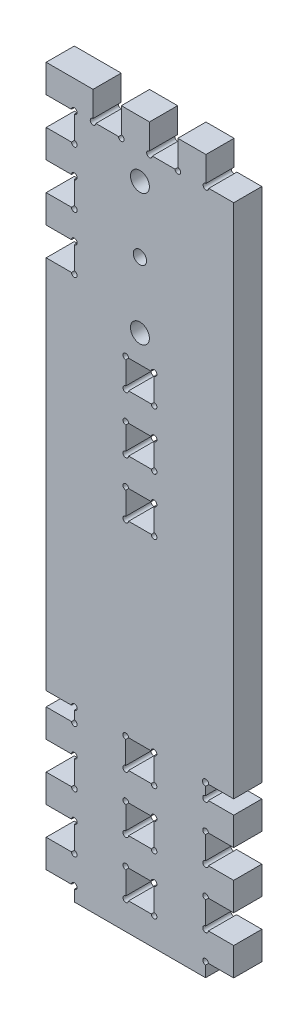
ISO-10303-21;
HEADER;
FILE_DESCRIPTION(('STEP AP214'),'2;1');
FILE_NAME('part.step','',(''),(''),'','','');
FILE_SCHEMA(('AUTOMOTIVE_DESIGN { 1 0 10303 214 1 1 1 1 }'));
ENDSEC;
DATA;
#1=APPLICATION_CONTEXT('core data for automotive mechanical design processes');
#2=APPLICATION_PROTOCOL_DEFINITION('international standard','automotive_design',2000,#1);
#3=PRODUCT_CONTEXT('',#1,'mechanical');
#4=PRODUCT('Part','Part','',(#3));
#5=PRODUCT_RELATED_PRODUCT_CATEGORY('part','',(#4));
#6=PRODUCT_DEFINITION_FORMATION('','',#4);
#7=PRODUCT_DEFINITION_CONTEXT('part definition',#1,'design');
#8=PRODUCT_DEFINITION('design','',#6,#7);
#9=PRODUCT_DEFINITION_SHAPE('','',#8);
#10=(LENGTH_UNIT() NAMED_UNIT(*) SI_UNIT(.MILLI.,.METRE.));
#11=(NAMED_UNIT(*) PLANE_ANGLE_UNIT() SI_UNIT($,.RADIAN.));
#12=(NAMED_UNIT(*) SI_UNIT($,.STERADIAN.) SOLID_ANGLE_UNIT());
#13=UNCERTAINTY_MEASURE_WITH_UNIT(LENGTH_MEASURE(1.E-05),#10,'distance_accuracy_value','');
#14=(GEOMETRIC_REPRESENTATION_CONTEXT(3) GLOBAL_UNCERTAINTY_ASSIGNED_CONTEXT((#13)) GLOBAL_UNIT_ASSIGNED_CONTEXT((#10,
#11,#12)) REPRESENTATION_CONTEXT('',''));
#15=CARTESIAN_POINT('',(0.,0.,0.));
#16=DIRECTION('',(0.,0.,1.));
#17=DIRECTION('',(1.,0.,0.));
#18=AXIS2_PLACEMENT_3D('',#15,#16,#17);
#19=CARTESIAN_POINT('',(15.,82.6,15.));
#20=DIRECTION('',(0.,0.,1.));
#21=DIRECTION('',(1.,0.,0.));
#22=AXIS2_PLACEMENT_3D('',#19,#20,#21);
#23=PLANE('',#22);
#24=CARTESIAN_POINT('',(50.,280.270539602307,15.));
#25=DIRECTION('',(0.,0.,1.));
#26=DIRECTION('',(1.,0.,0.));
#27=AXIS2_PLACEMENT_3D('',#24,#25,#26);
#28=CIRCLE('',#27,5.05000000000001);
#29=CARTESIAN_POINT('',(55.05,280.270539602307,15.));
#30=VERTEX_POINT('',#29);
#31=EDGE_CURVE('E3298',#30,#30,#28,.T.);
#32=ORIENTED_EDGE('',*,*,#31,.F.);
#33=EDGE_LOOP('',(#32));
#34=FACE_BOUND('',#33,.T.);
#35=CARTESIAN_POINT('',(50.,350.270539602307,15.));
#36=DIRECTION('',(0.,0.,1.));
#37=DIRECTION('',(1.,0.,0.));
#38=AXIS2_PLACEMENT_3D('',#35,#36,#37);
#39=CIRCLE('',#38,5.05000000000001);
#40=CARTESIAN_POINT('',(55.05,350.270539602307,15.));
#41=VERTEX_POINT('',#40);
#42=EDGE_CURVE('E1800',#41,#41,#39,.T.);
#43=ORIENTED_EDGE('',*,*,#42,.F.);
#44=EDGE_LOOP('',(#43));
#45=FACE_BOUND('',#44,.T.);
#46=DIRECTION('',(1.,0.,0.));
#47=VECTOR('',#46,1.);
#48=CARTESIAN_POINT('',(0.,45.1,15.));
#49=LINE('',#48,#47);
#50=CARTESIAN_POINT('',(43.9560876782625,45.1,15.));
#51=VERTEX_POINT('',#50);
#52=CARTESIAN_POINT('',(56.0560876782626,45.1,15.));
#53=VERTEX_POINT('',#52);
#54=EDGE_CURVE('E922',#51,#53,#49,.T.);
#55=ORIENTED_EDGE('',*,*,#54,.F.);
#56=CARTESIAN_POINT('',(42.4560876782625,45.1,15.));
#57=DIRECTION('',(0.,0.,1.));
#58=DIRECTION('',(1.,0.,0.));
#59=AXIS2_PLACEMENT_3D('',#56,#57,#58);
#60=CIRCLE('',#59,1.5);
#61=CARTESIAN_POINT('',(42.4560876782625,46.6,15.));
#62=VERTEX_POINT('',#61);
#63=EDGE_CURVE('E925',#51,#62,#60,.F.);
#64=ORIENTED_EDGE('',*,*,#63,.T.);
#65=DIRECTION('',(0.,-1.,0.));
#66=VECTOR('',#65,1.);
#67=CARTESIAN_POINT('',(42.4560876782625,0.,15.));
#68=LINE('',#67,#66);
#69=CARTESIAN_POINT('',(42.4560876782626,58.7,15.));
#70=VERTEX_POINT('',#69);
#71=EDGE_CURVE('E893',#70,#62,#68,.T.);
#72=ORIENTED_EDGE('',*,*,#71,.F.);
#73=CARTESIAN_POINT('',(42.4560876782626,60.2,15.));
#74=DIRECTION('',(0.,0.,1.));
#75=DIRECTION('',(1.,0.,0.));
#76=AXIS2_PLACEMENT_3D('',#73,#74,#75);
#77=CIRCLE('',#76,1.5);
#78=CARTESIAN_POINT('',(43.9560876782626,60.2,15.));
#79=VERTEX_POINT('',#78);
#80=EDGE_CURVE('E907',#70,#79,#77,.F.);
#81=ORIENTED_EDGE('',*,*,#80,.T.);
#82=DIRECTION('',(1.,0.,0.));
#83=VECTOR('',#82,1.);
#84=CARTESIAN_POINT('',(0.,60.2,15.));
#85=LINE('',#84,#83);
#86=CARTESIAN_POINT('',(56.0560876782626,60.2,15.));
#87=VERTEX_POINT('',#86);
#88=EDGE_CURVE('E910',#79,#87,#85,.T.);
#89=ORIENTED_EDGE('',*,*,#88,.T.);
#90=CARTESIAN_POINT('',(57.5560876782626,60.2,15.));
#91=DIRECTION('',(0.,0.,1.));
#92=DIRECTION('',(1.,0.,0.));
#93=AXIS2_PLACEMENT_3D('',#90,#91,#92);
#94=CIRCLE('',#93,1.5);
#95=CARTESIAN_POINT('',(57.5560876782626,58.7,15.));
#96=VERTEX_POINT('',#95);
#97=EDGE_CURVE('E913',#87,#96,#94,.F.);
#98=ORIENTED_EDGE('',*,*,#97,.T.);
#99=DIRECTION('',(0.,1.,0.));
#100=VECTOR('',#99,1.);
#101=CARTESIAN_POINT('',(57.5560876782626,0.,15.));
#102=LINE('',#101,#100);
#103=CARTESIAN_POINT('',(57.5560876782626,46.6,15.));
#104=VERTEX_POINT('',#103);
#105=EDGE_CURVE('E916',#104,#96,#102,.T.);
#106=ORIENTED_EDGE('',*,*,#105,.F.);
#107=CARTESIAN_POINT('',(57.5560876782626,45.1,15.));
#108=DIRECTION('',(0.,0.,1.));
#109=DIRECTION('',(1.,0.,0.));
#110=AXIS2_PLACEMENT_3D('',#107,#108,#109);
#111=CIRCLE('',#110,1.5);
#112=EDGE_CURVE('E919',#53,#104,#111,.T.);
#113=ORIENTED_EDGE('',*,*,#112,.F.);
#114=EDGE_LOOP('',(#55,#64,#72,#81,#89,#98,#106,#113));
#115=FACE_BOUND('',#114,.T.);
#116=CARTESIAN_POINT('',(42.4500000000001,235.5,15.));
#117=DIRECTION('',(0.,0.,1.));
#118=DIRECTION('',(1.,0.,0.));
#119=AXIS2_PLACEMENT_3D('',#116,#117,#118);
#120=CIRCLE('',#119,1.5);
#121=CARTESIAN_POINT('',(42.45,234.,15.));
#122=VERTEX_POINT('',#121);
#123=CARTESIAN_POINT('',(43.9500000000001,235.5,15.));
#124=VERTEX_POINT('',#123);
#125=EDGE_CURVE('E1041',#122,#124,#120,.F.);
#126=ORIENTED_EDGE('',*,*,#125,.T.);
#127=DIRECTION('',(1.,0.,0.));
#128=VECTOR('',#127,1.);
#129=CARTESIAN_POINT('',(0.,235.5,15.));
#130=LINE('',#129,#128);
#131=CARTESIAN_POINT('',(56.0983230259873,235.5,15.));
#132=VERTEX_POINT('',#131);
#133=EDGE_CURVE('E1044',#124,#132,#130,.T.);
#134=ORIENTED_EDGE('',*,*,#133,.T.);
#135=CARTESIAN_POINT('',(57.597568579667,235.452431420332,15.));
#136=DIRECTION('',(0.,0.,1.));
#137=DIRECTION('',(1.,0.,0.));
#138=AXIS2_PLACEMENT_3D('',#135,#136,#137);
#139=CIRCLE('',#138,1.49999999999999);
#140=CARTESIAN_POINT('',(57.5499999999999,233.953185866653,15.));
#141=VERTEX_POINT('',#140);
#142=EDGE_CURVE('E1047',#132,#141,#139,.F.);
#143=ORIENTED_EDGE('',*,*,#142,.T.);
#144=DIRECTION('',(0.,1.,0.));
#145=VECTOR('',#144,1.);
#146=CARTESIAN_POINT('',(57.5499999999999,0.,15.));
#147=LINE('',#146,#145);
#148=CARTESIAN_POINT('',(57.5499999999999,221.9,15.));
#149=VERTEX_POINT('',#148);
#150=EDGE_CURVE('E1012',#149,#141,#147,.T.);
#151=ORIENTED_EDGE('',*,*,#150,.F.);
#152=CARTESIAN_POINT('',(57.55,220.4,15.));
#153=DIRECTION('',(0.,0.,1.));
#154=DIRECTION('',(1.,0.,0.));
#155=AXIS2_PLACEMENT_3D('',#152,#153,#154);
#156=CIRCLE('',#155,1.49999999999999);
#157=CARTESIAN_POINT('',(56.05,220.4,15.));
#158=VERTEX_POINT('',#157);
#159=EDGE_CURVE('E1029',#158,#149,#156,.T.);
#160=ORIENTED_EDGE('',*,*,#159,.F.);
#161=DIRECTION('',(1.,0.,0.));
#162=VECTOR('',#161,1.);
#163=CARTESIAN_POINT('',(0.,220.4,15.));
#164=LINE('',#163,#162);
#165=CARTESIAN_POINT('',(43.95,220.4,15.));
#166=VERTEX_POINT('',#165);
#167=EDGE_CURVE('E1032',#166,#158,#164,.T.);
#168=ORIENTED_EDGE('',*,*,#167,.F.);
#169=CARTESIAN_POINT('',(42.45,220.4,15.));
#170=DIRECTION('',(0.,0.,1.));
#171=DIRECTION('',(1.,0.,0.));
#172=AXIS2_PLACEMENT_3D('',#169,#170,#171);
#173=CIRCLE('',#172,1.5);
#174=CARTESIAN_POINT('',(42.45,221.9,15.));
#175=VERTEX_POINT('',#174);
#176=EDGE_CURVE('E1035',#166,#175,#173,.F.);
#177=ORIENTED_EDGE('',*,*,#176,.T.);
#178=DIRECTION('',(0.,-1.,0.));
#179=VECTOR('',#178,1.);
#180=CARTESIAN_POINT('',(42.4500000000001,0.,15.));
#181=LINE('',#180,#179);
#182=EDGE_CURVE('E1038',#122,#175,#181,.T.);
#183=ORIENTED_EDGE('',*,*,#182,.F.);
#184=EDGE_LOOP('',(#126,#134,#143,#151,#160,#168,#177,#183));
#185=FACE_BOUND('',#184,.T.);
#186=CARTESIAN_POINT('',(15.,82.6,15.));
#187=DIRECTION('',(0.,0.,-1.));
#188=DIRECTION('',(1.,0.,0.));
#189=AXIS2_PLACEMENT_3D('',#186,#187,#188);
#190=CIRCLE('',#189,1.5);
#191=CARTESIAN_POINT('',(15.,84.1,15.));
#192=VERTEX_POINT('',#191);
#193=CARTESIAN_POINT('',(13.5,82.6,15.));
#194=VERTEX_POINT('',#193);
#195=EDGE_CURVE('E1098',#192,#194,#190,.T.);
#196=ORIENTED_EDGE('',*,*,#195,.T.);
#197=DIRECTION('',(-1.,0.,0.));
#198=VECTOR('',#197,1.);
#199=CARTESIAN_POINT('',(0.,82.6,15.));
#200=LINE('',#199,#198);
#201=CARTESIAN_POINT('',(0.,82.6,15.));
#202=VERTEX_POINT('',#201);
#203=EDGE_CURVE('E1101',#194,#202,#200,.T.);
#204=ORIENTED_EDGE('',*,*,#203,.T.);
#205=DIRECTION('',(0.,-1.,0.));
#206=VECTOR('',#205,1.);
#207=CARTESIAN_POINT('',(0.,82.6,15.));
#208=LINE('',#207,#206);
#209=CARTESIAN_POINT('',(0.,67.6,15.));
#210=VERTEX_POINT('',#209);
#211=EDGE_CURVE('E1104',#202,#210,#208,.T.);
#212=ORIENTED_EDGE('',*,*,#211,.T.);
#213=DIRECTION('',(1.,0.,0.));
#214=VECTOR('',#213,1.);
#215=CARTESIAN_POINT('',(0.,67.6,15.));
#216=LINE('',#215,#214);
#217=CARTESIAN_POINT('',(13.5,67.6,15.));
#218=VERTEX_POINT('',#217);
#219=EDGE_CURVE('E1106',#210,#218,#216,.T.);
#220=ORIENTED_EDGE('',*,*,#219,.T.);
#221=CARTESIAN_POINT('',(15.,67.6,15.));
#222=DIRECTION('',(0.,0.,-1.));
#223=DIRECTION('',(-1.,0.,0.));
#224=AXIS2_PLACEMENT_3D('',#221,#222,#223);
#225=CIRCLE('',#224,1.5);
#226=CARTESIAN_POINT('',(15.,66.1,15.));
#227=VERTEX_POINT('',#226);
#228=EDGE_CURVE('E1108',#218,#227,#225,.T.);
#229=ORIENTED_EDGE('',*,*,#228,.T.);
#230=DIRECTION('',(0.,-1.,0.));
#231=VECTOR('',#230,1.);
#232=CARTESIAN_POINT('',(15.,66.1,15.));
#233=LINE('',#232,#231);
#234=CARTESIAN_POINT('',(15.,54.,15.));
#235=VERTEX_POINT('',#234);
#236=EDGE_CURVE('E1110',#227,#235,#233,.T.);
#237=ORIENTED_EDGE('',*,*,#236,.T.);
#238=CARTESIAN_POINT('',(15.,52.5,15.));
#239=DIRECTION('',(0.,0.,-1.));
#240=DIRECTION('',(-1.,0.,0.));
#241=AXIS2_PLACEMENT_3D('',#238,#239,#240);
#242=CIRCLE('',#241,1.5);
#243=CARTESIAN_POINT('',(13.5,52.5,15.));
#244=VERTEX_POINT('',#243);
#245=EDGE_CURVE('E1112',#235,#244,#242,.T.);
#246=ORIENTED_EDGE('',*,*,#245,.T.);
#247=DIRECTION('',(-1.,0.,0.));
#248=VECTOR('',#247,1.);
#249=CARTESIAN_POINT('',(13.5,52.5,15.));
#250=LINE('',#249,#248);
#251=CARTESIAN_POINT('',(0.,52.5,15.));
#252=VERTEX_POINT('',#251);
#253=EDGE_CURVE('E1114',#244,#252,#250,.T.);
#254=ORIENTED_EDGE('',*,*,#253,.T.);
#255=DIRECTION('',(0.,-1.,0.));
#256=VECTOR('',#255,1.);
#257=CARTESIAN_POINT('',(0.,52.5,15.));
#258=LINE('',#257,#256);
#259=CARTESIAN_POINT('',(0.,37.5,15.));
#260=VERTEX_POINT('',#259);
#261=EDGE_CURVE('E1116',#252,#260,#258,.T.);
#262=ORIENTED_EDGE('',*,*,#261,.T.);
#263=DIRECTION('',(1.,0.,0.));
#264=VECTOR('',#263,1.);
#265=CARTESIAN_POINT('',(0.,37.5,15.));
#266=LINE('',#265,#264);
#267=CARTESIAN_POINT('',(13.5,37.5,15.));
#268=VERTEX_POINT('',#267);
#269=EDGE_CURVE('E1118',#260,#268,#266,.T.);
#270=ORIENTED_EDGE('',*,*,#269,.T.);
#271=CARTESIAN_POINT('',(15.,37.5,15.));
#272=DIRECTION('',(0.,0.,-1.));
#273=DIRECTION('',(-1.,0.,0.));
#274=AXIS2_PLACEMENT_3D('',#271,#272,#273);
#275=CIRCLE('',#274,1.5);
#276=CARTESIAN_POINT('',(15.,36.,15.));
#277=VERTEX_POINT('',#276);
#278=EDGE_CURVE('E1120',#268,#277,#275,.T.);
#279=ORIENTED_EDGE('',*,*,#278,.T.);
#280=DIRECTION('',(0.,-1.,0.));
#281=VECTOR('',#280,1.);
#282=CARTESIAN_POINT('',(15.,36.,15.));
#283=LINE('',#282,#281);
#284=CARTESIAN_POINT('',(15.,23.9,15.));
#285=VERTEX_POINT('',#284);
#286=EDGE_CURVE('E1122',#277,#285,#283,.T.);
#287=ORIENTED_EDGE('',*,*,#286,.T.);
#288=CARTESIAN_POINT('',(15.,22.4,15.));
#289=DIRECTION('',(0.,0.,-1.));
#290=DIRECTION('',(-1.,0.,0.));
#291=AXIS2_PLACEMENT_3D('',#288,#289,#290);
#292=CIRCLE('',#291,1.49999999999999);
#293=CARTESIAN_POINT('',(13.5,22.4,15.));
#294=VERTEX_POINT('',#293);
#295=EDGE_CURVE('E1124',#285,#294,#292,.T.);
#296=ORIENTED_EDGE('',*,*,#295,.T.);
#297=DIRECTION('',(-1.,0.,0.));
#298=VECTOR('',#297,1.);
#299=CARTESIAN_POINT('',(13.5,22.4,15.));
#300=LINE('',#299,#298);
#301=CARTESIAN_POINT('',(0.,22.4,15.));
#302=VERTEX_POINT('',#301);
#303=EDGE_CURVE('E1126',#294,#302,#300,.T.);
#304=ORIENTED_EDGE('',*,*,#303,.T.);
#305=DIRECTION('',(0.,-1.,0.));
#306=VECTOR('',#305,1.);
#307=CARTESIAN_POINT('',(0.,22.4,15.));
#308=LINE('',#307,#306);
#309=CARTESIAN_POINT('',(0.,7.4,15.));
#310=VERTEX_POINT('',#309);
#311=EDGE_CURVE('E1128',#302,#310,#308,.T.);
#312=ORIENTED_EDGE('',*,*,#311,.T.);
#313=DIRECTION('',(1.,0.,0.));
#314=VECTOR('',#313,1.);
#315=CARTESIAN_POINT('',(0.,7.4,15.));
#316=LINE('',#315,#314);
#317=CARTESIAN_POINT('',(13.5,7.4,15.));
#318=VERTEX_POINT('',#317);
#319=EDGE_CURVE('E1130',#310,#318,#316,.T.);
#320=ORIENTED_EDGE('',*,*,#319,.T.);
#321=CARTESIAN_POINT('',(15.,7.4,15.));
#322=DIRECTION('',(0.,0.,-1.));
#323=DIRECTION('',(-1.,0.,0.));
#324=AXIS2_PLACEMENT_3D('',#321,#322,#323);
#325=CIRCLE('',#324,1.5);
#326=CARTESIAN_POINT('',(15.,5.9,15.));
#327=VERTEX_POINT('',#326);
#328=EDGE_CURVE('E1132',#318,#327,#325,.T.);
#329=ORIENTED_EDGE('',*,*,#328,.T.);
#330=DIRECTION('',(0.,-1.,0.));
#331=VECTOR('',#330,1.);
#332=CARTESIAN_POINT('',(15.,5.9,15.));
#333=LINE('',#332,#331);
#334=CARTESIAN_POINT('',(15.,0.,15.));
#335=VERTEX_POINT('',#334);
#336=EDGE_CURVE('E1134',#327,#335,#333,.T.);
#337=ORIENTED_EDGE('',*,*,#336,.T.);
#338=DIRECTION('',(1.,0.,0.));
#339=VECTOR('',#338,1.);
#340=CARTESIAN_POINT('',(85.,0.,15.));
#341=LINE('',#340,#339);
#342=CARTESIAN_POINT('',(85.,0.,15.));
#343=VERTEX_POINT('',#342);
#344=EDGE_CURVE('E1136',#335,#343,#341,.T.);
#345=ORIENTED_EDGE('',*,*,#344,.T.);
#346=DIRECTION('',(0.,1.,0.));
#347=VECTOR('',#346,1.);
#348=CARTESIAN_POINT('',(85.,5.89999999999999,15.));
#349=LINE('',#348,#347);
#350=CARTESIAN_POINT('',(85.,5.89999999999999,15.));
#351=VERTEX_POINT('',#350);
#352=EDGE_CURVE('E1138',#343,#351,#349,.T.);
#353=ORIENTED_EDGE('',*,*,#352,.T.);
#354=CARTESIAN_POINT('',(85.,7.4,15.));
#355=DIRECTION('',(0.,0.,-1.));
#356=DIRECTION('',(1.,0.,0.));
#357=AXIS2_PLACEMENT_3D('',#354,#355,#356);
#358=CIRCLE('',#357,1.5);
#359=CARTESIAN_POINT('',(86.5,7.39999999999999,15.));
#360=VERTEX_POINT('',#359);
#361=EDGE_CURVE('E1140',#351,#360,#358,.T.);
#362=ORIENTED_EDGE('',*,*,#361,.T.);
#363=DIRECTION('',(1.,0.,0.));
#364=VECTOR('',#363,1.);
#365=CARTESIAN_POINT('',(100.,7.4,15.));
#366=LINE('',#365,#364);
#367=CARTESIAN_POINT('',(100.,7.4,15.));
#368=VERTEX_POINT('',#367);
#369=EDGE_CURVE('E1142',#360,#368,#366,.T.);
#370=ORIENTED_EDGE('',*,*,#369,.T.);
#371=DIRECTION('',(0.,1.,0.));
#372=VECTOR('',#371,1.);
#373=CARTESIAN_POINT('',(100.,22.4,15.));
#374=LINE('',#373,#372);
#375=CARTESIAN_POINT('',(100.,22.4,15.));
#376=VERTEX_POINT('',#375);
#377=EDGE_CURVE('E1144',#368,#376,#374,.T.);
#378=ORIENTED_EDGE('',*,*,#377,.T.);
#379=DIRECTION('',(-1.,0.,0.));
#380=VECTOR('',#379,1.);
#381=CARTESIAN_POINT('',(86.5,22.4,15.));
#382=LINE('',#381,#380);
#383=CARTESIAN_POINT('',(86.5,22.4,15.));
#384=VERTEX_POINT('',#383);
#385=EDGE_CURVE('E1146',#376,#384,#382,.T.);
#386=ORIENTED_EDGE('',*,*,#385,.T.);
#387=CARTESIAN_POINT('',(85.,22.4,15.));
#388=DIRECTION('',(0.,0.,-1.));
#389=DIRECTION('',(1.,0.,0.));
#390=AXIS2_PLACEMENT_3D('',#387,#388,#389);
#391=CIRCLE('',#390,1.5);
#392=CARTESIAN_POINT('',(85.,23.9,15.));
#393=VERTEX_POINT('',#392);
#394=EDGE_CURVE('E1148',#384,#393,#391,.T.);
#395=ORIENTED_EDGE('',*,*,#394,.T.);
#396=DIRECTION('',(0.,1.,0.));
#397=VECTOR('',#396,1.);
#398=CARTESIAN_POINT('',(85.,36.,15.));
#399=LINE('',#398,#397);
#400=CARTESIAN_POINT('',(85.,36.,15.));
#401=VERTEX_POINT('',#400);
#402=EDGE_CURVE('E1150',#393,#401,#399,.T.);
#403=ORIENTED_EDGE('',*,*,#402,.T.);
#404=CARTESIAN_POINT('',(85.,37.5,15.));
#405=DIRECTION('',(0.,0.,-1.));
#406=DIRECTION('',(1.,0.,0.));
#407=AXIS2_PLACEMENT_3D('',#404,#405,#406);
#408=CIRCLE('',#407,1.5);
#409=CARTESIAN_POINT('',(86.5,37.5,15.));
#410=VERTEX_POINT('',#409);
#411=EDGE_CURVE('E1152',#401,#410,#408,.T.);
#412=ORIENTED_EDGE('',*,*,#411,.T.);
#413=DIRECTION('',(1.,0.,0.));
#414=VECTOR('',#413,1.);
#415=CARTESIAN_POINT('',(100.,37.5,15.));
#416=LINE('',#415,#414);
#417=CARTESIAN_POINT('',(100.,37.5,15.));
#418=VERTEX_POINT('',#417);
#419=EDGE_CURVE('E1154',#410,#418,#416,.T.);
#420=ORIENTED_EDGE('',*,*,#419,.T.);
#421=DIRECTION('',(0.,1.,0.));
#422=VECTOR('',#421,1.);
#423=CARTESIAN_POINT('',(100.,52.5,15.));
#424=LINE('',#423,#422);
#425=CARTESIAN_POINT('',(100.,52.5,15.));
#426=VERTEX_POINT('',#425);
#427=EDGE_CURVE('E1156',#418,#426,#424,.T.);
#428=ORIENTED_EDGE('',*,*,#427,.T.);
#429=DIRECTION('',(-1.,0.,0.));
#430=VECTOR('',#429,1.);
#431=CARTESIAN_POINT('',(86.5,52.5,15.));
#432=LINE('',#431,#430);
#433=CARTESIAN_POINT('',(86.5,52.5,15.));
#434=VERTEX_POINT('',#433);
#435=EDGE_CURVE('E1158',#426,#434,#432,.T.);
#436=ORIENTED_EDGE('',*,*,#435,.T.);
#437=CARTESIAN_POINT('',(85.,52.5,15.));
#438=DIRECTION('',(0.,0.,-1.));
#439=DIRECTION('',(1.,0.,0.));
#440=AXIS2_PLACEMENT_3D('',#437,#438,#439);
#441=CIRCLE('',#440,1.5);
#442=CARTESIAN_POINT('',(85.,54.,15.));
#443=VERTEX_POINT('',#442);
#444=EDGE_CURVE('E1160',#434,#443,#441,.T.);
#445=ORIENTED_EDGE('',*,*,#444,.T.);
#446=DIRECTION('',(0.,1.,0.));
#447=VECTOR('',#446,1.);
#448=CARTESIAN_POINT('',(85.,66.1,15.));
#449=LINE('',#448,#447);
#450=CARTESIAN_POINT('',(85.,66.1,15.));
#451=VERTEX_POINT('',#450);
#452=EDGE_CURVE('E1162',#443,#451,#449,.T.);
#453=ORIENTED_EDGE('',*,*,#452,.T.);
#454=CARTESIAN_POINT('',(85.,67.6,15.));
#455=DIRECTION('',(0.,0.,-1.));
#456=DIRECTION('',(1.,0.,0.));
#457=AXIS2_PLACEMENT_3D('',#454,#455,#456);
#458=CIRCLE('',#457,1.5);
#459=CARTESIAN_POINT('',(86.5,67.6,15.));
#460=VERTEX_POINT('',#459);
#461=EDGE_CURVE('E1164',#451,#460,#458,.T.);
#462=ORIENTED_EDGE('',*,*,#461,.T.);
#463=DIRECTION('',(1.,0.,0.));
#464=VECTOR('',#463,1.);
#465=CARTESIAN_POINT('',(100.,67.6,15.));
#466=LINE('',#465,#464);
#467=CARTESIAN_POINT('',(100.,67.6,15.));
#468=VERTEX_POINT('',#467);
#469=EDGE_CURVE('E1166',#460,#468,#466,.T.);
#470=ORIENTED_EDGE('',*,*,#469,.T.);
#471=DIRECTION('',(0.,1.,0.));
#472=VECTOR('',#471,1.);
#473=CARTESIAN_POINT('',(100.,82.6,15.));
#474=LINE('',#473,#472);
#475=CARTESIAN_POINT('',(100.,82.6,15.));
#476=VERTEX_POINT('',#475);
#477=EDGE_CURVE('E1168',#468,#476,#474,.T.);
#478=ORIENTED_EDGE('',*,*,#477,.T.);
#479=DIRECTION('',(-1.,0.,0.));
#480=VECTOR('',#479,1.);
#481=CARTESIAN_POINT('',(86.5,82.6,15.));
#482=LINE('',#481,#480);
#483=CARTESIAN_POINT('',(86.5,82.6,15.));
#484=VERTEX_POINT('',#483);
#485=EDGE_CURVE('E1170',#476,#484,#482,.T.);
#486=ORIENTED_EDGE('',*,*,#485,.T.);
#487=CARTESIAN_POINT('',(85.,82.6,15.));
#488=DIRECTION('',(0.,0.,-1.));
#489=DIRECTION('',(1.,0.,0.));
#490=AXIS2_PLACEMENT_3D('',#487,#488,#489);
#491=CIRCLE('',#490,1.5);
#492=CARTESIAN_POINT('',(85.,84.1,15.));
#493=VERTEX_POINT('',#492);
#494=EDGE_CURVE('E1172',#484,#493,#491,.T.);
#495=ORIENTED_EDGE('',*,*,#494,.T.);
#496=DIRECTION('',(0.,1.,0.));
#497=VECTOR('',#496,1.);
#498=CARTESIAN_POINT('',(85.,88.4,15.));
#499=LINE('',#498,#497);
#500=CARTESIAN_POINT('',(85.,88.4,15.));
#501=VERTEX_POINT('',#500);
#502=EDGE_CURVE('E1174',#493,#501,#499,.T.);
#503=ORIENTED_EDGE('',*,*,#502,.T.);
#504=CARTESIAN_POINT('',(85.,90.1,15.));
#505=DIRECTION('',(0.,0.,-1.));
#506=DIRECTION('',(1.,0.,0.));
#507=AXIS2_PLACEMENT_3D('',#504,#505,#506);
#508=CIRCLE('',#507,1.69999999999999);
#509=CARTESIAN_POINT('',(86.7,90.1,15.));
#510=VERTEX_POINT('',#509);
#511=EDGE_CURVE('E1176',#501,#510,#508,.T.);
#512=ORIENTED_EDGE('',*,*,#511,.T.);
#513=DIRECTION('',(1.,0.,0.));
#514=VECTOR('',#513,1.);
#515=CARTESIAN_POINT('',(86.7,90.1,15.));
#516=LINE('',#515,#514);
#517=CARTESIAN_POINT('',(100.,90.1,15.));
#518=VERTEX_POINT('',#517);
#519=EDGE_CURVE('E1178',#510,#518,#516,.T.);
#520=ORIENTED_EDGE('',*,*,#519,.T.);
#521=DIRECTION('',(0.,1.,0.));
#522=VECTOR('',#521,1.);
#523=CARTESIAN_POINT('',(100.,90.1,15.));
#524=LINE('',#523,#522);
#525=CARTESIAN_POINT('',(100.,365.4,15.));
#526=VERTEX_POINT('',#525);
#527=EDGE_CURVE('E1180',#518,#526,#524,.T.);
#528=ORIENTED_EDGE('',*,*,#527,.T.);
#529=DIRECTION('',(-1.,0.,0.));
#530=VECTOR('',#529,1.);
#531=CARTESIAN_POINT('',(86.7,365.4,15.));
#532=LINE('',#531,#530);
#533=CARTESIAN_POINT('',(86.7,365.4,15.));
#534=VERTEX_POINT('',#533);
#535=EDGE_CURVE('E1182',#526,#534,#532,.T.);
#536=ORIENTED_EDGE('',*,*,#535,.T.);
#537=CARTESIAN_POINT('',(85.2,365.4,15.));
#538=DIRECTION('',(0.,0.,-1.));
#539=DIRECTION('',(1.,0.,0.));
#540=AXIS2_PLACEMENT_3D('',#537,#538,#539);
#541=CIRCLE('',#540,1.5);
#542=CARTESIAN_POINT('',(85.2,366.9,15.));
#543=VERTEX_POINT('',#542);
#544=EDGE_CURVE('E1184',#534,#543,#541,.T.);
#545=ORIENTED_EDGE('',*,*,#544,.T.);
#546=DIRECTION('',(0.,1.,0.));
#547=VECTOR('',#546,1.);
#548=CARTESIAN_POINT('',(85.2,380.270539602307,15.));
#549=LINE('',#548,#547);
#550=CARTESIAN_POINT('',(85.2,380.270539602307,15.));
#551=VERTEX_POINT('',#550);
#552=EDGE_CURVE('E1186',#543,#551,#549,.T.);
#553=ORIENTED_EDGE('',*,*,#552,.T.);
#554=DIRECTION('',(-1.,0.,0.));
#555=VECTOR('',#554,1.);
#556=CARTESIAN_POINT('',(70.2,380.270539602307,15.));
#557=LINE('',#556,#555);
#558=CARTESIAN_POINT('',(70.2,380.270539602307,15.));
#559=VERTEX_POINT('',#558);
#560=EDGE_CURVE('E1188',#551,#559,#557,.T.);
#561=ORIENTED_EDGE('',*,*,#560,.T.);
#562=DIRECTION('',(0.,-1.,0.));
#563=VECTOR('',#562,1.);
#564=CARTESIAN_POINT('',(70.2,366.770539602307,15.));
#565=LINE('',#564,#563);
#566=CARTESIAN_POINT('',(70.2,366.770539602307,15.));
#567=VERTEX_POINT('',#566);
#568=EDGE_CURVE('E1190',#559,#567,#565,.T.);
#569=ORIENTED_EDGE('',*,*,#568,.T.);
#570=CARTESIAN_POINT('',(70.2,365.270539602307,15.));
#571=DIRECTION('',(0.,0.,-1.));
#572=DIRECTION('',(1.,0.,0.));
#573=AXIS2_PLACEMENT_3D('',#570,#571,#572);
#574=CIRCLE('',#573,1.5);
#575=CARTESIAN_POINT('',(68.7,365.270539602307,15.));
#576=VERTEX_POINT('',#575);
#577=EDGE_CURVE('E1192',#567,#576,#574,.T.);
#578=ORIENTED_EDGE('',*,*,#577,.T.);
#579=DIRECTION('',(-1.,0.,0.));
#580=VECTOR('',#579,1.);
#581=CARTESIAN_POINT('',(56.6,365.270539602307,15.));
#582=LINE('',#581,#580);
#583=CARTESIAN_POINT('',(56.6,365.270539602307,15.));
#584=VERTEX_POINT('',#583);
#585=EDGE_CURVE('E1194',#576,#584,#582,.T.);
#586=ORIENTED_EDGE('',*,*,#585,.T.);
#587=CARTESIAN_POINT('',(55.1,365.270539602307,15.));
#588=DIRECTION('',(0.,0.,-1.));
#589=DIRECTION('',(1.,0.,0.));
#590=AXIS2_PLACEMENT_3D('',#587,#588,#589);
#591=CIRCLE('',#590,1.50000000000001);
#592=CARTESIAN_POINT('',(54.968914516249,366.764800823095,15.));
#593=VERTEX_POINT('',#592);
#594=EDGE_CURVE('E1196',#584,#593,#591,.T.);
#595=ORIENTED_EDGE('',*,*,#594,.T.);
#596=DIRECTION('',(0.00970545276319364,0.999952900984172,0.));
#597=VECTOR('',#596,1.);
#598=CARTESIAN_POINT('',(55.1,380.270539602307,15.));
#599=LINE('',#598,#597);
#600=CARTESIAN_POINT('',(55.1,380.270539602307,15.));
#601=VERTEX_POINT('',#600);
#602=EDGE_CURVE('E1198',#593,#601,#599,.T.);
#603=ORIENTED_EDGE('',*,*,#602,.T.);
#604=DIRECTION('',(-1.,0.,0.));
#605=VECTOR('',#604,1.);
#606=CARTESIAN_POINT('',(40.1,380.270539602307,15.));
#607=LINE('',#606,#605);
#608=CARTESIAN_POINT('',(40.1,380.270539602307,15.));
#609=VERTEX_POINT('',#608);
#610=EDGE_CURVE('E1200',#601,#609,#607,.T.);
#611=ORIENTED_EDGE('',*,*,#610,.T.);
#612=DIRECTION('',(0.,-1.,0.));
#613=VECTOR('',#612,1.);
#614=CARTESIAN_POINT('',(40.1,366.770543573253,15.));
#615=LINE('',#614,#613);
#616=CARTESIAN_POINT('',(40.1,366.770543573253,15.));
#617=VERTEX_POINT('',#616);
#618=EDGE_CURVE('E1202',#609,#617,#615,.T.);
#619=ORIENTED_EDGE('',*,*,#618,.T.);
#620=CARTESIAN_POINT('',(40.1,365.270543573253,15.));
#621=DIRECTION('',(0.,0.,-1.));
#622=DIRECTION('',(1.,0.,0.));
#623=AXIS2_PLACEMENT_3D('',#620,#621,#622);
#624=CIRCLE('',#623,1.5);
#625=CARTESIAN_POINT('',(38.6,365.270543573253,15.));
#626=VERTEX_POINT('',#625);
#627=EDGE_CURVE('E1204',#617,#626,#624,.T.);
#628=ORIENTED_EDGE('',*,*,#627,.T.);
#629=DIRECTION('',(-1.,0.,0.));
#630=VECTOR('',#629,1.);
#631=CARTESIAN_POINT('',(26.5,365.270543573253,15.));
#632=LINE('',#631,#630);
#633=CARTESIAN_POINT('',(26.5,365.270543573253,15.));
#634=VERTEX_POINT('',#633);
#635=EDGE_CURVE('E1206',#626,#634,#632,.T.);
#636=ORIENTED_EDGE('',*,*,#635,.T.);
#637=CARTESIAN_POINT('',(25.,365.270543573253,15.));
#638=DIRECTION('',(0.,0.,-1.));
#639=DIRECTION('',(1.,0.,0.));
#640=AXIS2_PLACEMENT_3D('',#637,#638,#639);
#641=CIRCLE('',#640,1.5);
#642=CARTESIAN_POINT('',(25.,366.770543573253,15.));
#643=VERTEX_POINT('',#642);
#644=EDGE_CURVE('E1208',#634,#643,#641,.T.);
#645=ORIENTED_EDGE('',*,*,#644,.T.);
#646=DIRECTION('',(0.,1.,0.));
#647=VECTOR('',#646,1.);
#648=CARTESIAN_POINT('',(25.,366.770543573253,15.));
#649=LINE('',#648,#647);
#650=CARTESIAN_POINT('',(25.,380.270539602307,15.));
#651=VERTEX_POINT('',#650);
#652=EDGE_CURVE('E1210',#643,#651,#649,.T.);
#653=ORIENTED_EDGE('',*,*,#652,.T.);
#654=DIRECTION('',(-1.,0.,0.));
#655=VECTOR('',#654,1.);
#656=CARTESIAN_POINT('',(0.,380.270539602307,15.));
#657=LINE('',#656,#655);
#658=CARTESIAN_POINT('',(0.,380.270539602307,15.));
#659=VERTEX_POINT('',#658);
#660=EDGE_CURVE('E1212',#651,#659,#657,.T.);
#661=ORIENTED_EDGE('',*,*,#660,.T.);
#662=DIRECTION('',(0.,-1.,0.));
#663=VECTOR('',#662,1.);
#664=CARTESIAN_POINT('',(0.,365.270539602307,15.));
#665=LINE('',#664,#663);
#666=CARTESIAN_POINT('',(0.,365.270539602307,15.));
#667=VERTEX_POINT('',#666);
#668=EDGE_CURVE('E1214',#659,#667,#665,.T.);
#669=ORIENTED_EDGE('',*,*,#668,.T.);
#670=DIRECTION('',(1.,0.,0.));
#671=VECTOR('',#670,1.);
#672=CARTESIAN_POINT('',(0.,365.270539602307,15.));
#673=LINE('',#672,#671);
#674=CARTESIAN_POINT('',(13.5,365.270539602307,15.));
#675=VERTEX_POINT('',#674);
#676=EDGE_CURVE('E1216',#667,#675,#673,.T.);
#677=ORIENTED_EDGE('',*,*,#676,.T.);
#678=CARTESIAN_POINT('',(15.,365.270539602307,15.));
#679=DIRECTION('',(0.,0.,-1.));
#680=DIRECTION('',(1.,0.,0.));
#681=AXIS2_PLACEMENT_3D('',#678,#679,#680);
#682=CIRCLE('',#681,1.5);
#683=CARTESIAN_POINT('',(15.,363.770539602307,15.));
#684=VERTEX_POINT('',#683);
#685=EDGE_CURVE('E1218',#675,#684,#682,.T.);
#686=ORIENTED_EDGE('',*,*,#685,.T.);
#687=DIRECTION('',(0.,-1.,0.));
#688=VECTOR('',#687,1.);
#689=CARTESIAN_POINT('',(15.,351.670539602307,15.));
#690=LINE('',#689,#688);
#691=CARTESIAN_POINT('',(15.,351.670539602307,15.));
#692=VERTEX_POINT('',#691);
#693=EDGE_CURVE('E1220',#684,#692,#690,.T.);
#694=ORIENTED_EDGE('',*,*,#693,.T.);
#695=CARTESIAN_POINT('',(15.,350.170539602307,15.));
#696=DIRECTION('',(0.,0.,-1.));
#697=DIRECTION('',(1.,0.,0.));
#698=AXIS2_PLACEMENT_3D('',#695,#696,#697);
#699=CIRCLE('',#698,1.5);
#700=CARTESIAN_POINT('',(13.5,350.170539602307,15.));
#701=VERTEX_POINT('',#700);
#702=EDGE_CURVE('E1222',#692,#701,#699,.T.);
#703=ORIENTED_EDGE('',*,*,#702,.T.);
#704=DIRECTION('',(-1.,0.,0.));
#705=VECTOR('',#704,1.);
#706=CARTESIAN_POINT('',(13.5,350.170539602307,15.));
#707=LINE('',#706,#705);
#708=CARTESIAN_POINT('',(0.,350.170539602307,15.));
#709=VERTEX_POINT('',#708);
#710=EDGE_CURVE('E1224',#701,#709,#707,.T.);
#711=ORIENTED_EDGE('',*,*,#710,.T.);
#712=DIRECTION('',(0.,-1.,0.));
#713=VECTOR('',#712,1.);
#714=CARTESIAN_POINT('',(0.,335.170539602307,15.));
#715=LINE('',#714,#713);
#716=CARTESIAN_POINT('',(0.,335.170539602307,15.));
#717=VERTEX_POINT('',#716);
#718=EDGE_CURVE('E1226',#709,#717,#715,.T.);
#719=ORIENTED_EDGE('',*,*,#718,.T.);
#720=DIRECTION('',(1.,0.,0.));
#721=VECTOR('',#720,1.);
#722=CARTESIAN_POINT('',(0.,335.170539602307,15.));
#723=LINE('',#722,#721);
#724=CARTESIAN_POINT('',(13.5,335.170539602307,15.));
#725=VERTEX_POINT('',#724);
#726=EDGE_CURVE('E1228',#717,#725,#723,.T.);
#727=ORIENTED_EDGE('',*,*,#726,.T.);
#728=CARTESIAN_POINT('',(15.,335.170539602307,15.));
#729=DIRECTION('',(0.,0.,-1.));
#730=DIRECTION('',(1.,0.,0.));
#731=AXIS2_PLACEMENT_3D('',#728,#729,#730);
#732=CIRCLE('',#731,1.5);
#733=CARTESIAN_POINT('',(15.,333.670539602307,15.));
#734=VERTEX_POINT('',#733);
#735=EDGE_CURVE('E1230',#725,#734,#732,.T.);
#736=ORIENTED_EDGE('',*,*,#735,.T.);
#737=DIRECTION('',(0.,-1.,0.));
#738=VECTOR('',#737,1.);
#739=CARTESIAN_POINT('',(15.,321.570539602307,15.));
#740=LINE('',#739,#738);
#741=CARTESIAN_POINT('',(15.,321.570539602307,15.));
#742=VERTEX_POINT('',#741);
#743=EDGE_CURVE('E1232',#734,#742,#740,.T.);
#744=ORIENTED_EDGE('',*,*,#743,.T.);
#745=CARTESIAN_POINT('',(15.,320.070539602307,15.));
#746=DIRECTION('',(0.,0.,-1.));
#747=DIRECTION('',(1.,0.,0.));
#748=AXIS2_PLACEMENT_3D('',#745,#746,#747);
#749=CIRCLE('',#748,1.5);
#750=CARTESIAN_POINT('',(13.5,320.070539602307,15.));
#751=VERTEX_POINT('',#750);
#752=EDGE_CURVE('E1234',#742,#751,#749,.T.);
#753=ORIENTED_EDGE('',*,*,#752,.T.);
#754=DIRECTION('',(-1.,0.,0.));
#755=VECTOR('',#754,1.);
#756=CARTESIAN_POINT('',(13.5,320.070539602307,15.));
#757=LINE('',#756,#755);
#758=CARTESIAN_POINT('',(0.,320.070539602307,15.));
#759=VERTEX_POINT('',#758);
#760=EDGE_CURVE('E1236',#751,#759,#757,.T.);
#761=ORIENTED_EDGE('',*,*,#760,.T.);
#762=DIRECTION('',(0.,-1.,0.));
#763=VECTOR('',#762,1.);
#764=CARTESIAN_POINT('',(0.,305.070539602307,15.));
#765=LINE('',#764,#763);
#766=CARTESIAN_POINT('',(0.,305.070539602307,15.));
#767=VERTEX_POINT('',#766);
#768=EDGE_CURVE('E1238',#759,#767,#765,.T.);
#769=ORIENTED_EDGE('',*,*,#768,.T.);
#770=DIRECTION('',(1.,0.,0.));
#771=VECTOR('',#770,1.);
#772=CARTESIAN_POINT('',(0.,305.070539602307,15.));
#773=LINE('',#772,#771);
#774=CARTESIAN_POINT('',(13.5,305.070539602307,15.));
#775=VERTEX_POINT('',#774);
#776=EDGE_CURVE('E1240',#767,#775,#773,.T.);
#777=ORIENTED_EDGE('',*,*,#776,.T.);
#778=CARTESIAN_POINT('',(15.,305.070539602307,15.));
#779=DIRECTION('',(0.,0.,-1.));
#780=DIRECTION('',(-1.,0.,0.));
#781=AXIS2_PLACEMENT_3D('',#778,#779,#780);
#782=CIRCLE('',#781,1.5);
#783=CARTESIAN_POINT('',(15.,303.570539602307,15.));
#784=VERTEX_POINT('',#783);
#785=EDGE_CURVE('E1242',#775,#784,#782,.T.);
#786=ORIENTED_EDGE('',*,*,#785,.T.);
#787=DIRECTION('',(0.,-1.,0.));
#788=VECTOR('',#787,1.);
#789=CARTESIAN_POINT('',(15.,291.470539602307,15.));
#790=LINE('',#789,#788);
#791=CARTESIAN_POINT('',(15.,291.470539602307,15.));
#792=VERTEX_POINT('',#791);
#793=EDGE_CURVE('E1244',#784,#792,#790,.T.);
#794=ORIENTED_EDGE('',*,*,#793,.T.);
#795=CARTESIAN_POINT('',(15.,289.970539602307,15.));
#796=DIRECTION('',(0.,0.,-1.));
#797=DIRECTION('',(1.,0.,0.));
#798=AXIS2_PLACEMENT_3D('',#795,#796,#797);
#799=CIRCLE('',#798,1.5);
#800=CARTESIAN_POINT('',(13.5,289.970539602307,15.));
#801=VERTEX_POINT('',#800);
#802=EDGE_CURVE('E1246',#792,#801,#799,.T.);
#803=ORIENTED_EDGE('',*,*,#802,.T.);
#804=DIRECTION('',(-1.,0.,0.));
#805=VECTOR('',#804,1.);
#806=CARTESIAN_POINT('',(13.5,289.970539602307,15.));
#807=LINE('',#806,#805);
#808=CARTESIAN_POINT('',(0.,289.970539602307,15.));
#809=VERTEX_POINT('',#808);
#810=EDGE_CURVE('E1248',#801,#809,#807,.T.);
#811=ORIENTED_EDGE('',*,*,#810,.T.);
#812=DIRECTION('',(0.,-1.,0.));
#813=VECTOR('',#812,1.);
#814=CARTESIAN_POINT('',(0.,289.970539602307,15.));
#815=LINE('',#814,#813);
#816=CARTESIAN_POINT('',(0.,90.1,15.));
#817=VERTEX_POINT('',#816);
#818=EDGE_CURVE('E1250',#809,#817,#815,.T.);
#819=ORIENTED_EDGE('',*,*,#818,.T.);
#820=DIRECTION('',(1.,0.,0.));
#821=VECTOR('',#820,1.);
#822=CARTESIAN_POINT('',(0.,90.1,15.));
#823=LINE('',#822,#821);
#824=CARTESIAN_POINT('',(13.5,90.1,15.));
#825=VERTEX_POINT('',#824);
#826=EDGE_CURVE('E1252',#817,#825,#823,.T.);
#827=ORIENTED_EDGE('',*,*,#826,.T.);
#828=CARTESIAN_POINT('',(15.,90.1,15.));
#829=DIRECTION('',(0.,0.,-1.));
#830=DIRECTION('',(-1.,0.,0.));
#831=AXIS2_PLACEMENT_3D('',#828,#829,#830);
#832=CIRCLE('',#831,1.5);
#833=CARTESIAN_POINT('',(15.,88.6,15.));
#834=VERTEX_POINT('',#833);
#835=EDGE_CURVE('E1254',#825,#834,#832,.T.);
#836=ORIENTED_EDGE('',*,*,#835,.T.);
#837=DIRECTION('',(0.,-1.,0.));
#838=VECTOR('',#837,1.);
#839=CARTESIAN_POINT('',(15.,84.1,15.));
#840=LINE('',#839,#838);
#841=EDGE_CURVE('E1256',#834,#192,#840,.T.);
#842=ORIENTED_EDGE('',*,*,#841,.T.);
#843=EDGE_LOOP('',(#196,#204,#212,#220,#229,#237,#246,#254,#262,#270,#279,#287,#296,#304,#312,
#320,#329,#337,#345,#353,#362,#370,#378,#386,#395,#403,#412,#420,#428,#436,#445,#453,#462,#470,
#478,#486,#495,#503,#512,#520,#528,#536,#545,#553,#561,#569,#578,#586,#595,#603,#611,#619,#628,
#636,#645,#653,#661,#669,#677,#686,#694,#703,#711,#719,#727,#736,#744,#753,#761,#769,#777,#786,
#794,#803,#811,#819,#827,#836,#842));
#844=FACE_BOUND('',#843,.T.);
#845=CARTESIAN_POINT('',(50.,315.270539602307,15.));
#846=DIRECTION('',(0.,0.,1.));
#847=DIRECTION('',(1.,0.,0.));
#848=AXIS2_PLACEMENT_3D('',#845,#846,#847);
#849=CIRCLE('',#848,3.55000000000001);
#850=CARTESIAN_POINT('',(53.55,315.270539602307,15.));
#851=VERTEX_POINT('',#850);
#852=EDGE_CURVE('E1094',#851,#851,#849,.T.);
#853=ORIENTED_EDGE('',*,*,#852,.F.);
#854=EDGE_LOOP('',(#853));
#855=FACE_BOUND('',#854,.T.);
#856=DIRECTION('',(1.,0.,0.));
#857=VECTOR('',#856,1.);
#858=CARTESIAN_POINT('',(0.,265.6,15.));
#859=LINE('',#858,#857);
#860=CARTESIAN_POINT('',(43.9499999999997,265.6,15.));
#861=VERTEX_POINT('',#860);
#862=CARTESIAN_POINT('',(56.0499999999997,265.6,15.));
#863=VERTEX_POINT('',#862);
#864=EDGE_CURVE('E1053',#861,#863,#859,.T.);
#865=ORIENTED_EDGE('',*,*,#864,.T.);
#866=CARTESIAN_POINT('',(57.5499999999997,265.6,15.));
#867=DIRECTION('',(0.,0.,1.));
#868=DIRECTION('',(1.,0.,0.));
#869=AXIS2_PLACEMENT_3D('',#866,#867,#868);
#870=CIRCLE('',#869,1.49999999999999);
#871=CARTESIAN_POINT('',(57.5500000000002,264.1,15.));
#872=VERTEX_POINT('',#871);
#873=EDGE_CURVE('E1050',#863,#872,#870,.F.);
#874=ORIENTED_EDGE('',*,*,#873,.T.);
#875=DIRECTION('',(0.,1.,0.));
#876=VECTOR('',#875,1.);
#877=CARTESIAN_POINT('',(57.55,0.,15.));
#878=LINE('',#877,#876);
#879=CARTESIAN_POINT('',(57.5500000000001,251.999999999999,15.));
#880=VERTEX_POINT('',#879);
#881=EDGE_CURVE('E1071',#880,#872,#878,.T.);
#882=ORIENTED_EDGE('',*,*,#881,.F.);
#883=CARTESIAN_POINT('',(57.5500000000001,250.499999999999,15.));
#884=DIRECTION('',(0.,0.,1.));
#885=DIRECTION('',(1.,0.,0.));
#886=AXIS2_PLACEMENT_3D('',#883,#884,#885);
#887=CIRCLE('',#886,1.49999999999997);
#888=CARTESIAN_POINT('',(56.0500000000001,250.5,15.));
#889=VERTEX_POINT('',#888);
#890=EDGE_CURVE('E1068',#889,#880,#887,.T.);
#891=ORIENTED_EDGE('',*,*,#890,.F.);
#892=DIRECTION('',(1.,0.,0.));
#893=VECTOR('',#892,1.);
#894=CARTESIAN_POINT('',(0.,250.5,15.));
#895=LINE('',#894,#893);
#896=CARTESIAN_POINT('',(43.9499999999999,250.5,15.));
#897=VERTEX_POINT('',#896);
#898=EDGE_CURVE('E1065',#897,#889,#895,.T.);
#899=ORIENTED_EDGE('',*,*,#898,.F.);
#900=CARTESIAN_POINT('',(42.4499999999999,250.5,15.));
#901=DIRECTION('',(0.,0.,1.));
#902=DIRECTION('',(1.,0.,0.));
#903=AXIS2_PLACEMENT_3D('',#900,#901,#902);
#904=CIRCLE('',#903,1.50000000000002);
#905=CARTESIAN_POINT('',(42.45,252.,15.));
#906=VERTEX_POINT('',#905);
#907=EDGE_CURVE('E1062',#897,#906,#904,.F.);
#908=ORIENTED_EDGE('',*,*,#907,.T.);
#909=DIRECTION('',(0.,-1.,0.));
#910=VECTOR('',#909,1.);
#911=CARTESIAN_POINT('',(42.45,0.,15.));
#912=LINE('',#911,#910);
#913=CARTESIAN_POINT('',(42.45,264.1,15.));
#914=VERTEX_POINT('',#913);
#915=EDGE_CURVE('E1059',#914,#906,#912,.T.);
#916=ORIENTED_EDGE('',*,*,#915,.F.);
#917=CARTESIAN_POINT('',(42.4499999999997,265.6,15.));
#918=DIRECTION('',(0.,0.,1.));
#919=DIRECTION('',(1.,0.,0.));
#920=AXIS2_PLACEMENT_3D('',#917,#918,#919);
#921=CIRCLE('',#920,1.5);
#922=EDGE_CURVE('E1056',#914,#861,#921,.F.);
#923=ORIENTED_EDGE('',*,*,#922,.T.);
#924=EDGE_LOOP('',(#865,#874,#882,#891,#899,#908,#916,#923));
#925=FACE_BOUND('',#924,.T.);
#926=DIRECTION('',(1.,0.,0.));
#927=VECTOR('',#926,1.);
#928=CARTESIAN_POINT('',(0.,190.3,15.));
#929=LINE('',#928,#927);
#930=CARTESIAN_POINT('',(43.9500000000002,190.3,15.));
#931=VERTEX_POINT('',#930);
#932=CARTESIAN_POINT('',(56.0500000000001,190.3,15.));
#933=VERTEX_POINT('',#932);
#934=EDGE_CURVE('E1007',#931,#933,#929,.T.);
#935=ORIENTED_EDGE('',*,*,#934,.F.);
#936=CARTESIAN_POINT('',(42.4500000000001,190.3,15.));
#937=DIRECTION('',(0.,0.,1.));
#938=DIRECTION('',(1.,0.,0.));
#939=AXIS2_PLACEMENT_3D('',#936,#937,#938);
#940=CIRCLE('',#939,1.5);
#941=CARTESIAN_POINT('',(42.45,191.8,15.));
#942=VERTEX_POINT('',#941);
#943=EDGE_CURVE('E973',#931,#942,#940,.F.);
#944=ORIENTED_EDGE('',*,*,#943,.T.);
#945=DIRECTION('',(0.,-1.,0.));
#946=VECTOR('',#945,1.);
#947=CARTESIAN_POINT('',(42.4500000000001,0.,15.));
#948=LINE('',#947,#946);
#949=CARTESIAN_POINT('',(42.45,203.9,15.));
#950=VERTEX_POINT('',#949);
#951=EDGE_CURVE('E989',#950,#942,#948,.T.);
#952=ORIENTED_EDGE('',*,*,#951,.F.);
#953=CARTESIAN_POINT('',(42.4500000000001,205.4,15.));
#954=DIRECTION('',(0.,0.,1.));
#955=DIRECTION('',(1.,0.,0.));
#956=AXIS2_PLACEMENT_3D('',#953,#954,#955);
#957=CIRCLE('',#956,1.5);
#958=CARTESIAN_POINT('',(43.9500000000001,205.4,15.));
#959=VERTEX_POINT('',#958);
#960=EDGE_CURVE('E992',#950,#959,#957,.F.);
#961=ORIENTED_EDGE('',*,*,#960,.T.);
#962=DIRECTION('',(1.,0.,0.));
#963=VECTOR('',#962,1.);
#964=CARTESIAN_POINT('',(4.71393795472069E-13,205.4,15.));
#965=LINE('',#964,#963);
#966=CARTESIAN_POINT('',(56.0439123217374,205.4,15.));
#967=VERTEX_POINT('',#966);
#968=EDGE_CURVE('E995',#959,#967,#965,.T.);
#969=ORIENTED_EDGE('',*,*,#968,.T.);
#970=CARTESIAN_POINT('',(57.5438999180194,205.40610008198,15.));
#971=DIRECTION('',(0.,0.,1.));
#972=DIRECTION('',(1.,0.,0.));
#973=AXIS2_PLACEMENT_3D('',#970,#971,#972);
#974=CIRCLE('',#973,1.49999999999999);
#975=CARTESIAN_POINT('',(57.5500000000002,203.906112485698,15.));
#976=VERTEX_POINT('',#975);
#977=EDGE_CURVE('E998',#967,#976,#974,.F.);
#978=ORIENTED_EDGE('',*,*,#977,.T.);
#979=DIRECTION('',(0.,1.,0.));
#980=VECTOR('',#979,1.);
#981=CARTESIAN_POINT('',(57.5500000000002,0.,15.));
#982=LINE('',#981,#980);
#983=CARTESIAN_POINT('',(57.5500000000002,191.8,15.));
#984=VERTEX_POINT('',#983);
#985=EDGE_CURVE('E1001',#984,#976,#982,.T.);
#986=ORIENTED_EDGE('',*,*,#985,.F.);
#987=CARTESIAN_POINT('',(57.5500000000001,190.3,15.));
#988=DIRECTION('',(0.,0.,1.));
#989=DIRECTION('',(1.,0.,0.));
#990=AXIS2_PLACEMENT_3D('',#987,#988,#989);
#991=CIRCLE('',#990,1.5);
#992=EDGE_CURVE('E1004',#933,#984,#991,.T.);
#993=ORIENTED_EDGE('',*,*,#992,.F.);
#994=EDGE_LOOP('',(#935,#944,#952,#961,#969,#978,#986,#993));
#995=FACE_BOUND('',#994,.T.);
#996=DIRECTION('',(0.,-1.,0.));
#997=VECTOR('',#996,1.);
#998=CARTESIAN_POINT('',(42.4077646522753,0.,15.));
#999=LINE('',#998,#997);
#1000=CARTESIAN_POINT('',(42.4077646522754,88.8,15.));
#1001=VERTEX_POINT('',#1000);
#1002=CARTESIAN_POINT('',(42.4077646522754,76.7,15.));
#1003=VERTEX_POINT('',#1002);
#1004=EDGE_CURVE('E963',#1001,#1003,#999,.T.);
#1005=ORIENTED_EDGE('',*,*,#1004,.F.);
#1006=CARTESIAN_POINT('',(42.4077646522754,90.3,15.));
#1007=DIRECTION('',(0.,0.,1.));
#1008=DIRECTION('',(1.,0.,0.));
#1009=AXIS2_PLACEMENT_3D('',#1006,#1007,#1008);
#1010=CIRCLE('',#1009,1.5);
#1011=CARTESIAN_POINT('',(43.9077646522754,90.3,15.));
#1012=VERTEX_POINT('',#1011);
#1013=EDGE_CURVE('E966',#1001,#1012,#1010,.F.);
#1014=ORIENTED_EDGE('',*,*,#1013,.T.);
#1015=DIRECTION('',(1.,0.,0.));
#1016=VECTOR('',#1015,1.);
#1017=CARTESIAN_POINT('',(0.,90.3,15.));
#1018=LINE('',#1017,#1016);
#1019=CARTESIAN_POINT('',(56.0077646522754,90.3,15.));
#1020=VERTEX_POINT('',#1019);
#1021=EDGE_CURVE('E932',#1012,#1020,#1018,.T.);
#1022=ORIENTED_EDGE('',*,*,#1021,.T.);
#1023=CARTESIAN_POINT('',(57.5077646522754,90.3,15.));
#1024=DIRECTION('',(0.,0.,1.));
#1025=DIRECTION('',(1.,0.,0.));
#1026=AXIS2_PLACEMENT_3D('',#1023,#1024,#1025);
#1027=CIRCLE('',#1026,1.5);
#1028=CARTESIAN_POINT('',(57.5077646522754,88.8,15.));
#1029=VERTEX_POINT('',#1028);
#1030=EDGE_CURVE('E948',#1020,#1029,#1027,.F.);
#1031=ORIENTED_EDGE('',*,*,#1030,.T.);
#1032=DIRECTION('',(0.,1.,0.));
#1033=VECTOR('',#1032,1.);
#1034=CARTESIAN_POINT('',(57.5077646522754,0.,15.));
#1035=LINE('',#1034,#1033);
#1036=CARTESIAN_POINT('',(57.5077646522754,76.6999999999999,15.));
#1037=VERTEX_POINT('',#1036);
#1038=EDGE_CURVE('E951',#1037,#1029,#1035,.T.);
#1039=ORIENTED_EDGE('',*,*,#1038,.F.);
#1040=CARTESIAN_POINT('',(57.5077646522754,75.1999999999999,15.));
#1041=DIRECTION('',(0.,0.,1.));
#1042=DIRECTION('',(1.,0.,0.));
#1043=AXIS2_PLACEMENT_3D('',#1040,#1041,#1042);
#1044=CIRCLE('',#1043,1.5);
#1045=CARTESIAN_POINT('',(56.0077646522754,75.2,15.));
#1046=VERTEX_POINT('',#1045);
#1047=EDGE_CURVE('E954',#1046,#1037,#1044,.T.);
#1048=ORIENTED_EDGE('',*,*,#1047,.F.);
#1049=DIRECTION('',(1.,0.,0.));
#1050=VECTOR('',#1049,1.);
#1051=CARTESIAN_POINT('',(0.,75.2,15.));
#1052=LINE('',#1051,#1050);
#1053=CARTESIAN_POINT('',(43.9077646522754,75.2,15.));
#1054=VERTEX_POINT('',#1053);
#1055=EDGE_CURVE('E957',#1054,#1046,#1052,.T.);
#1056=ORIENTED_EDGE('',*,*,#1055,.F.);
#1057=CARTESIAN_POINT('',(42.4077646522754,75.2,15.));
#1058=DIRECTION('',(0.,0.,1.));
#1059=DIRECTION('',(1.,0.,0.));
#1060=AXIS2_PLACEMENT_3D('',#1057,#1058,#1059);
#1061=CIRCLE('',#1060,1.5);
#1062=EDGE_CURVE('E960',#1054,#1003,#1061,.F.);
#1063=ORIENTED_EDGE('',*,*,#1062,.T.);
#1064=EDGE_LOOP('',(#1005,#1014,#1022,#1031,#1039,#1048,#1056,#1063));
#1065=FACE_BOUND('',#1064,.T.);
#1066=DIRECTION('',(1.,0.,0.));
#1067=VECTOR('',#1066,1.);
#1068=CARTESIAN_POINT('',(0.,30.1,15.));
#1069=LINE('',#1068,#1067);
#1070=CARTESIAN_POINT('',(43.95,30.1,15.));
#1071=VERTEX_POINT('',#1070);
#1072=CARTESIAN_POINT('',(56.05,30.1,15.));
#1073=VERTEX_POINT('',#1072);
#1074=EDGE_CURVE('E881',#1071,#1073,#1069,.T.);
#1075=ORIENTED_EDGE('',*,*,#1074,.T.);
#1076=CARTESIAN_POINT('',(57.55,30.1,15.));
#1077=DIRECTION('',(0.,0.,1.));
#1078=DIRECTION('',(1.,0.,0.));
#1079=AXIS2_PLACEMENT_3D('',#1076,#1077,#1078);
#1080=CIRCLE('',#1079,1.5);
#1081=CARTESIAN_POINT('',(57.55,28.6,15.));
#1082=VERTEX_POINT('',#1081);
#1083=EDGE_CURVE('E98',#1073,#1082,#1080,.F.);
#1084=ORIENTED_EDGE('',*,*,#1083,.T.);
#1085=DIRECTION('',(0.,1.,0.));
#1086=VECTOR('',#1085,1.);
#1087=CARTESIAN_POINT('',(57.55,0.,15.));
#1088=LINE('',#1087,#1086);
#1089=CARTESIAN_POINT('',(57.55,16.5,15.));
#1090=VERTEX_POINT('',#1089);
#1091=EDGE_CURVE('E870',#1090,#1082,#1088,.T.);
#1092=ORIENTED_EDGE('',*,*,#1091,.F.);
#1093=CARTESIAN_POINT('',(57.55,15.,15.));
#1094=DIRECTION('',(0.,0.,1.));
#1095=DIRECTION('',(1.,0.,0.));
#1096=AXIS2_PLACEMENT_3D('',#1093,#1094,#1095);
#1097=CIRCLE('',#1096,1.5);
#1098=CARTESIAN_POINT('',(56.05,15.,15.));
#1099=VERTEX_POINT('',#1098);
#1100=EDGE_CURVE('E876',#1099,#1090,#1097,.T.);
#1101=ORIENTED_EDGE('',*,*,#1100,.F.);
#1102=DIRECTION('',(1.,0.,0.));
#1103=VECTOR('',#1102,1.);
#1104=CARTESIAN_POINT('',(0.,15.,15.));
#1105=LINE('',#1104,#1103);
#1106=CARTESIAN_POINT('',(43.95,15.,15.));
#1107=VERTEX_POINT('',#1106);
#1108=EDGE_CURVE('E1781',#1107,#1099,#1105,.T.);
#1109=ORIENTED_EDGE('',*,*,#1108,.F.);
#1110=CARTESIAN_POINT('',(42.45,15.,15.));
#1111=DIRECTION('',(0.,0.,1.));
#1112=DIRECTION('',(1.,0.,0.));
#1113=AXIS2_PLACEMENT_3D('',#1110,#1111,#1112);
#1114=CIRCLE('',#1113,1.5);
#1115=CARTESIAN_POINT('',(42.45,16.5,15.));
#1116=VERTEX_POINT('',#1115);
#1117=EDGE_CURVE('E1784',#1107,#1116,#1114,.F.);
#1118=ORIENTED_EDGE('',*,*,#1117,.T.);
#1119=DIRECTION('',(0.,-1.,0.));
#1120=VECTOR('',#1119,1.);
#1121=CARTESIAN_POINT('',(42.45,0.,15.));
#1122=LINE('',#1121,#1120);
#1123=CARTESIAN_POINT('',(42.45,28.6,15.));
#1124=VERTEX_POINT('',#1123);
#1125=EDGE_CURVE('E1787',#1124,#1116,#1122,.T.);
#1126=ORIENTED_EDGE('',*,*,#1125,.F.);
#1127=CARTESIAN_POINT('',(42.45,30.1,15.));
#1128=DIRECTION('',(0.,0.,1.));
#1129=DIRECTION('',(1.,0.,0.));
#1130=AXIS2_PLACEMENT_3D('',#1127,#1128,#1129);
#1131=CIRCLE('',#1130,1.5);
#1132=EDGE_CURVE('E886',#1124,#1071,#1131,.F.);
#1133=ORIENTED_EDGE('',*,*,#1132,.T.);
#1134=EDGE_LOOP('',(#1075,#1084,#1092,#1101,#1109,#1118,#1126,#1133));
#1135=FACE_BOUND('',#1134,.T.);
#1136=ADVANCED_FACE('F83',(#34,#45,#115,#185,#844,#855,#925,#995,#1065,#1135),#23,.T.);
#1137=CARTESIAN_POINT('',(15.,82.6,0.));
#1138=DIRECTION('',(0.,0.,1.));
#1139=DIRECTION('',(1.,0.,0.));
#1140=AXIS2_PLACEMENT_3D('',#1137,#1138,#1139);
#1141=PLANE('',#1140);
#1142=CARTESIAN_POINT('',(42.4560876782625,45.1,0.));
#1143=DIRECTION('',(0.,0.,1.));
#1144=DIRECTION('',(1.,0.,0.));
#1145=AXIS2_PLACEMENT_3D('',#1142,#1143,#1144);
#1146=CIRCLE('',#1145,1.5);
#1147=CARTESIAN_POINT('',(43.9560876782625,45.1,0.));
#1148=VERTEX_POINT('',#1147);
#1149=CARTESIAN_POINT('',(42.4560876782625,46.6,0.));
#1150=VERTEX_POINT('',#1149);
#1151=EDGE_CURVE('E1752',#1148,#1150,#1146,.F.);
#1152=ORIENTED_EDGE('',*,*,#1151,.F.);
#1153=DIRECTION('',(1.,0.,0.));
#1154=VECTOR('',#1153,1.);
#1155=CARTESIAN_POINT('',(15.,45.1,0.));
#1156=LINE('',#1155,#1154);
#1157=CARTESIAN_POINT('',(56.0560876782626,45.1,0.));
#1158=VERTEX_POINT('',#1157);
#1159=EDGE_CURVE('E1734',#1148,#1158,#1156,.T.);
#1160=ORIENTED_EDGE('',*,*,#1159,.T.);
#1161=CARTESIAN_POINT('',(57.5560876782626,45.1,0.));
#1162=DIRECTION('',(0.,0.,1.));
#1163=DIRECTION('',(1.,0.,0.));
#1164=AXIS2_PLACEMENT_3D('',#1161,#1162,#1163);
#1165=CIRCLE('',#1164,1.5);
#1166=CARTESIAN_POINT('',(57.5560876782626,46.6,0.));
#1167=VERTEX_POINT('',#1166);
#1168=EDGE_CURVE('E1737',#1158,#1167,#1165,.T.);
#1169=ORIENTED_EDGE('',*,*,#1168,.T.);
#1170=DIRECTION('',(0.,1.,0.));
#1171=VECTOR('',#1170,1.);
#1172=CARTESIAN_POINT('',(57.5560876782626,82.6,0.));
#1173=LINE('',#1172,#1171);
#1174=CARTESIAN_POINT('',(57.5560876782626,58.7,0.));
#1175=VERTEX_POINT('',#1174);
#1176=EDGE_CURVE('E1740',#1167,#1175,#1173,.T.);
#1177=ORIENTED_EDGE('',*,*,#1176,.T.);
#1178=CARTESIAN_POINT('',(57.5560876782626,60.2,0.));
#1179=DIRECTION('',(0.,0.,1.));
#1180=DIRECTION('',(1.,0.,0.));
#1181=AXIS2_PLACEMENT_3D('',#1178,#1179,#1180);
#1182=CIRCLE('',#1181,1.5);
#1183=CARTESIAN_POINT('',(56.0560876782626,60.2,0.));
#1184=VERTEX_POINT('',#1183);
#1185=EDGE_CURVE('E1743',#1184,#1175,#1182,.F.);
#1186=ORIENTED_EDGE('',*,*,#1185,.F.);
#1187=DIRECTION('',(1.,0.,0.));
#1188=VECTOR('',#1187,1.);
#1189=CARTESIAN_POINT('',(15.,60.2,0.));
#1190=LINE('',#1189,#1188);
#1191=CARTESIAN_POINT('',(43.9560876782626,60.2,0.));
#1192=VERTEX_POINT('',#1191);
#1193=EDGE_CURVE('E1745',#1192,#1184,#1190,.T.);
#1194=ORIENTED_EDGE('',*,*,#1193,.F.);
#1195=CARTESIAN_POINT('',(42.4560876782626,60.2,0.));
#1196=DIRECTION('',(0.,0.,1.));
#1197=DIRECTION('',(1.,0.,0.));
#1198=AXIS2_PLACEMENT_3D('',#1195,#1196,#1197);
#1199=CIRCLE('',#1198,1.5);
#1200=CARTESIAN_POINT('',(42.4560876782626,58.7,0.));
#1201=VERTEX_POINT('',#1200);
#1202=EDGE_CURVE('E1747',#1201,#1192,#1199,.F.);
#1203=ORIENTED_EDGE('',*,*,#1202,.F.);
#1204=DIRECTION('',(0.,-1.,0.));
#1205=VECTOR('',#1204,1.);
#1206=CARTESIAN_POINT('',(42.4560876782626,82.6,0.));
#1207=LINE('',#1206,#1205);
#1208=EDGE_CURVE('E1749',#1201,#1150,#1207,.T.);
#1209=ORIENTED_EDGE('',*,*,#1208,.T.);
#1210=EDGE_LOOP('',(#1152,#1160,#1169,#1177,#1186,#1194,#1203,#1209));
#1211=FACE_BOUND('',#1210,.T.);
#1212=DIRECTION('',(1.,0.,0.));
#1213=VECTOR('',#1212,1.);
#1214=CARTESIAN_POINT('',(15.,235.5,0.));
#1215=LINE('',#1214,#1213);
#1216=CARTESIAN_POINT('',(43.9500000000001,235.5,0.));
#1217=VERTEX_POINT('',#1216);
#1218=CARTESIAN_POINT('',(56.0983230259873,235.5,0.));
#1219=VERTEX_POINT('',#1218);
#1220=EDGE_CURVE('E1691',#1217,#1219,#1215,.T.);
#1221=ORIENTED_EDGE('',*,*,#1220,.F.);
#1222=CARTESIAN_POINT('',(42.4500000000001,235.5,0.));
#1223=DIRECTION('',(0.,0.,1.));
#1224=DIRECTION('',(1.,0.,0.));
#1225=AXIS2_PLACEMENT_3D('',#1222,#1223,#1224);
#1226=CIRCLE('',#1225,1.5);
#1227=CARTESIAN_POINT('',(42.45,234.,0.));
#1228=VERTEX_POINT('',#1227);
#1229=EDGE_CURVE('E1673',#1228,#1217,#1226,.F.);
#1230=ORIENTED_EDGE('',*,*,#1229,.F.);
#1231=DIRECTION('',(0.,-1.,0.));
#1232=VECTOR('',#1231,1.);
#1233=CARTESIAN_POINT('',(42.4500000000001,82.6,0.));
#1234=LINE('',#1233,#1232);
#1235=CARTESIAN_POINT('',(42.45,221.9,0.));
#1236=VERTEX_POINT('',#1235);
#1237=EDGE_CURVE('E1675',#1228,#1236,#1234,.T.);
#1238=ORIENTED_EDGE('',*,*,#1237,.T.);
#1239=CARTESIAN_POINT('',(42.45,220.4,0.));
#1240=DIRECTION('',(0.,0.,1.));
#1241=DIRECTION('',(1.,0.,0.));
#1242=AXIS2_PLACEMENT_3D('',#1239,#1240,#1241);
#1243=CIRCLE('',#1242,1.5);
#1244=CARTESIAN_POINT('',(43.95,220.4,0.));
#1245=VERTEX_POINT('',#1244);
#1246=EDGE_CURVE('E1678',#1245,#1236,#1243,.F.);
#1247=ORIENTED_EDGE('',*,*,#1246,.F.);
#1248=DIRECTION('',(1.,0.,0.));
#1249=VECTOR('',#1248,1.);
#1250=CARTESIAN_POINT('',(15.,220.4,0.));
#1251=LINE('',#1250,#1249);
#1252=CARTESIAN_POINT('',(56.05,220.4,0.));
#1253=VERTEX_POINT('',#1252);
#1254=EDGE_CURVE('E1680',#1245,#1253,#1251,.T.);
#1255=ORIENTED_EDGE('',*,*,#1254,.T.);
#1256=CARTESIAN_POINT('',(57.55,220.4,0.));
#1257=DIRECTION('',(0.,0.,1.));
#1258=DIRECTION('',(1.,0.,0.));
#1259=AXIS2_PLACEMENT_3D('',#1256,#1257,#1258);
#1260=CIRCLE('',#1259,1.49999999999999);
#1261=CARTESIAN_POINT('',(57.5499999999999,221.9,0.));
#1262=VERTEX_POINT('',#1261);
#1263=EDGE_CURVE('E1683',#1253,#1262,#1260,.T.);
#1264=ORIENTED_EDGE('',*,*,#1263,.T.);
#1265=DIRECTION('',(0.,1.,0.));
#1266=VECTOR('',#1265,1.);
#1267=CARTESIAN_POINT('',(57.5499999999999,82.6,0.));
#1268=LINE('',#1267,#1266);
#1269=CARTESIAN_POINT('',(57.5499999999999,233.953185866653,0.));
#1270=VERTEX_POINT('',#1269);
#1271=EDGE_CURVE('E1686',#1262,#1270,#1268,.T.);
#1272=ORIENTED_EDGE('',*,*,#1271,.T.);
#1273=CARTESIAN_POINT('',(57.597568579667,235.452431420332,0.));
#1274=DIRECTION('',(0.,0.,1.));
#1275=DIRECTION('',(1.,0.,0.));
#1276=AXIS2_PLACEMENT_3D('',#1273,#1274,#1275);
#1277=CIRCLE('',#1276,1.49999999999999);
#1278=EDGE_CURVE('E1689',#1219,#1270,#1277,.F.);
#1279=ORIENTED_EDGE('',*,*,#1278,.F.);
#1280=EDGE_LOOP('',(#1221,#1230,#1238,#1247,#1255,#1264,#1272,#1279));
#1281=FACE_BOUND('',#1280,.T.);
#1282=CARTESIAN_POINT('',(15.,82.6,0.));
#1283=DIRECTION('',(0.,0.,-1.));
#1284=DIRECTION('',(1.,0.,0.));
#1285=AXIS2_PLACEMENT_3D('',#1282,#1283,#1284);
#1286=CIRCLE('',#1285,1.5);
#1287=CARTESIAN_POINT('',(15.,84.1,0.));
#1288=VERTEX_POINT('',#1287);
#1289=CARTESIAN_POINT('',(13.5,82.6,0.));
#1290=VERTEX_POINT('',#1289);
#1291=EDGE_CURVE('E1097',#1288,#1290,#1286,.T.);
#1292=ORIENTED_EDGE('',*,*,#1291,.F.);
#1293=DIRECTION('',(0.,-1.,0.));
#1294=VECTOR('',#1293,1.);
#1295=CARTESIAN_POINT('',(15.,84.1,0.));
#1296=LINE('',#1295,#1294);
#1297=CARTESIAN_POINT('',(15.,88.6,0.));
#1298=VERTEX_POINT('',#1297);
#1299=EDGE_CURVE('E1102',#1298,#1288,#1296,.T.);
#1300=ORIENTED_EDGE('',*,*,#1299,.F.);
#1301=CARTESIAN_POINT('',(15.,90.1,0.));
#1302=DIRECTION('',(0.,0.,-1.));
#1303=DIRECTION('',(-1.,0.,0.));
#1304=AXIS2_PLACEMENT_3D('',#1301,#1302,#1303);
#1305=CIRCLE('',#1304,1.5);
#1306=CARTESIAN_POINT('',(13.5,90.1,0.));
#1307=VERTEX_POINT('',#1306);
#1308=EDGE_CURVE('E1413',#1307,#1298,#1305,.T.);
#1309=ORIENTED_EDGE('',*,*,#1308,.F.);
#1310=DIRECTION('',(1.,0.,0.));
#1311=VECTOR('',#1310,1.);
#1312=CARTESIAN_POINT('',(0.,90.1,0.));
#1313=LINE('',#1312,#1311);
#1314=CARTESIAN_POINT('',(0.,90.1,0.));
#1315=VERTEX_POINT('',#1314);
#1316=EDGE_CURVE('E1411',#1315,#1307,#1313,.T.);
#1317=ORIENTED_EDGE('',*,*,#1316,.F.);
#1318=DIRECTION('',(0.,-1.,0.));
#1319=VECTOR('',#1318,1.);
#1320=CARTESIAN_POINT('',(0.,289.970539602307,0.));
#1321=LINE('',#1320,#1319);
#1322=CARTESIAN_POINT('',(0.,289.970539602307,0.));
#1323=VERTEX_POINT('',#1322);
#1324=EDGE_CURVE('E1409',#1323,#1315,#1321,.T.);
#1325=ORIENTED_EDGE('',*,*,#1324,.F.);
#1326=DIRECTION('',(-1.,0.,0.));
#1327=VECTOR('',#1326,1.);
#1328=CARTESIAN_POINT('',(13.5,289.970539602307,0.));
#1329=LINE('',#1328,#1327);
#1330=CARTESIAN_POINT('',(13.5,289.970539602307,0.));
#1331=VERTEX_POINT('',#1330);
#1332=EDGE_CURVE('E1407',#1331,#1323,#1329,.T.);
#1333=ORIENTED_EDGE('',*,*,#1332,.F.);
#1334=CARTESIAN_POINT('',(15.,289.970539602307,0.));
#1335=DIRECTION('',(0.,0.,-1.));
#1336=DIRECTION('',(1.,0.,0.));
#1337=AXIS2_PLACEMENT_3D('',#1334,#1335,#1336);
#1338=CIRCLE('',#1337,1.5);
#1339=CARTESIAN_POINT('',(15.,291.470539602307,0.));
#1340=VERTEX_POINT('',#1339);
#1341=EDGE_CURVE('E1405',#1340,#1331,#1338,.T.);
#1342=ORIENTED_EDGE('',*,*,#1341,.F.);
#1343=DIRECTION('',(0.,-1.,0.));
#1344=VECTOR('',#1343,1.);
#1345=CARTESIAN_POINT('',(15.,291.470539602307,0.));
#1346=LINE('',#1345,#1344);
#1347=CARTESIAN_POINT('',(15.,303.570539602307,0.));
#1348=VERTEX_POINT('',#1347);
#1349=EDGE_CURVE('E1403',#1348,#1340,#1346,.T.);
#1350=ORIENTED_EDGE('',*,*,#1349,.F.);
#1351=CARTESIAN_POINT('',(15.,305.070539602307,0.));
#1352=DIRECTION('',(0.,0.,-1.));
#1353=DIRECTION('',(-1.,0.,0.));
#1354=AXIS2_PLACEMENT_3D('',#1351,#1352,#1353);
#1355=CIRCLE('',#1354,1.5);
#1356=CARTESIAN_POINT('',(13.5,305.070539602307,0.));
#1357=VERTEX_POINT('',#1356);
#1358=EDGE_CURVE('E1401',#1357,#1348,#1355,.T.);
#1359=ORIENTED_EDGE('',*,*,#1358,.F.);
#1360=DIRECTION('',(1.,0.,0.));
#1361=VECTOR('',#1360,1.);
#1362=CARTESIAN_POINT('',(0.,305.070539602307,0.));
#1363=LINE('',#1362,#1361);
#1364=CARTESIAN_POINT('',(0.,305.070539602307,0.));
#1365=VERTEX_POINT('',#1364);
#1366=EDGE_CURVE('E1399',#1365,#1357,#1363,.T.);
#1367=ORIENTED_EDGE('',*,*,#1366,.F.);
#1368=DIRECTION('',(0.,-1.,0.));
#1369=VECTOR('',#1368,1.);
#1370=CARTESIAN_POINT('',(0.,305.070539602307,0.));
#1371=LINE('',#1370,#1369);
#1372=CARTESIAN_POINT('',(0.,320.070539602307,0.));
#1373=VERTEX_POINT('',#1372);
#1374=EDGE_CURVE('E1397',#1373,#1365,#1371,.T.);
#1375=ORIENTED_EDGE('',*,*,#1374,.F.);
#1376=DIRECTION('',(-1.,0.,0.));
#1377=VECTOR('',#1376,1.);
#1378=CARTESIAN_POINT('',(13.5,320.070539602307,0.));
#1379=LINE('',#1378,#1377);
#1380=CARTESIAN_POINT('',(13.5,320.070539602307,0.));
#1381=VERTEX_POINT('',#1380);
#1382=EDGE_CURVE('E1395',#1381,#1373,#1379,.T.);
#1383=ORIENTED_EDGE('',*,*,#1382,.F.);
#1384=CARTESIAN_POINT('',(15.,320.070539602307,0.));
#1385=DIRECTION('',(0.,0.,-1.));
#1386=DIRECTION('',(1.,0.,0.));
#1387=AXIS2_PLACEMENT_3D('',#1384,#1385,#1386);
#1388=CIRCLE('',#1387,1.5);
#1389=CARTESIAN_POINT('',(15.,321.570539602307,0.));
#1390=VERTEX_POINT('',#1389);
#1391=EDGE_CURVE('E1393',#1390,#1381,#1388,.T.);
#1392=ORIENTED_EDGE('',*,*,#1391,.F.);
#1393=DIRECTION('',(0.,-1.,0.));
#1394=VECTOR('',#1393,1.);
#1395=CARTESIAN_POINT('',(15.,321.570539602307,0.));
#1396=LINE('',#1395,#1394);
#1397=CARTESIAN_POINT('',(15.,333.670539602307,0.));
#1398=VERTEX_POINT('',#1397);
#1399=EDGE_CURVE('E1391',#1398,#1390,#1396,.T.);
#1400=ORIENTED_EDGE('',*,*,#1399,.F.);
#1401=CARTESIAN_POINT('',(15.,335.170539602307,0.));
#1402=DIRECTION('',(0.,0.,-1.));
#1403=DIRECTION('',(1.,0.,0.));
#1404=AXIS2_PLACEMENT_3D('',#1401,#1402,#1403);
#1405=CIRCLE('',#1404,1.5);
#1406=CARTESIAN_POINT('',(13.5,335.170539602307,0.));
#1407=VERTEX_POINT('',#1406);
#1408=EDGE_CURVE('E1389',#1407,#1398,#1405,.T.);
#1409=ORIENTED_EDGE('',*,*,#1408,.F.);
#1410=DIRECTION('',(1.,0.,0.));
#1411=VECTOR('',#1410,1.);
#1412=CARTESIAN_POINT('',(0.,335.170539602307,0.));
#1413=LINE('',#1412,#1411);
#1414=CARTESIAN_POINT('',(0.,335.170539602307,0.));
#1415=VERTEX_POINT('',#1414);
#1416=EDGE_CURVE('E1387',#1415,#1407,#1413,.T.);
#1417=ORIENTED_EDGE('',*,*,#1416,.F.);
#1418=DIRECTION('',(0.,-1.,0.));
#1419=VECTOR('',#1418,1.);
#1420=CARTESIAN_POINT('',(0.,335.170539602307,0.));
#1421=LINE('',#1420,#1419);
#1422=CARTESIAN_POINT('',(0.,350.170539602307,0.));
#1423=VERTEX_POINT('',#1422);
#1424=EDGE_CURVE('E1385',#1423,#1415,#1421,.T.);
#1425=ORIENTED_EDGE('',*,*,#1424,.F.);
#1426=DIRECTION('',(-1.,0.,0.));
#1427=VECTOR('',#1426,1.);
#1428=CARTESIAN_POINT('',(13.5,350.170539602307,0.));
#1429=LINE('',#1428,#1427);
#1430=CARTESIAN_POINT('',(13.5,350.170539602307,0.));
#1431=VERTEX_POINT('',#1430);
#1432=EDGE_CURVE('E1383',#1431,#1423,#1429,.T.);
#1433=ORIENTED_EDGE('',*,*,#1432,.F.);
#1434=CARTESIAN_POINT('',(15.,350.170539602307,0.));
#1435=DIRECTION('',(0.,0.,-1.));
#1436=DIRECTION('',(1.,0.,0.));
#1437=AXIS2_PLACEMENT_3D('',#1434,#1435,#1436);
#1438=CIRCLE('',#1437,1.5);
#1439=CARTESIAN_POINT('',(15.,351.670539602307,0.));
#1440=VERTEX_POINT('',#1439);
#1441=EDGE_CURVE('E1381',#1440,#1431,#1438,.T.);
#1442=ORIENTED_EDGE('',*,*,#1441,.F.);
#1443=DIRECTION('',(0.,-1.,0.));
#1444=VECTOR('',#1443,1.);
#1445=CARTESIAN_POINT('',(15.,351.670539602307,0.));
#1446=LINE('',#1445,#1444);
#1447=CARTESIAN_POINT('',(15.,363.770539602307,0.));
#1448=VERTEX_POINT('',#1447);
#1449=EDGE_CURVE('E1379',#1448,#1440,#1446,.T.);
#1450=ORIENTED_EDGE('',*,*,#1449,.F.);
#1451=CARTESIAN_POINT('',(15.,365.270539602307,0.));
#1452=DIRECTION('',(0.,0.,-1.));
#1453=DIRECTION('',(1.,0.,0.));
#1454=AXIS2_PLACEMENT_3D('',#1451,#1452,#1453);
#1455=CIRCLE('',#1454,1.5);
#1456=CARTESIAN_POINT('',(13.5,365.270539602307,0.));
#1457=VERTEX_POINT('',#1456);
#1458=EDGE_CURVE('E1377',#1457,#1448,#1455,.T.);
#1459=ORIENTED_EDGE('',*,*,#1458,.F.);
#1460=DIRECTION('',(1.,0.,0.));
#1461=VECTOR('',#1460,1.);
#1462=CARTESIAN_POINT('',(0.,365.270539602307,0.));
#1463=LINE('',#1462,#1461);
#1464=CARTESIAN_POINT('',(0.,365.270539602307,0.));
#1465=VERTEX_POINT('',#1464);
#1466=EDGE_CURVE('E1375',#1465,#1457,#1463,.T.);
#1467=ORIENTED_EDGE('',*,*,#1466,.F.);
#1468=DIRECTION('',(0.,-1.,0.));
#1469=VECTOR('',#1468,1.);
#1470=CARTESIAN_POINT('',(0.,365.270539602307,0.));
#1471=LINE('',#1470,#1469);
#1472=CARTESIAN_POINT('',(0.,380.270539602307,0.));
#1473=VERTEX_POINT('',#1472);
#1474=EDGE_CURVE('E1373',#1473,#1465,#1471,.T.);
#1475=ORIENTED_EDGE('',*,*,#1474,.F.);
#1476=DIRECTION('',(-1.,0.,0.));
#1477=VECTOR('',#1476,1.);
#1478=CARTESIAN_POINT('',(0.,380.270539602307,0.));
#1479=LINE('',#1478,#1477);
#1480=CARTESIAN_POINT('',(25.,380.270539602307,0.));
#1481=VERTEX_POINT('',#1480);
#1482=EDGE_CURVE('E1371',#1481,#1473,#1479,.T.);
#1483=ORIENTED_EDGE('',*,*,#1482,.F.);
#1484=DIRECTION('',(0.,1.,0.));
#1485=VECTOR('',#1484,1.);
#1486=CARTESIAN_POINT('',(25.,366.770543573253,0.));
#1487=LINE('',#1486,#1485);
#1488=CARTESIAN_POINT('',(25.,366.770543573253,0.));
#1489=VERTEX_POINT('',#1488);
#1490=EDGE_CURVE('E1369',#1489,#1481,#1487,.T.);
#1491=ORIENTED_EDGE('',*,*,#1490,.F.);
#1492=CARTESIAN_POINT('',(25.,365.270543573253,0.));
#1493=DIRECTION('',(0.,0.,-1.));
#1494=DIRECTION('',(1.,0.,0.));
#1495=AXIS2_PLACEMENT_3D('',#1492,#1493,#1494);
#1496=CIRCLE('',#1495,1.5);
#1497=CARTESIAN_POINT('',(26.5,365.270543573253,0.));
#1498=VERTEX_POINT('',#1497);
#1499=EDGE_CURVE('E1367',#1498,#1489,#1496,.T.);
#1500=ORIENTED_EDGE('',*,*,#1499,.F.);
#1501=DIRECTION('',(-1.,0.,0.));
#1502=VECTOR('',#1501,1.);
#1503=CARTESIAN_POINT('',(26.5,365.270543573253,0.));
#1504=LINE('',#1503,#1502);
#1505=CARTESIAN_POINT('',(38.6,365.270543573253,0.));
#1506=VERTEX_POINT('',#1505);
#1507=EDGE_CURVE('E1365',#1506,#1498,#1504,.T.);
#1508=ORIENTED_EDGE('',*,*,#1507,.F.);
#1509=CARTESIAN_POINT('',(40.1,365.270543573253,0.));
#1510=DIRECTION('',(0.,0.,-1.));
#1511=DIRECTION('',(1.,0.,0.));
#1512=AXIS2_PLACEMENT_3D('',#1509,#1510,#1511);
#1513=CIRCLE('',#1512,1.5);
#1514=CARTESIAN_POINT('',(40.1,366.770543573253,0.));
#1515=VERTEX_POINT('',#1514);
#1516=EDGE_CURVE('E1363',#1515,#1506,#1513,.T.);
#1517=ORIENTED_EDGE('',*,*,#1516,.F.);
#1518=DIRECTION('',(0.,-1.,0.));
#1519=VECTOR('',#1518,1.);
#1520=CARTESIAN_POINT('',(40.1,366.770543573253,0.));
#1521=LINE('',#1520,#1519);
#1522=CARTESIAN_POINT('',(40.1,380.270539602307,0.));
#1523=VERTEX_POINT('',#1522);
#1524=EDGE_CURVE('E1361',#1523,#1515,#1521,.T.);
#1525=ORIENTED_EDGE('',*,*,#1524,.F.);
#1526=DIRECTION('',(-1.,0.,0.));
#1527=VECTOR('',#1526,1.);
#1528=CARTESIAN_POINT('',(40.1,380.270539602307,0.));
#1529=LINE('',#1528,#1527);
#1530=CARTESIAN_POINT('',(55.1,380.270539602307,0.));
#1531=VERTEX_POINT('',#1530);
#1532=EDGE_CURVE('E1359',#1531,#1523,#1529,.T.);
#1533=ORIENTED_EDGE('',*,*,#1532,.F.);
#1534=DIRECTION('',(0.00970545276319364,0.999952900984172,0.));
#1535=VECTOR('',#1534,1.);
#1536=CARTESIAN_POINT('',(55.1,380.270539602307,0.));
#1537=LINE('',#1536,#1535);
#1538=CARTESIAN_POINT('',(54.968914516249,366.764800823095,0.));
#1539=VERTEX_POINT('',#1538);
#1540=EDGE_CURVE('E1357',#1539,#1531,#1537,.T.);
#1541=ORIENTED_EDGE('',*,*,#1540,.F.);
#1542=CARTESIAN_POINT('',(55.1,365.270539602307,0.));
#1543=DIRECTION('',(0.,0.,-1.));
#1544=DIRECTION('',(1.,0.,0.));
#1545=AXIS2_PLACEMENT_3D('',#1542,#1543,#1544);
#1546=CIRCLE('',#1545,1.50000000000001);
#1547=CARTESIAN_POINT('',(56.6,365.270539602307,0.));
#1548=VERTEX_POINT('',#1547);
#1549=EDGE_CURVE('E1355',#1548,#1539,#1546,.T.);
#1550=ORIENTED_EDGE('',*,*,#1549,.F.);
#1551=DIRECTION('',(-1.,0.,0.));
#1552=VECTOR('',#1551,1.);
#1553=CARTESIAN_POINT('',(56.6,365.270539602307,0.));
#1554=LINE('',#1553,#1552);
#1555=CARTESIAN_POINT('',(68.7,365.270539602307,0.));
#1556=VERTEX_POINT('',#1555);
#1557=EDGE_CURVE('E1353',#1556,#1548,#1554,.T.);
#1558=ORIENTED_EDGE('',*,*,#1557,.F.);
#1559=CARTESIAN_POINT('',(70.2,365.270539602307,0.));
#1560=DIRECTION('',(0.,0.,-1.));
#1561=DIRECTION('',(1.,0.,0.));
#1562=AXIS2_PLACEMENT_3D('',#1559,#1560,#1561);
#1563=CIRCLE('',#1562,1.5);
#1564=CARTESIAN_POINT('',(70.2,366.770539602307,0.));
#1565=VERTEX_POINT('',#1564);
#1566=EDGE_CURVE('E1351',#1565,#1556,#1563,.T.);
#1567=ORIENTED_EDGE('',*,*,#1566,.F.);
#1568=DIRECTION('',(0.,-1.,0.));
#1569=VECTOR('',#1568,1.);
#1570=CARTESIAN_POINT('',(70.2,366.770539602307,0.));
#1571=LINE('',#1570,#1569);
#1572=CARTESIAN_POINT('',(70.2,380.270539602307,0.));
#1573=VERTEX_POINT('',#1572);
#1574=EDGE_CURVE('E1349',#1573,#1565,#1571,.T.);
#1575=ORIENTED_EDGE('',*,*,#1574,.F.);
#1576=DIRECTION('',(-1.,0.,0.));
#1577=VECTOR('',#1576,1.);
#1578=CARTESIAN_POINT('',(70.2,380.270539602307,0.));
#1579=LINE('',#1578,#1577);
#1580=CARTESIAN_POINT('',(85.2,380.270539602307,0.));
#1581=VERTEX_POINT('',#1580);
#1582=EDGE_CURVE('E1347',#1581,#1573,#1579,.T.);
#1583=ORIENTED_EDGE('',*,*,#1582,.F.);
#1584=DIRECTION('',(0.,1.,0.));
#1585=VECTOR('',#1584,1.);
#1586=CARTESIAN_POINT('',(85.2,380.270539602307,0.));
#1587=LINE('',#1586,#1585);
#1588=CARTESIAN_POINT('',(85.2,366.9,0.));
#1589=VERTEX_POINT('',#1588);
#1590=EDGE_CURVE('E1345',#1589,#1581,#1587,.T.);
#1591=ORIENTED_EDGE('',*,*,#1590,.F.);
#1592=CARTESIAN_POINT('',(85.2,365.4,0.));
#1593=DIRECTION('',(0.,0.,-1.));
#1594=DIRECTION('',(1.,0.,0.));
#1595=AXIS2_PLACEMENT_3D('',#1592,#1593,#1594);
#1596=CIRCLE('',#1595,1.5);
#1597=CARTESIAN_POINT('',(86.7,365.4,0.));
#1598=VERTEX_POINT('',#1597);
#1599=EDGE_CURVE('E1343',#1598,#1589,#1596,.T.);
#1600=ORIENTED_EDGE('',*,*,#1599,.F.);
#1601=DIRECTION('',(-1.,0.,0.));
#1602=VECTOR('',#1601,1.);
#1603=CARTESIAN_POINT('',(86.7,365.4,0.));
#1604=LINE('',#1603,#1602);
#1605=CARTESIAN_POINT('',(100.,365.4,0.));
#1606=VERTEX_POINT('',#1605);
#1607=EDGE_CURVE('E1341',#1606,#1598,#1604,.T.);
#1608=ORIENTED_EDGE('',*,*,#1607,.F.);
#1609=DIRECTION('',(0.,1.,0.));
#1610=VECTOR('',#1609,1.);
#1611=CARTESIAN_POINT('',(100.,90.1,0.));
#1612=LINE('',#1611,#1610);
#1613=CARTESIAN_POINT('',(100.,90.1,0.));
#1614=VERTEX_POINT('',#1613);
#1615=EDGE_CURVE('E1339',#1614,#1606,#1612,.T.);
#1616=ORIENTED_EDGE('',*,*,#1615,.F.);
#1617=DIRECTION('',(1.,0.,0.));
#1618=VECTOR('',#1617,1.);
#1619=CARTESIAN_POINT('',(86.7,90.1,0.));
#1620=LINE('',#1619,#1618);
#1621=CARTESIAN_POINT('',(86.7,90.1,0.));
#1622=VERTEX_POINT('',#1621);
#1623=EDGE_CURVE('E1337',#1622,#1614,#1620,.T.);
#1624=ORIENTED_EDGE('',*,*,#1623,.F.);
#1625=CARTESIAN_POINT('',(85.,90.1,0.));
#1626=DIRECTION('',(0.,0.,-1.));
#1627=DIRECTION('',(1.,0.,0.));
#1628=AXIS2_PLACEMENT_3D('',#1625,#1626,#1627);
#1629=CIRCLE('',#1628,1.69999999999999);
#1630=CARTESIAN_POINT('',(85.,88.4,0.));
#1631=VERTEX_POINT('',#1630);
#1632=EDGE_CURVE('E1335',#1631,#1622,#1629,.T.);
#1633=ORIENTED_EDGE('',*,*,#1632,.F.);
#1634=DIRECTION('',(0.,1.,0.));
#1635=VECTOR('',#1634,1.);
#1636=CARTESIAN_POINT('',(85.,88.4,0.));
#1637=LINE('',#1636,#1635);
#1638=CARTESIAN_POINT('',(85.,84.1,0.));
#1639=VERTEX_POINT('',#1638);
#1640=EDGE_CURVE('E1333',#1639,#1631,#1637,.T.);
#1641=ORIENTED_EDGE('',*,*,#1640,.F.);
#1642=CARTESIAN_POINT('',(85.,82.6,0.));
#1643=DIRECTION('',(0.,0.,-1.));
#1644=DIRECTION('',(1.,0.,0.));
#1645=AXIS2_PLACEMENT_3D('',#1642,#1643,#1644);
#1646=CIRCLE('',#1645,1.5);
#1647=CARTESIAN_POINT('',(86.5,82.6,0.));
#1648=VERTEX_POINT('',#1647);
#1649=EDGE_CURVE('E1331',#1648,#1639,#1646,.T.);
#1650=ORIENTED_EDGE('',*,*,#1649,.F.);
#1651=DIRECTION('',(-1.,0.,0.));
#1652=VECTOR('',#1651,1.);
#1653=CARTESIAN_POINT('',(86.5,82.6,0.));
#1654=LINE('',#1653,#1652);
#1655=CARTESIAN_POINT('',(100.,82.6,0.));
#1656=VERTEX_POINT('',#1655);
#1657=EDGE_CURVE('E1329',#1656,#1648,#1654,.T.);
#1658=ORIENTED_EDGE('',*,*,#1657,.F.);
#1659=DIRECTION('',(0.,1.,0.));
#1660=VECTOR('',#1659,1.);
#1661=CARTESIAN_POINT('',(100.,82.6,0.));
#1662=LINE('',#1661,#1660);
#1663=CARTESIAN_POINT('',(100.,67.6,0.));
#1664=VERTEX_POINT('',#1663);
#1665=EDGE_CURVE('E1327',#1664,#1656,#1662,.T.);
#1666=ORIENTED_EDGE('',*,*,#1665,.F.);
#1667=DIRECTION('',(1.,0.,0.));
#1668=VECTOR('',#1667,1.);
#1669=CARTESIAN_POINT('',(100.,67.6,0.));
#1670=LINE('',#1669,#1668);
#1671=CARTESIAN_POINT('',(86.5,67.6,0.));
#1672=VERTEX_POINT('',#1671);
#1673=EDGE_CURVE('E1325',#1672,#1664,#1670,.T.);
#1674=ORIENTED_EDGE('',*,*,#1673,.F.);
#1675=CARTESIAN_POINT('',(85.,67.6,0.));
#1676=DIRECTION('',(0.,0.,-1.));
#1677=DIRECTION('',(1.,0.,0.));
#1678=AXIS2_PLACEMENT_3D('',#1675,#1676,#1677);
#1679=CIRCLE('',#1678,1.5);
#1680=CARTESIAN_POINT('',(85.,66.1,0.));
#1681=VERTEX_POINT('',#1680);
#1682=EDGE_CURVE('E1323',#1681,#1672,#1679,.T.);
#1683=ORIENTED_EDGE('',*,*,#1682,.F.);
#1684=DIRECTION('',(0.,1.,0.));
#1685=VECTOR('',#1684,1.);
#1686=CARTESIAN_POINT('',(85.,66.1,0.));
#1687=LINE('',#1686,#1685);
#1688=CARTESIAN_POINT('',(85.,54.,0.));
#1689=VERTEX_POINT('',#1688);
#1690=EDGE_CURVE('E1321',#1689,#1681,#1687,.T.);
#1691=ORIENTED_EDGE('',*,*,#1690,.F.);
#1692=CARTESIAN_POINT('',(85.,52.5,0.));
#1693=DIRECTION('',(0.,0.,-1.));
#1694=DIRECTION('',(1.,0.,0.));
#1695=AXIS2_PLACEMENT_3D('',#1692,#1693,#1694);
#1696=CIRCLE('',#1695,1.5);
#1697=CARTESIAN_POINT('',(86.5,52.5,0.));
#1698=VERTEX_POINT('',#1697);
#1699=EDGE_CURVE('E1319',#1698,#1689,#1696,.T.);
#1700=ORIENTED_EDGE('',*,*,#1699,.F.);
#1701=DIRECTION('',(-1.,0.,0.));
#1702=VECTOR('',#1701,1.);
#1703=CARTESIAN_POINT('',(86.5,52.5,0.));
#1704=LINE('',#1703,#1702);
#1705=CARTESIAN_POINT('',(100.,52.5,0.));
#1706=VERTEX_POINT('',#1705);
#1707=EDGE_CURVE('E1317',#1706,#1698,#1704,.T.);
#1708=ORIENTED_EDGE('',*,*,#1707,.F.);
#1709=DIRECTION('',(0.,1.,0.));
#1710=VECTOR('',#1709,1.);
#1711=CARTESIAN_POINT('',(100.,52.5,0.));
#1712=LINE('',#1711,#1710);
#1713=CARTESIAN_POINT('',(100.,37.5,0.));
#1714=VERTEX_POINT('',#1713);
#1715=EDGE_CURVE('E1315',#1714,#1706,#1712,.T.);
#1716=ORIENTED_EDGE('',*,*,#1715,.F.);
#1717=DIRECTION('',(1.,0.,0.));
#1718=VECTOR('',#1717,1.);
#1719=CARTESIAN_POINT('',(100.,37.5,0.));
#1720=LINE('',#1719,#1718);
#1721=CARTESIAN_POINT('',(86.5,37.5,0.));
#1722=VERTEX_POINT('',#1721);
#1723=EDGE_CURVE('E1313',#1722,#1714,#1720,.T.);
#1724=ORIENTED_EDGE('',*,*,#1723,.F.);
#1725=CARTESIAN_POINT('',(85.,37.5,0.));
#1726=DIRECTION('',(0.,0.,-1.));
#1727=DIRECTION('',(1.,0.,0.));
#1728=AXIS2_PLACEMENT_3D('',#1725,#1726,#1727);
#1729=CIRCLE('',#1728,1.5);
#1730=CARTESIAN_POINT('',(85.,36.,0.));
#1731=VERTEX_POINT('',#1730);
#1732=EDGE_CURVE('E1311',#1731,#1722,#1729,.T.);
#1733=ORIENTED_EDGE('',*,*,#1732,.F.);
#1734=DIRECTION('',(0.,1.,0.));
#1735=VECTOR('',#1734,1.);
#1736=CARTESIAN_POINT('',(85.,36.,0.));
#1737=LINE('',#1736,#1735);
#1738=CARTESIAN_POINT('',(85.,23.9,0.));
#1739=VERTEX_POINT('',#1738);
#1740=EDGE_CURVE('E1309',#1739,#1731,#1737,.T.);
#1741=ORIENTED_EDGE('',*,*,#1740,.F.);
#1742=CARTESIAN_POINT('',(85.,22.4,0.));
#1743=DIRECTION('',(0.,0.,-1.));
#1744=DIRECTION('',(1.,0.,0.));
#1745=AXIS2_PLACEMENT_3D('',#1742,#1743,#1744);
#1746=CIRCLE('',#1745,1.5);
#1747=CARTESIAN_POINT('',(86.5,22.4,0.));
#1748=VERTEX_POINT('',#1747);
#1749=EDGE_CURVE('E1307',#1748,#1739,#1746,.T.);
#1750=ORIENTED_EDGE('',*,*,#1749,.F.);
#1751=DIRECTION('',(-1.,0.,0.));
#1752=VECTOR('',#1751,1.);
#1753=CARTESIAN_POINT('',(86.5,22.4,0.));
#1754=LINE('',#1753,#1752);
#1755=CARTESIAN_POINT('',(100.,22.4,0.));
#1756=VERTEX_POINT('',#1755);
#1757=EDGE_CURVE('E1305',#1756,#1748,#1754,.T.);
#1758=ORIENTED_EDGE('',*,*,#1757,.F.);
#1759=DIRECTION('',(0.,1.,0.));
#1760=VECTOR('',#1759,1.);
#1761=CARTESIAN_POINT('',(100.,22.4,0.));
#1762=LINE('',#1761,#1760);
#1763=CARTESIAN_POINT('',(100.,7.4,0.));
#1764=VERTEX_POINT('',#1763);
#1765=EDGE_CURVE('E1303',#1764,#1756,#1762,.T.);
#1766=ORIENTED_EDGE('',*,*,#1765,.F.);
#1767=DIRECTION('',(1.,0.,0.));
#1768=VECTOR('',#1767,1.);
#1769=CARTESIAN_POINT('',(100.,7.4,0.));
#1770=LINE('',#1769,#1768);
#1771=CARTESIAN_POINT('',(86.5,7.39999999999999,0.));
#1772=VERTEX_POINT('',#1771);
#1773=EDGE_CURVE('E1301',#1772,#1764,#1770,.T.);
#1774=ORIENTED_EDGE('',*,*,#1773,.F.);
#1775=CARTESIAN_POINT('',(85.,7.4,0.));
#1776=DIRECTION('',(0.,0.,-1.));
#1777=DIRECTION('',(1.,0.,0.));
#1778=AXIS2_PLACEMENT_3D('',#1775,#1776,#1777);
#1779=CIRCLE('',#1778,1.5);
#1780=CARTESIAN_POINT('',(85.,5.89999999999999,0.));
#1781=VERTEX_POINT('',#1780);
#1782=EDGE_CURVE('E1299',#1781,#1772,#1779,.T.);
#1783=ORIENTED_EDGE('',*,*,#1782,.F.);
#1784=DIRECTION('',(0.,1.,0.));
#1785=VECTOR('',#1784,1.);
#1786=CARTESIAN_POINT('',(85.,5.89999999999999,0.));
#1787=LINE('',#1786,#1785);
#1788=CARTESIAN_POINT('',(85.,0.,0.));
#1789=VERTEX_POINT('',#1788);
#1790=EDGE_CURVE('E1297',#1789,#1781,#1787,.T.);
#1791=ORIENTED_EDGE('',*,*,#1790,.F.);
#1792=DIRECTION('',(1.,0.,0.));
#1793=VECTOR('',#1792,1.);
#1794=CARTESIAN_POINT('',(85.,0.,0.));
#1795=LINE('',#1794,#1793);
#1796=CARTESIAN_POINT('',(15.,0.,0.));
#1797=VERTEX_POINT('',#1796);
#1798=EDGE_CURVE('E1295',#1797,#1789,#1795,.T.);
#1799=ORIENTED_EDGE('',*,*,#1798,.F.);
#1800=DIRECTION('',(0.,-1.,0.));
#1801=VECTOR('',#1800,1.);
#1802=CARTESIAN_POINT('',(15.,5.9,0.));
#1803=LINE('',#1802,#1801);
#1804=CARTESIAN_POINT('',(15.,5.9,0.));
#1805=VERTEX_POINT('',#1804);
#1806=EDGE_CURVE('E1293',#1805,#1797,#1803,.T.);
#1807=ORIENTED_EDGE('',*,*,#1806,.F.);
#1808=CARTESIAN_POINT('',(15.,7.4,0.));
#1809=DIRECTION('',(0.,0.,-1.));
#1810=DIRECTION('',(-1.,0.,0.));
#1811=AXIS2_PLACEMENT_3D('',#1808,#1809,#1810);
#1812=CIRCLE('',#1811,1.5);
#1813=CARTESIAN_POINT('',(13.5,7.4,0.));
#1814=VERTEX_POINT('',#1813);
#1815=EDGE_CURVE('E1291',#1814,#1805,#1812,.T.);
#1816=ORIENTED_EDGE('',*,*,#1815,.F.);
#1817=DIRECTION('',(1.,0.,0.));
#1818=VECTOR('',#1817,1.);
#1819=CARTESIAN_POINT('',(0.,7.4,0.));
#1820=LINE('',#1819,#1818);
#1821=CARTESIAN_POINT('',(0.,7.4,0.));
#1822=VERTEX_POINT('',#1821);
#1823=EDGE_CURVE('E1289',#1822,#1814,#1820,.T.);
#1824=ORIENTED_EDGE('',*,*,#1823,.F.);
#1825=DIRECTION('',(0.,-1.,0.));
#1826=VECTOR('',#1825,1.);
#1827=CARTESIAN_POINT('',(0.,22.4,0.));
#1828=LINE('',#1827,#1826);
#1829=CARTESIAN_POINT('',(0.,22.4,0.));
#1830=VERTEX_POINT('',#1829);
#1831=EDGE_CURVE('E1287',#1830,#1822,#1828,.T.);
#1832=ORIENTED_EDGE('',*,*,#1831,.F.);
#1833=DIRECTION('',(-1.,0.,0.));
#1834=VECTOR('',#1833,1.);
#1835=CARTESIAN_POINT('',(13.5,22.4,0.));
#1836=LINE('',#1835,#1834);
#1837=CARTESIAN_POINT('',(13.5,22.4,0.));
#1838=VERTEX_POINT('',#1837);
#1839=EDGE_CURVE('E1285',#1838,#1830,#1836,.T.);
#1840=ORIENTED_EDGE('',*,*,#1839,.F.);
#1841=CARTESIAN_POINT('',(15.,22.4,0.));
#1842=DIRECTION('',(0.,0.,-1.));
#1843=DIRECTION('',(-1.,0.,0.));
#1844=AXIS2_PLACEMENT_3D('',#1841,#1842,#1843);
#1845=CIRCLE('',#1844,1.49999999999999);
#1846=CARTESIAN_POINT('',(15.,23.9,0.));
#1847=VERTEX_POINT('',#1846);
#1848=EDGE_CURVE('E1283',#1847,#1838,#1845,.T.);
#1849=ORIENTED_EDGE('',*,*,#1848,.F.);
#1850=DIRECTION('',(0.,-1.,0.));
#1851=VECTOR('',#1850,1.);
#1852=CARTESIAN_POINT('',(15.,36.,0.));
#1853=LINE('',#1852,#1851);
#1854=CARTESIAN_POINT('',(15.,36.,0.));
#1855=VERTEX_POINT('',#1854);
#1856=EDGE_CURVE('E1281',#1855,#1847,#1853,.T.);
#1857=ORIENTED_EDGE('',*,*,#1856,.F.);
#1858=CARTESIAN_POINT('',(15.,37.5,0.));
#1859=DIRECTION('',(0.,0.,-1.));
#1860=DIRECTION('',(-1.,0.,0.));
#1861=AXIS2_PLACEMENT_3D('',#1858,#1859,#1860);
#1862=CIRCLE('',#1861,1.5);
#1863=CARTESIAN_POINT('',(13.5,37.5,0.));
#1864=VERTEX_POINT('',#1863);
#1865=EDGE_CURVE('E1279',#1864,#1855,#1862,.T.);
#1866=ORIENTED_EDGE('',*,*,#1865,.F.);
#1867=DIRECTION('',(1.,0.,0.));
#1868=VECTOR('',#1867,1.);
#1869=CARTESIAN_POINT('',(0.,37.5,0.));
#1870=LINE('',#1869,#1868);
#1871=CARTESIAN_POINT('',(0.,37.5,0.));
#1872=VERTEX_POINT('',#1871);
#1873=EDGE_CURVE('E1277',#1872,#1864,#1870,.T.);
#1874=ORIENTED_EDGE('',*,*,#1873,.F.);
#1875=DIRECTION('',(0.,-1.,0.));
#1876=VECTOR('',#1875,1.);
#1877=CARTESIAN_POINT('',(0.,52.5,0.));
#1878=LINE('',#1877,#1876);
#1879=CARTESIAN_POINT('',(0.,52.5,0.));
#1880=VERTEX_POINT('',#1879);
#1881=EDGE_CURVE('E1275',#1880,#1872,#1878,.T.);
#1882=ORIENTED_EDGE('',*,*,#1881,.F.);
#1883=DIRECTION('',(-1.,0.,0.));
#1884=VECTOR('',#1883,1.);
#1885=CARTESIAN_POINT('',(13.5,52.5,0.));
#1886=LINE('',#1885,#1884);
#1887=CARTESIAN_POINT('',(13.5,52.5,0.));
#1888=VERTEX_POINT('',#1887);
#1889=EDGE_CURVE('E1273',#1888,#1880,#1886,.T.);
#1890=ORIENTED_EDGE('',*,*,#1889,.F.);
#1891=CARTESIAN_POINT('',(15.,52.5,0.));
#1892=DIRECTION('',(0.,0.,-1.));
#1893=DIRECTION('',(-1.,0.,0.));
#1894=AXIS2_PLACEMENT_3D('',#1891,#1892,#1893);
#1895=CIRCLE('',#1894,1.5);
#1896=CARTESIAN_POINT('',(15.,54.,0.));
#1897=VERTEX_POINT('',#1896);
#1898=EDGE_CURVE('E1271',#1897,#1888,#1895,.T.);
#1899=ORIENTED_EDGE('',*,*,#1898,.F.);
#1900=DIRECTION('',(0.,-1.,0.));
#1901=VECTOR('',#1900,1.);
#1902=CARTESIAN_POINT('',(15.,66.1,0.));
#1903=LINE('',#1902,#1901);
#1904=CARTESIAN_POINT('',(15.,66.1,0.));
#1905=VERTEX_POINT('',#1904);
#1906=EDGE_CURVE('E1269',#1905,#1897,#1903,.T.);
#1907=ORIENTED_EDGE('',*,*,#1906,.F.);
#1908=CARTESIAN_POINT('',(15.,67.6,0.));
#1909=DIRECTION('',(0.,0.,-1.));
#1910=DIRECTION('',(-1.,0.,0.));
#1911=AXIS2_PLACEMENT_3D('',#1908,#1909,#1910);
#1912=CIRCLE('',#1911,1.5);
#1913=CARTESIAN_POINT('',(13.5,67.6,0.));
#1914=VERTEX_POINT('',#1913);
#1915=EDGE_CURVE('E1267',#1914,#1905,#1912,.T.);
#1916=ORIENTED_EDGE('',*,*,#1915,.F.);
#1917=DIRECTION('',(1.,0.,0.));
#1918=VECTOR('',#1917,1.);
#1919=CARTESIAN_POINT('',(0.,67.6,0.));
#1920=LINE('',#1919,#1918);
#1921=CARTESIAN_POINT('',(0.,67.6,0.));
#1922=VERTEX_POINT('',#1921);
#1923=EDGE_CURVE('E1265',#1922,#1914,#1920,.T.);
#1924=ORIENTED_EDGE('',*,*,#1923,.F.);
#1925=DIRECTION('',(0.,-1.,0.));
#1926=VECTOR('',#1925,1.);
#1927=CARTESIAN_POINT('',(0.,82.6,0.));
#1928=LINE('',#1927,#1926);
#1929=CARTESIAN_POINT('',(0.,82.6,0.));
#1930=VERTEX_POINT('',#1929);
#1931=EDGE_CURVE('E1263',#1930,#1922,#1928,.T.);
#1932=ORIENTED_EDGE('',*,*,#1931,.F.);
#1933=DIRECTION('',(-1.,0.,0.));
#1934=VECTOR('',#1933,1.);
#1935=CARTESIAN_POINT('',(0.,82.6,0.));
#1936=LINE('',#1935,#1934);
#1937=EDGE_CURVE('E1261',#1290,#1930,#1936,.T.);
#1938=ORIENTED_EDGE('',*,*,#1937,.F.);
#1939=EDGE_LOOP('',(#1292,#1300,#1309,#1317,#1325,#1333,#1342,#1350,#1359,#1367,#1375,#1383,
#1392,#1400,#1409,#1417,#1425,#1433,#1442,#1450,#1459,#1467,#1475,#1483,#1491,#1500,#1508,#1517,
#1525,#1533,#1541,#1550,#1558,#1567,#1575,#1583,#1591,#1600,#1608,#1616,#1624,#1633,#1641,#1650,
#1658,#1666,#1674,#1683,#1691,#1700,#1708,#1716,#1724,#1733,#1741,#1750,#1758,#1766,#1774,#1783,
#1791,#1799,#1807,#1816,#1824,#1832,#1840,#1849,#1857,#1866,#1874,#1882,#1890,#1899,#1907,#1916,
#1924,#1932,#1938));
#1940=FACE_BOUND('',#1939,.T.);
#1941=CARTESIAN_POINT('',(50.,315.270539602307,0.));
#1942=DIRECTION('',(0.,0.,-1.));
#1943=DIRECTION('',(-1.,0.,0.));
#1944=AXIS2_PLACEMENT_3D('',#1941,#1942,#1943);
#1945=CIRCLE('',#1944,3.55000000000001);
#1946=CARTESIAN_POINT('',(46.45,315.270539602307,0.));
#1947=VERTEX_POINT('',#1946);
#1948=EDGE_CURVE('E1077',#1947,#1947,#1945,.T.);
#1949=ORIENTED_EDGE('',*,*,#1948,.F.);
#1950=EDGE_LOOP('',(#1949));
#1951=FACE_BOUND('',#1950,.T.);
#1952=CARTESIAN_POINT('',(57.5499999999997,265.6,0.));
#1953=DIRECTION('',(0.,0.,1.));
#1954=DIRECTION('',(1.,0.,0.));
#1955=AXIS2_PLACEMENT_3D('',#1952,#1953,#1954);
#1956=CIRCLE('',#1955,1.49999999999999);
#1957=CARTESIAN_POINT('',(56.0499999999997,265.6,0.));
#1958=VERTEX_POINT('',#1957);
#1959=CARTESIAN_POINT('',(57.5500000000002,264.1,0.));
#1960=VERTEX_POINT('',#1959);
#1961=EDGE_CURVE('E1671',#1958,#1960,#1956,.F.);
#1962=ORIENTED_EDGE('',*,*,#1961,.F.);
#1963=DIRECTION('',(1.,0.,0.));
#1964=VECTOR('',#1963,1.);
#1965=CARTESIAN_POINT('',(15.,265.6,0.));
#1966=LINE('',#1965,#1964);
#1967=CARTESIAN_POINT('',(43.9499999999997,265.6,0.));
#1968=VERTEX_POINT('',#1967);
#1969=EDGE_CURVE('E1652',#1968,#1958,#1966,.T.);
#1970=ORIENTED_EDGE('',*,*,#1969,.F.);
#1971=CARTESIAN_POINT('',(42.4499999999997,265.6,0.));
#1972=DIRECTION('',(0.,0.,1.));
#1973=DIRECTION('',(1.,0.,0.));
#1974=AXIS2_PLACEMENT_3D('',#1971,#1972,#1973);
#1975=CIRCLE('',#1974,1.5);
#1976=CARTESIAN_POINT('',(42.45,264.1,0.));
#1977=VERTEX_POINT('',#1976);
#1978=EDGE_CURVE('E1654',#1977,#1968,#1975,.F.);
#1979=ORIENTED_EDGE('',*,*,#1978,.F.);
#1980=DIRECTION('',(0.,-1.,0.));
#1981=VECTOR('',#1980,1.);
#1982=CARTESIAN_POINT('',(42.45,82.6,0.));
#1983=LINE('',#1982,#1981);
#1984=CARTESIAN_POINT('',(42.45,252.,0.));
#1985=VERTEX_POINT('',#1984);
#1986=EDGE_CURVE('E1657',#1977,#1985,#1983,.T.);
#1987=ORIENTED_EDGE('',*,*,#1986,.T.);
#1988=CARTESIAN_POINT('',(42.4499999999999,250.5,0.));
#1989=DIRECTION('',(0.,0.,1.));
#1990=DIRECTION('',(1.,0.,0.));
#1991=AXIS2_PLACEMENT_3D('',#1988,#1989,#1990);
#1992=CIRCLE('',#1991,1.50000000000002);
#1993=CARTESIAN_POINT('',(43.9499999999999,250.5,0.));
#1994=VERTEX_POINT('',#1993);
#1995=EDGE_CURVE('E1660',#1994,#1985,#1992,.F.);
#1996=ORIENTED_EDGE('',*,*,#1995,.F.);
#1997=DIRECTION('',(1.,0.,0.));
#1998=VECTOR('',#1997,1.);
#1999=CARTESIAN_POINT('',(15.,250.5,0.));
#2000=LINE('',#1999,#1998);
#2001=CARTESIAN_POINT('',(56.0500000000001,250.5,0.));
#2002=VERTEX_POINT('',#2001);
#2003=EDGE_CURVE('E1662',#1994,#2002,#2000,.T.);
#2004=ORIENTED_EDGE('',*,*,#2003,.T.);
#2005=CARTESIAN_POINT('',(57.5500000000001,250.499999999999,0.));
#2006=DIRECTION('',(0.,0.,1.));
#2007=DIRECTION('',(1.,0.,0.));
#2008=AXIS2_PLACEMENT_3D('',#2005,#2006,#2007);
#2009=CIRCLE('',#2008,1.49999999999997);
#2010=CARTESIAN_POINT('',(57.5500000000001,251.999999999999,0.));
#2011=VERTEX_POINT('',#2010);
#2012=EDGE_CURVE('E1665',#2002,#2011,#2009,.T.);
#2013=ORIENTED_EDGE('',*,*,#2012,.T.);
#2014=DIRECTION('',(0.,1.,0.));
#2015=VECTOR('',#2014,1.);
#2016=CARTESIAN_POINT('',(57.5500000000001,82.6,0.));
#2017=LINE('',#2016,#2015);
#2018=EDGE_CURVE('E1668',#2011,#1960,#2017,.T.);
#2019=ORIENTED_EDGE('',*,*,#2018,.T.);
#2020=EDGE_LOOP('',(#1962,#1970,#1979,#1987,#1996,#2004,#2013,#2019));
#2021=FACE_BOUND('',#2020,.T.);
#2022=CARTESIAN_POINT('',(42.4500000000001,190.3,0.));
#2023=DIRECTION('',(0.,0.,1.));
#2024=DIRECTION('',(1.,0.,0.));
#2025=AXIS2_PLACEMENT_3D('',#2022,#2023,#2024);
#2026=CIRCLE('',#2025,1.5);
#2027=CARTESIAN_POINT('',(43.9500000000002,190.3,0.));
#2028=VERTEX_POINT('',#2027);
#2029=CARTESIAN_POINT('',(42.45,191.8,0.));
#2030=VERTEX_POINT('',#2029);
#2031=EDGE_CURVE('E1708',#2028,#2030,#2026,.F.);
#2032=ORIENTED_EDGE('',*,*,#2031,.F.);
#2033=DIRECTION('',(1.,0.,0.));
#2034=VECTOR('',#2033,1.);
#2035=CARTESIAN_POINT('',(15.,190.3,0.));
#2036=LINE('',#2035,#2034);
#2037=CARTESIAN_POINT('',(56.0500000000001,190.3,0.));
#2038=VERTEX_POINT('',#2037);
#2039=EDGE_CURVE('E1710',#2028,#2038,#2036,.T.);
#2040=ORIENTED_EDGE('',*,*,#2039,.T.);
#2041=CARTESIAN_POINT('',(57.5500000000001,190.3,0.));
#2042=DIRECTION('',(0.,0.,1.));
#2043=DIRECTION('',(1.,0.,0.));
#2044=AXIS2_PLACEMENT_3D('',#2041,#2042,#2043);
#2045=CIRCLE('',#2044,1.5);
#2046=CARTESIAN_POINT('',(57.5500000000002,191.8,0.));
#2047=VERTEX_POINT('',#2046);
#2048=EDGE_CURVE('E1693',#2038,#2047,#2045,.T.);
#2049=ORIENTED_EDGE('',*,*,#2048,.T.);
#2050=DIRECTION('',(0.,1.,0.));
#2051=VECTOR('',#2050,1.);
#2052=CARTESIAN_POINT('',(57.5500000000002,82.6,0.));
#2053=LINE('',#2052,#2051);
#2054=CARTESIAN_POINT('',(57.5500000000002,203.906112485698,0.));
#2055=VERTEX_POINT('',#2054);
#2056=EDGE_CURVE('E1696',#2047,#2055,#2053,.T.);
#2057=ORIENTED_EDGE('',*,*,#2056,.T.);
#2058=CARTESIAN_POINT('',(57.5438999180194,205.40610008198,0.));
#2059=DIRECTION('',(0.,0.,1.));
#2060=DIRECTION('',(1.,0.,0.));
#2061=AXIS2_PLACEMENT_3D('',#2058,#2059,#2060);
#2062=CIRCLE('',#2061,1.49999999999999);
#2063=CARTESIAN_POINT('',(56.0439123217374,205.4,0.));
#2064=VERTEX_POINT('',#2063);
#2065=EDGE_CURVE('E1699',#2064,#2055,#2062,.F.);
#2066=ORIENTED_EDGE('',*,*,#2065,.F.);
#2067=DIRECTION('',(1.,0.,0.));
#2068=VECTOR('',#2067,1.);
#2069=CARTESIAN_POINT('',(15.0000000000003,205.4,0.));
#2070=LINE('',#2069,#2068);
#2071=CARTESIAN_POINT('',(43.9500000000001,205.4,0.));
#2072=VERTEX_POINT('',#2071);
#2073=EDGE_CURVE('E1701',#2072,#2064,#2070,.T.);
#2074=ORIENTED_EDGE('',*,*,#2073,.F.);
#2075=CARTESIAN_POINT('',(42.4500000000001,205.4,0.));
#2076=DIRECTION('',(0.,0.,1.));
#2077=DIRECTION('',(1.,0.,0.));
#2078=AXIS2_PLACEMENT_3D('',#2075,#2076,#2077);
#2079=CIRCLE('',#2078,1.5);
#2080=CARTESIAN_POINT('',(42.45,203.9,0.));
#2081=VERTEX_POINT('',#2080);
#2082=EDGE_CURVE('E1703',#2081,#2072,#2079,.F.);
#2083=ORIENTED_EDGE('',*,*,#2082,.F.);
#2084=DIRECTION('',(0.,-1.,0.));
#2085=VECTOR('',#2084,1.);
#2086=CARTESIAN_POINT('',(42.4500000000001,82.6,0.));
#2087=LINE('',#2086,#2085);
#2088=EDGE_CURVE('E1705',#2081,#2030,#2087,.T.);
#2089=ORIENTED_EDGE('',*,*,#2088,.T.);
#2090=EDGE_LOOP('',(#2032,#2040,#2049,#2057,#2066,#2074,#2083,#2089));
#2091=FACE_BOUND('',#2090,.T.);
#2092=CARTESIAN_POINT('',(42.4077646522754,90.3,0.));
#2093=DIRECTION('',(0.,0.,1.));
#2094=DIRECTION('',(1.,0.,0.));
#2095=AXIS2_PLACEMENT_3D('',#2092,#2093,#2094);
#2096=CIRCLE('',#2095,1.5);
#2097=CARTESIAN_POINT('',(42.4077646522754,88.8,0.));
#2098=VERTEX_POINT('',#2097);
#2099=CARTESIAN_POINT('',(43.9077646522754,90.3,0.));
#2100=VERTEX_POINT('',#2099);
#2101=EDGE_CURVE('E1732',#2098,#2100,#2096,.F.);
#2102=ORIENTED_EDGE('',*,*,#2101,.F.);
#2103=DIRECTION('',(0.,-1.,0.));
#2104=VECTOR('',#2103,1.);
#2105=CARTESIAN_POINT('',(42.4077646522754,82.6,0.));
#2106=LINE('',#2105,#2104);
#2107=CARTESIAN_POINT('',(42.4077646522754,76.7,0.));
#2108=VERTEX_POINT('',#2107);
#2109=EDGE_CURVE('E1713',#2098,#2108,#2106,.T.);
#2110=ORIENTED_EDGE('',*,*,#2109,.T.);
#2111=CARTESIAN_POINT('',(42.4077646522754,75.2,0.));
#2112=DIRECTION('',(0.,0.,1.));
#2113=DIRECTION('',(1.,0.,0.));
#2114=AXIS2_PLACEMENT_3D('',#2111,#2112,#2113);
#2115=CIRCLE('',#2114,1.5);
#2116=CARTESIAN_POINT('',(43.9077646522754,75.2,0.));
#2117=VERTEX_POINT('',#2116);
#2118=EDGE_CURVE('E1716',#2117,#2108,#2115,.F.);
#2119=ORIENTED_EDGE('',*,*,#2118,.F.);
#2120=DIRECTION('',(1.,0.,0.));
#2121=VECTOR('',#2120,1.);
#2122=CARTESIAN_POINT('',(15.,75.2,0.));
#2123=LINE('',#2122,#2121);
#2124=CARTESIAN_POINT('',(56.0077646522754,75.2,0.));
#2125=VERTEX_POINT('',#2124);
#2126=EDGE_CURVE('E1719',#2117,#2125,#2123,.T.);
#2127=ORIENTED_EDGE('',*,*,#2126,.T.);
#2128=CARTESIAN_POINT('',(57.5077646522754,75.1999999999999,0.));
#2129=DIRECTION('',(0.,0.,1.));
#2130=DIRECTION('',(1.,0.,0.));
#2131=AXIS2_PLACEMENT_3D('',#2128,#2129,#2130);
#2132=CIRCLE('',#2131,1.5);
#2133=CARTESIAN_POINT('',(57.5077646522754,76.6999999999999,0.));
#2134=VERTEX_POINT('',#2133);
#2135=EDGE_CURVE('E1722',#2125,#2134,#2132,.T.);
#2136=ORIENTED_EDGE('',*,*,#2135,.T.);
#2137=DIRECTION('',(0.,1.,0.));
#2138=VECTOR('',#2137,1.);
#2139=CARTESIAN_POINT('',(57.5077646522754,82.6,0.));
#2140=LINE('',#2139,#2138);
#2141=CARTESIAN_POINT('',(57.5077646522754,88.8,0.));
#2142=VERTEX_POINT('',#2141);
#2143=EDGE_CURVE('E1725',#2134,#2142,#2140,.T.);
#2144=ORIENTED_EDGE('',*,*,#2143,.T.);
#2145=CARTESIAN_POINT('',(57.5077646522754,90.3,0.));
#2146=DIRECTION('',(0.,0.,1.));
#2147=DIRECTION('',(1.,0.,0.));
#2148=AXIS2_PLACEMENT_3D('',#2145,#2146,#2147);
#2149=CIRCLE('',#2148,1.5);
#2150=CARTESIAN_POINT('',(56.0077646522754,90.3,0.));
#2151=VERTEX_POINT('',#2150);
#2152=EDGE_CURVE('E1728',#2151,#2142,#2149,.F.);
#2153=ORIENTED_EDGE('',*,*,#2152,.F.);
#2154=DIRECTION('',(1.,0.,0.));
#2155=VECTOR('',#2154,1.);
#2156=CARTESIAN_POINT('',(15.,90.3,0.));
#2157=LINE('',#2156,#2155);
#2158=EDGE_CURVE('E1730',#2100,#2151,#2157,.T.);
#2159=ORIENTED_EDGE('',*,*,#2158,.F.);
#2160=EDGE_LOOP('',(#2102,#2110,#2119,#2127,#2136,#2144,#2153,#2159));
#2161=FACE_BOUND('',#2160,.T.);
#2162=CARTESIAN_POINT('',(57.55,30.1,0.));
#2163=DIRECTION('',(0.,0.,1.));
#2164=DIRECTION('',(1.,0.,0.));
#2165=AXIS2_PLACEMENT_3D('',#2162,#2163,#2164);
#2166=CIRCLE('',#2165,1.5);
#2167=CARTESIAN_POINT('',(56.05,30.1,0.));
#2168=VERTEX_POINT('',#2167);
#2169=CARTESIAN_POINT('',(57.55,28.6,0.));
#2170=VERTEX_POINT('',#2169);
#2171=EDGE_CURVE('E12',#2168,#2170,#2166,.F.);
#2172=ORIENTED_EDGE('',*,*,#2171,.F.);
#2173=DIRECTION('',(1.,0.,0.));
#2174=VECTOR('',#2173,1.);
#2175=CARTESIAN_POINT('',(15.,30.1,0.));
#2176=LINE('',#2175,#2174);
#2177=CARTESIAN_POINT('',(43.95,30.1,0.));
#2178=VERTEX_POINT('',#2177);
#2179=EDGE_CURVE('E1754',#2178,#2168,#2176,.T.);
#2180=ORIENTED_EDGE('',*,*,#2179,.F.);
#2181=CARTESIAN_POINT('',(42.45,30.1,0.));
#2182=DIRECTION('',(0.,0.,1.));
#2183=DIRECTION('',(1.,0.,0.));
#2184=AXIS2_PLACEMENT_3D('',#2181,#2182,#2183);
#2185=CIRCLE('',#2184,1.5);
#2186=CARTESIAN_POINT('',(42.45,28.6,0.));
#2187=VERTEX_POINT('',#2186);
#2188=EDGE_CURVE('E1756',#2187,#2178,#2185,.F.);
#2189=ORIENTED_EDGE('',*,*,#2188,.F.);
#2190=DIRECTION('',(0.,-1.,0.));
#2191=VECTOR('',#2190,1.);
#2192=CARTESIAN_POINT('',(42.45,82.6,0.));
#2193=LINE('',#2192,#2191);
#2194=CARTESIAN_POINT('',(42.45,16.5,0.));
#2195=VERTEX_POINT('',#2194);
#2196=EDGE_CURVE('E1758',#2187,#2195,#2193,.T.);
#2197=ORIENTED_EDGE('',*,*,#2196,.T.);
#2198=CARTESIAN_POINT('',(42.45,15.,0.));
#2199=DIRECTION('',(0.,0.,1.));
#2200=DIRECTION('',(1.,0.,0.));
#2201=AXIS2_PLACEMENT_3D('',#2198,#2199,#2200);
#2202=CIRCLE('',#2201,1.5);
#2203=CARTESIAN_POINT('',(43.95,15.,0.));
#2204=VERTEX_POINT('',#2203);
#2205=EDGE_CURVE('E1761',#2204,#2195,#2202,.F.);
#2206=ORIENTED_EDGE('',*,*,#2205,.F.);
#2207=DIRECTION('',(1.,0.,0.));
#2208=VECTOR('',#2207,1.);
#2209=CARTESIAN_POINT('',(15.,15.,0.));
#2210=LINE('',#2209,#2208);
#2211=CARTESIAN_POINT('',(56.05,15.,0.));
#2212=VERTEX_POINT('',#2211);
#2213=EDGE_CURVE('E1763',#2204,#2212,#2210,.T.);
#2214=ORIENTED_EDGE('',*,*,#2213,.T.);
#2215=CARTESIAN_POINT('',(57.55,15.,0.));
#2216=DIRECTION('',(0.,0.,1.));
#2217=DIRECTION('',(1.,0.,0.));
#2218=AXIS2_PLACEMENT_3D('',#2215,#2216,#2217);
#2219=CIRCLE('',#2218,1.5);
#2220=CARTESIAN_POINT('',(57.55,16.5,0.));
#2221=VERTEX_POINT('',#2220);
#2222=EDGE_CURVE('E1766',#2212,#2221,#2219,.T.);
#2223=ORIENTED_EDGE('',*,*,#2222,.T.);
#2224=DIRECTION('',(0.,1.,0.));
#2225=VECTOR('',#2224,1.);
#2226=CARTESIAN_POINT('',(57.5500000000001,82.5999999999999,0.));
#2227=LINE('',#2226,#2225);
#2228=EDGE_CURVE('E91',#2221,#2170,#2227,.T.);
#2229=ORIENTED_EDGE('',*,*,#2228,.T.);
#2230=EDGE_LOOP('',(#2172,#2180,#2189,#2197,#2206,#2214,#2223,#2229));
#2231=FACE_BOUND('',#2230,.T.);
#2232=ADVANCED_FACE('F1769',(#1211,#1281,#1940,#1951,#2021,#2091,#2161,#2231),#1141,.F.);
#2233=CARTESIAN_POINT('',(15.,82.6,15.));
#2234=DIRECTION('',(0.,0.,-1.));
#2235=DIRECTION('',(-1.,0.,0.));
#2236=AXIS2_PLACEMENT_3D('',#2233,#2234,#2235);
#2237=CYLINDRICAL_SURFACE('',#2236,1.5);
#2238=ORIENTED_EDGE('',*,*,#1291,.T.);
#2239=DIRECTION('',(0.,0.,-1.));
#2240=VECTOR('',#2239,1.);
#2241=CARTESIAN_POINT('',(13.5,82.6,15.));
#2242=LINE('',#2241,#2240);
#2243=EDGE_CURVE('E1649',#194,#1290,#2242,.T.);
#2244=ORIENTED_EDGE('',*,*,#2243,.F.);
#2245=ORIENTED_EDGE('',*,*,#195,.F.);
#2246=DIRECTION('',(0.,0.,-1.));
#2247=VECTOR('',#2246,1.);
#2248=CARTESIAN_POINT('',(15.,84.1,15.));
#2249=LINE('',#2248,#2247);
#2250=EDGE_CURVE('E1258',#192,#1288,#2249,.T.);
#2251=ORIENTED_EDGE('',*,*,#2250,.T.);
#2252=EDGE_LOOP('',(#2238,#2244,#2245,#2251));
#2253=FACE_BOUND('',#2252,.T.);
#2254=ADVANCED_FACE('F85',(#2253),#2237,.F.);
#2255=CARTESIAN_POINT('',(0.,82.6,15.));
#2256=DIRECTION('',(0.,-1.,0.));
#2257=DIRECTION('',(0.,0.,-1.));
#2258=AXIS2_PLACEMENT_3D('',#2255,#2256,#2257);
#2259=PLANE('',#2258);
#2260=ORIENTED_EDGE('',*,*,#1937,.T.);
#2261=DIRECTION('',(0.,0.,-1.));
#2262=VECTOR('',#2261,1.);
#2263=CARTESIAN_POINT('',(0.,82.6,15.));
#2264=LINE('',#2263,#2262);
#2265=EDGE_CURVE('E1646',#202,#1930,#2264,.T.);
#2266=ORIENTED_EDGE('',*,*,#2265,.F.);
#2267=ORIENTED_EDGE('',*,*,#203,.F.);
#2268=ORIENTED_EDGE('',*,*,#2243,.T.);
#2269=EDGE_LOOP('',(#2260,#2266,#2267,#2268));
#2270=FACE_BOUND('',#2269,.T.);
#2271=ADVANCED_FACE('F2144',(#2270),#2259,.F.);
#2272=CARTESIAN_POINT('',(0.,82.6,15.));
#2273=DIRECTION('',(1.,0.,0.));
#2274=DIRECTION('',(0.,0.,-1.));
#2275=AXIS2_PLACEMENT_3D('',#2272,#2273,#2274);
#2276=PLANE('',#2275);
#2277=ORIENTED_EDGE('',*,*,#1931,.T.);
#2278=DIRECTION('',(0.,0.,-1.));
#2279=VECTOR('',#2278,1.);
#2280=CARTESIAN_POINT('',(0.,67.6,15.));
#2281=LINE('',#2280,#2279);
#2282=EDGE_CURVE('E1643',#210,#1922,#2281,.T.);
#2283=ORIENTED_EDGE('',*,*,#2282,.F.);
#2284=ORIENTED_EDGE('',*,*,#211,.F.);
#2285=ORIENTED_EDGE('',*,*,#2265,.T.);
#2286=EDGE_LOOP('',(#2277,#2283,#2284,#2285));
#2287=FACE_BOUND('',#2286,.T.);
#2288=ADVANCED_FACE('F2141',(#2287),#2276,.F.);
#2289=CARTESIAN_POINT('',(0.,67.6,15.));
#2290=DIRECTION('',(0.,1.,0.));
#2291=DIRECTION('',(0.,0.,1.));
#2292=AXIS2_PLACEMENT_3D('',#2289,#2290,#2291);
#2293=PLANE('',#2292);
#2294=ORIENTED_EDGE('',*,*,#1923,.T.);
#2295=DIRECTION('',(0.,0.,-1.));
#2296=VECTOR('',#2295,1.);
#2297=CARTESIAN_POINT('',(13.5,67.6,15.));
#2298=LINE('',#2297,#2296);
#2299=EDGE_CURVE('E1640',#218,#1914,#2298,.T.);
#2300=ORIENTED_EDGE('',*,*,#2299,.F.);
#2301=ORIENTED_EDGE('',*,*,#219,.F.);
#2302=ORIENTED_EDGE('',*,*,#2282,.T.);
#2303=EDGE_LOOP('',(#2294,#2300,#2301,#2302));
#2304=FACE_BOUND('',#2303,.T.);
#2305=ADVANCED_FACE('F2137',(#2304),#2293,.F.);
#2306=CARTESIAN_POINT('',(15.,67.6,15.));
#2307=DIRECTION('',(0.,0.,-1.));
#2308=DIRECTION('',(-1.,0.,0.));
#2309=AXIS2_PLACEMENT_3D('',#2306,#2307,#2308);
#2310=CYLINDRICAL_SURFACE('',#2309,1.5);
#2311=ORIENTED_EDGE('',*,*,#1915,.T.);
#2312=DIRECTION('',(0.,0.,-1.));
#2313=VECTOR('',#2312,1.);
#2314=CARTESIAN_POINT('',(15.,66.1,15.));
#2315=LINE('',#2314,#2313);
#2316=EDGE_CURVE('E1637',#227,#1905,#2315,.T.);
#2317=ORIENTED_EDGE('',*,*,#2316,.F.);
#2318=ORIENTED_EDGE('',*,*,#228,.F.);
#2319=ORIENTED_EDGE('',*,*,#2299,.T.);
#2320=EDGE_LOOP('',(#2311,#2317,#2318,#2319));
#2321=FACE_BOUND('',#2320,.T.);
#2322=ADVANCED_FACE('F2133',(#2321),#2310,.F.);
#2323=CARTESIAN_POINT('',(15.,66.1,15.));
#2324=DIRECTION('',(1.,0.,0.));
#2325=DIRECTION('',(0.,1.,0.));
#2326=AXIS2_PLACEMENT_3D('',#2323,#2324,#2325);
#2327=PLANE('',#2326);
#2328=ORIENTED_EDGE('',*,*,#1906,.T.);
#2329=DIRECTION('',(0.,0.,-1.));
#2330=VECTOR('',#2329,1.);
#2331=CARTESIAN_POINT('',(15.,54.,15.));
#2332=LINE('',#2331,#2330);
#2333=EDGE_CURVE('E1634',#235,#1897,#2332,.T.);
#2334=ORIENTED_EDGE('',*,*,#2333,.F.);
#2335=ORIENTED_EDGE('',*,*,#236,.F.);
#2336=ORIENTED_EDGE('',*,*,#2316,.T.);
#2337=EDGE_LOOP('',(#2328,#2334,#2335,#2336));
#2338=FACE_BOUND('',#2337,.T.);
#2339=ADVANCED_FACE('F2129',(#2338),#2327,.F.);
#2340=CARTESIAN_POINT('',(15.,52.5,15.));
#2341=DIRECTION('',(0.,0.,-1.));
#2342=DIRECTION('',(-1.,0.,0.));
#2343=AXIS2_PLACEMENT_3D('',#2340,#2341,#2342);
#2344=CYLINDRICAL_SURFACE('',#2343,1.5);
#2345=ORIENTED_EDGE('',*,*,#1898,.T.);
#2346=DIRECTION('',(0.,0.,-1.));
#2347=VECTOR('',#2346,1.);
#2348=CARTESIAN_POINT('',(13.5,52.5,15.));
#2349=LINE('',#2348,#2347);
#2350=EDGE_CURVE('E1631',#244,#1888,#2349,.T.);
#2351=ORIENTED_EDGE('',*,*,#2350,.F.);
#2352=ORIENTED_EDGE('',*,*,#245,.F.);
#2353=ORIENTED_EDGE('',*,*,#2333,.T.);
#2354=EDGE_LOOP('',(#2345,#2351,#2352,#2353));
#2355=FACE_BOUND('',#2354,.T.);
#2356=ADVANCED_FACE('F2125',(#2355),#2344,.F.);
#2357=CARTESIAN_POINT('',(13.5,52.5,15.));
#2358=DIRECTION('',(0.,-1.,0.));
#2359=DIRECTION('',(0.,0.,-1.));
#2360=AXIS2_PLACEMENT_3D('',#2357,#2358,#2359);
#2361=PLANE('',#2360);
#2362=ORIENTED_EDGE('',*,*,#1889,.T.);
#2363=DIRECTION('',(0.,0.,-1.));
#2364=VECTOR('',#2363,1.);
#2365=CARTESIAN_POINT('',(0.,52.5,15.));
#2366=LINE('',#2365,#2364);
#2367=EDGE_CURVE('E1628',#252,#1880,#2366,.T.);
#2368=ORIENTED_EDGE('',*,*,#2367,.F.);
#2369=ORIENTED_EDGE('',*,*,#253,.F.);
#2370=ORIENTED_EDGE('',*,*,#2350,.T.);
#2371=EDGE_LOOP('',(#2362,#2368,#2369,#2370));
#2372=FACE_BOUND('',#2371,.T.);
#2373=ADVANCED_FACE('F2121',(#2372),#2361,.F.);
#2374=CARTESIAN_POINT('',(0.,52.5,15.));
#2375=DIRECTION('',(1.,0.,0.));
#2376=DIRECTION('',(0.,0.,-1.));
#2377=AXIS2_PLACEMENT_3D('',#2374,#2375,#2376);
#2378=PLANE('',#2377);
#2379=ORIENTED_EDGE('',*,*,#1881,.T.);
#2380=DIRECTION('',(0.,0.,-1.));
#2381=VECTOR('',#2380,1.);
#2382=CARTESIAN_POINT('',(0.,37.5,15.));
#2383=LINE('',#2382,#2381);
#2384=EDGE_CURVE('E1625',#260,#1872,#2383,.T.);
#2385=ORIENTED_EDGE('',*,*,#2384,.F.);
#2386=ORIENTED_EDGE('',*,*,#261,.F.);
#2387=ORIENTED_EDGE('',*,*,#2367,.T.);
#2388=EDGE_LOOP('',(#2379,#2385,#2386,#2387));
#2389=FACE_BOUND('',#2388,.T.);
#2390=ADVANCED_FACE('F2117',(#2389),#2378,.F.);
#2391=CARTESIAN_POINT('',(0.,37.5,15.));
#2392=DIRECTION('',(0.,1.,0.));
#2393=DIRECTION('',(0.,0.,1.));
#2394=AXIS2_PLACEMENT_3D('',#2391,#2392,#2393);
#2395=PLANE('',#2394);
#2396=ORIENTED_EDGE('',*,*,#1873,.T.);
#2397=DIRECTION('',(0.,0.,-1.));
#2398=VECTOR('',#2397,1.);
#2399=CARTESIAN_POINT('',(13.5,37.5,15.));
#2400=LINE('',#2399,#2398);
#2401=EDGE_CURVE('E1622',#268,#1864,#2400,.T.);
#2402=ORIENTED_EDGE('',*,*,#2401,.F.);
#2403=ORIENTED_EDGE('',*,*,#269,.F.);
#2404=ORIENTED_EDGE('',*,*,#2384,.T.);
#2405=EDGE_LOOP('',(#2396,#2402,#2403,#2404));
#2406=FACE_BOUND('',#2405,.T.);
#2407=ADVANCED_FACE('F2113',(#2406),#2395,.F.);
#2408=CARTESIAN_POINT('',(15.,37.5,15.));
#2409=DIRECTION('',(0.,0.,-1.));
#2410=DIRECTION('',(-1.,0.,0.));
#2411=AXIS2_PLACEMENT_3D('',#2408,#2409,#2410);
#2412=CYLINDRICAL_SURFACE('',#2411,1.5);
#2413=ORIENTED_EDGE('',*,*,#1865,.T.);
#2414=DIRECTION('',(0.,0.,-1.));
#2415=VECTOR('',#2414,1.);
#2416=CARTESIAN_POINT('',(15.,36.,15.));
#2417=LINE('',#2416,#2415);
#2418=EDGE_CURVE('E1619',#277,#1855,#2417,.T.);
#2419=ORIENTED_EDGE('',*,*,#2418,.F.);
#2420=ORIENTED_EDGE('',*,*,#278,.F.);
#2421=ORIENTED_EDGE('',*,*,#2401,.T.);
#2422=EDGE_LOOP('',(#2413,#2419,#2420,#2421));
#2423=FACE_BOUND('',#2422,.T.);
#2424=ADVANCED_FACE('F2109',(#2423),#2412,.F.);
#2425=CARTESIAN_POINT('',(15.,36.,15.));
#2426=DIRECTION('',(1.,0.,0.));
#2427=DIRECTION('',(0.,0.,-1.));
#2428=AXIS2_PLACEMENT_3D('',#2425,#2426,#2427);
#2429=PLANE('',#2428);
#2430=ORIENTED_EDGE('',*,*,#1856,.T.);
#2431=DIRECTION('',(0.,0.,-1.));
#2432=VECTOR('',#2431,1.);
#2433=CARTESIAN_POINT('',(15.,23.9,15.));
#2434=LINE('',#2433,#2432);
#2435=EDGE_CURVE('E1616',#285,#1847,#2434,.T.);
#2436=ORIENTED_EDGE('',*,*,#2435,.F.);
#2437=ORIENTED_EDGE('',*,*,#286,.F.);
#2438=ORIENTED_EDGE('',*,*,#2418,.T.);
#2439=EDGE_LOOP('',(#2430,#2436,#2437,#2438));
#2440=FACE_BOUND('',#2439,.T.);
#2441=ADVANCED_FACE('F2105',(#2440),#2429,.F.);
#2442=CARTESIAN_POINT('',(15.,22.4,15.));
#2443=DIRECTION('',(0.,0.,-1.));
#2444=DIRECTION('',(-1.,0.,0.));
#2445=AXIS2_PLACEMENT_3D('',#2442,#2443,#2444);
#2446=CYLINDRICAL_SURFACE('',#2445,1.49999999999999);
#2447=ORIENTED_EDGE('',*,*,#1848,.T.);
#2448=DIRECTION('',(0.,0.,-1.));
#2449=VECTOR('',#2448,1.);
#2450=CARTESIAN_POINT('',(13.5,22.4,15.));
#2451=LINE('',#2450,#2449);
#2452=EDGE_CURVE('E1613',#294,#1838,#2451,.T.);
#2453=ORIENTED_EDGE('',*,*,#2452,.F.);
#2454=ORIENTED_EDGE('',*,*,#295,.F.);
#2455=ORIENTED_EDGE('',*,*,#2435,.T.);
#2456=EDGE_LOOP('',(#2447,#2453,#2454,#2455));
#2457=FACE_BOUND('',#2456,.T.);
#2458=ADVANCED_FACE('F2101',(#2457),#2446,.F.);
#2459=CARTESIAN_POINT('',(13.5,22.4,15.));
#2460=DIRECTION('',(0.,-1.,0.));
#2461=DIRECTION('',(0.,0.,-1.));
#2462=AXIS2_PLACEMENT_3D('',#2459,#2460,#2461);
#2463=PLANE('',#2462);
#2464=ORIENTED_EDGE('',*,*,#1839,.T.);
#2465=DIRECTION('',(0.,0.,-1.));
#2466=VECTOR('',#2465,1.);
#2467=CARTESIAN_POINT('',(0.,22.4,15.));
#2468=LINE('',#2467,#2466);
#2469=EDGE_CURVE('E1610',#302,#1830,#2468,.T.);
#2470=ORIENTED_EDGE('',*,*,#2469,.F.);
#2471=ORIENTED_EDGE('',*,*,#303,.F.);
#2472=ORIENTED_EDGE('',*,*,#2452,.T.);
#2473=EDGE_LOOP('',(#2464,#2470,#2471,#2472));
#2474=FACE_BOUND('',#2473,.T.);
#2475=ADVANCED_FACE('F2097',(#2474),#2463,.F.);
#2476=CARTESIAN_POINT('',(0.,22.4,15.));
#2477=DIRECTION('',(1.,0.,0.));
#2478=DIRECTION('',(0.,0.,-1.));
#2479=AXIS2_PLACEMENT_3D('',#2476,#2477,#2478);
#2480=PLANE('',#2479);
#2481=ORIENTED_EDGE('',*,*,#1831,.T.);
#2482=DIRECTION('',(0.,0.,-1.));
#2483=VECTOR('',#2482,1.);
#2484=CARTESIAN_POINT('',(0.,7.4,15.));
#2485=LINE('',#2484,#2483);
#2486=EDGE_CURVE('E1607',#310,#1822,#2485,.T.);
#2487=ORIENTED_EDGE('',*,*,#2486,.F.);
#2488=ORIENTED_EDGE('',*,*,#311,.F.);
#2489=ORIENTED_EDGE('',*,*,#2469,.T.);
#2490=EDGE_LOOP('',(#2481,#2487,#2488,#2489));
#2491=FACE_BOUND('',#2490,.T.);
#2492=ADVANCED_FACE('F2093',(#2491),#2480,.F.);
#2493=CARTESIAN_POINT('',(0.,7.4,15.));
#2494=DIRECTION('',(0.,1.,0.));
#2495=DIRECTION('',(0.,0.,1.));
#2496=AXIS2_PLACEMENT_3D('',#2493,#2494,#2495);
#2497=PLANE('',#2496);
#2498=ORIENTED_EDGE('',*,*,#1823,.T.);
#2499=DIRECTION('',(0.,0.,-1.));
#2500=VECTOR('',#2499,1.);
#2501=CARTESIAN_POINT('',(13.5,7.4,15.));
#2502=LINE('',#2501,#2500);
#2503=EDGE_CURVE('E1604',#318,#1814,#2502,.T.);
#2504=ORIENTED_EDGE('',*,*,#2503,.F.);
#2505=ORIENTED_EDGE('',*,*,#319,.F.);
#2506=ORIENTED_EDGE('',*,*,#2486,.T.);
#2507=EDGE_LOOP('',(#2498,#2504,#2505,#2506));
#2508=FACE_BOUND('',#2507,.T.);
#2509=ADVANCED_FACE('F2089',(#2508),#2497,.F.);
#2510=CARTESIAN_POINT('',(15.,7.4,15.));
#2511=DIRECTION('',(0.,0.,-1.));
#2512=DIRECTION('',(-1.,0.,0.));
#2513=AXIS2_PLACEMENT_3D('',#2510,#2511,#2512);
#2514=CYLINDRICAL_SURFACE('',#2513,1.5);
#2515=ORIENTED_EDGE('',*,*,#1815,.T.);
#2516=DIRECTION('',(0.,0.,-1.));
#2517=VECTOR('',#2516,1.);
#2518=CARTESIAN_POINT('',(15.,5.9,15.));
#2519=LINE('',#2518,#2517);
#2520=EDGE_CURVE('E1601',#327,#1805,#2519,.T.);
#2521=ORIENTED_EDGE('',*,*,#2520,.F.);
#2522=ORIENTED_EDGE('',*,*,#328,.F.);
#2523=ORIENTED_EDGE('',*,*,#2503,.T.);
#2524=EDGE_LOOP('',(#2515,#2521,#2522,#2523));
#2525=FACE_BOUND('',#2524,.T.);
#2526=ADVANCED_FACE('F2085',(#2525),#2514,.F.);
#2527=CARTESIAN_POINT('',(15.,5.9,15.));
#2528=DIRECTION('',(1.,0.,0.));
#2529=DIRECTION('',(0.,0.,-1.));
#2530=AXIS2_PLACEMENT_3D('',#2527,#2528,#2529);
#2531=PLANE('',#2530);
#2532=ORIENTED_EDGE('',*,*,#1806,.T.);
#2533=DIRECTION('',(0.,0.,-1.));
#2534=VECTOR('',#2533,1.);
#2535=CARTESIAN_POINT('',(15.,0.,15.));
#2536=LINE('',#2535,#2534);
#2537=EDGE_CURVE('E1598',#335,#1797,#2536,.T.);
#2538=ORIENTED_EDGE('',*,*,#2537,.F.);
#2539=ORIENTED_EDGE('',*,*,#336,.F.);
#2540=ORIENTED_EDGE('',*,*,#2520,.T.);
#2541=EDGE_LOOP('',(#2532,#2538,#2539,#2540));
#2542=FACE_BOUND('',#2541,.T.);
#2543=ADVANCED_FACE('F2081',(#2542),#2531,.F.);
#2544=CARTESIAN_POINT('',(85.,0.,15.));
#2545=DIRECTION('',(0.,1.,0.));
#2546=DIRECTION('',(0.,0.,1.));
#2547=AXIS2_PLACEMENT_3D('',#2544,#2545,#2546);
#2548=PLANE('',#2547);
#2549=ORIENTED_EDGE('',*,*,#1798,.T.);
#2550=DIRECTION('',(0.,0.,-1.));
#2551=VECTOR('',#2550,1.);
#2552=CARTESIAN_POINT('',(85.,0.,15.));
#2553=LINE('',#2552,#2551);
#2554=EDGE_CURVE('E1595',#343,#1789,#2553,.T.);
#2555=ORIENTED_EDGE('',*,*,#2554,.F.);
#2556=ORIENTED_EDGE('',*,*,#344,.F.);
#2557=ORIENTED_EDGE('',*,*,#2537,.T.);
#2558=EDGE_LOOP('',(#2549,#2555,#2556,#2557));
#2559=FACE_BOUND('',#2558,.T.);
#2560=ADVANCED_FACE('F2077',(#2559),#2548,.F.);
#2561=CARTESIAN_POINT('',(85.,5.89999999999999,15.));
#2562=DIRECTION('',(-1.,0.,0.));
#2563=DIRECTION('',(0.,-1.,0.));
#2564=AXIS2_PLACEMENT_3D('',#2561,#2562,#2563);
#2565=PLANE('',#2564);
#2566=ORIENTED_EDGE('',*,*,#1790,.T.);
#2567=DIRECTION('',(0.,0.,-1.));
#2568=VECTOR('',#2567,1.);
#2569=CARTESIAN_POINT('',(85.,5.89999999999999,15.));
#2570=LINE('',#2569,#2568);
#2571=EDGE_CURVE('E1592',#351,#1781,#2570,.T.);
#2572=ORIENTED_EDGE('',*,*,#2571,.F.);
#2573=ORIENTED_EDGE('',*,*,#352,.F.);
#2574=ORIENTED_EDGE('',*,*,#2554,.T.);
#2575=EDGE_LOOP('',(#2566,#2572,#2573,#2574));
#2576=FACE_BOUND('',#2575,.T.);
#2577=ADVANCED_FACE('F2073',(#2576),#2565,.F.);
#2578=CARTESIAN_POINT('',(85.,7.4,15.));
#2579=DIRECTION('',(0.,0.,-1.));
#2580=DIRECTION('',(-1.,0.,0.));
#2581=AXIS2_PLACEMENT_3D('',#2578,#2579,#2580);
#2582=CYLINDRICAL_SURFACE('',#2581,1.5);
#2583=ORIENTED_EDGE('',*,*,#1782,.T.);
#2584=DIRECTION('',(0.,0.,-1.));
#2585=VECTOR('',#2584,1.);
#2586=CARTESIAN_POINT('',(86.5,7.39999999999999,15.));
#2587=LINE('',#2586,#2585);
#2588=EDGE_CURVE('E1589',#360,#1772,#2587,.T.);
#2589=ORIENTED_EDGE('',*,*,#2588,.F.);
#2590=ORIENTED_EDGE('',*,*,#361,.F.);
#2591=ORIENTED_EDGE('',*,*,#2571,.T.);
#2592=EDGE_LOOP('',(#2583,#2589,#2590,#2591));
#2593=FACE_BOUND('',#2592,.T.);
#2594=ADVANCED_FACE('F2069',(#2593),#2582,.F.);
#2595=CARTESIAN_POINT('',(100.,7.4,15.));
#2596=DIRECTION('',(0.,1.,0.));
#2597=DIRECTION('',(-1.,0.,0.));
#2598=AXIS2_PLACEMENT_3D('',#2595,#2596,#2597);
#2599=PLANE('',#2598);
#2600=ORIENTED_EDGE('',*,*,#1773,.T.);
#2601=DIRECTION('',(0.,0.,-1.));
#2602=VECTOR('',#2601,1.);
#2603=CARTESIAN_POINT('',(100.,7.4,15.));
#2604=LINE('',#2603,#2602);
#2605=EDGE_CURVE('E1586',#368,#1764,#2604,.T.);
#2606=ORIENTED_EDGE('',*,*,#2605,.F.);
#2607=ORIENTED_EDGE('',*,*,#369,.F.);
#2608=ORIENTED_EDGE('',*,*,#2588,.T.);
#2609=EDGE_LOOP('',(#2600,#2606,#2607,#2608));
#2610=FACE_BOUND('',#2609,.T.);
#2611=ADVANCED_FACE('F2065',(#2610),#2599,.F.);
#2612=CARTESIAN_POINT('',(100.,22.4,15.));
#2613=DIRECTION('',(-1.,0.,0.));
#2614=DIRECTION('',(0.,0.,1.));
#2615=AXIS2_PLACEMENT_3D('',#2612,#2613,#2614);
#2616=PLANE('',#2615);
#2617=ORIENTED_EDGE('',*,*,#1765,.T.);
#2618=DIRECTION('',(0.,0.,-1.));
#2619=VECTOR('',#2618,1.);
#2620=CARTESIAN_POINT('',(100.,22.4,15.));
#2621=LINE('',#2620,#2619);
#2622=EDGE_CURVE('E1583',#376,#1756,#2621,.T.);
#2623=ORIENTED_EDGE('',*,*,#2622,.F.);
#2624=ORIENTED_EDGE('',*,*,#377,.F.);
#2625=ORIENTED_EDGE('',*,*,#2605,.T.);
#2626=EDGE_LOOP('',(#2617,#2623,#2624,#2625));
#2627=FACE_BOUND('',#2626,.T.);
#2628=ADVANCED_FACE('F2061',(#2627),#2616,.F.);
#2629=CARTESIAN_POINT('',(86.5,22.4,15.));
#2630=DIRECTION('',(0.,-1.,0.));
#2631=DIRECTION('',(1.,0.,0.));
#2632=AXIS2_PLACEMENT_3D('',#2629,#2630,#2631);
#2633=PLANE('',#2632);
#2634=ORIENTED_EDGE('',*,*,#1757,.T.);
#2635=DIRECTION('',(0.,0.,-1.));
#2636=VECTOR('',#2635,1.);
#2637=CARTESIAN_POINT('',(86.5,22.4,15.));
#2638=LINE('',#2637,#2636);
#2639=EDGE_CURVE('E1580',#384,#1748,#2638,.T.);
#2640=ORIENTED_EDGE('',*,*,#2639,.F.);
#2641=ORIENTED_EDGE('',*,*,#385,.F.);
#2642=ORIENTED_EDGE('',*,*,#2622,.T.);
#2643=EDGE_LOOP('',(#2634,#2640,#2641,#2642));
#2644=FACE_BOUND('',#2643,.T.);
#2645=ADVANCED_FACE('F2057',(#2644),#2633,.F.);
#2646=CARTESIAN_POINT('',(85.,22.4,15.));
#2647=DIRECTION('',(0.,0.,-1.));
#2648=DIRECTION('',(-1.,0.,0.));
#2649=AXIS2_PLACEMENT_3D('',#2646,#2647,#2648);
#2650=CYLINDRICAL_SURFACE('',#2649,1.5);
#2651=ORIENTED_EDGE('',*,*,#1749,.T.);
#2652=DIRECTION('',(0.,0.,-1.));
#2653=VECTOR('',#2652,1.);
#2654=CARTESIAN_POINT('',(85.,23.9,15.));
#2655=LINE('',#2654,#2653);
#2656=EDGE_CURVE('E1577',#393,#1739,#2655,.T.);
#2657=ORIENTED_EDGE('',*,*,#2656,.F.);
#2658=ORIENTED_EDGE('',*,*,#394,.F.);
#2659=ORIENTED_EDGE('',*,*,#2639,.T.);
#2660=EDGE_LOOP('',(#2651,#2657,#2658,#2659));
#2661=FACE_BOUND('',#2660,.T.);
#2662=ADVANCED_FACE('F2053',(#2661),#2650,.F.);
#2663=CARTESIAN_POINT('',(85.,36.,15.));
#2664=DIRECTION('',(-1.,0.,0.));
#2665=DIRECTION('',(0.,-1.,0.));
#2666=AXIS2_PLACEMENT_3D('',#2663,#2664,#2665);
#2667=PLANE('',#2666);
#2668=ORIENTED_EDGE('',*,*,#1740,.T.);
#2669=DIRECTION('',(0.,0.,-1.));
#2670=VECTOR('',#2669,1.);
#2671=CARTESIAN_POINT('',(85.,36.,15.));
#2672=LINE('',#2671,#2670);
#2673=EDGE_CURVE('E1574',#401,#1731,#2672,.T.);
#2674=ORIENTED_EDGE('',*,*,#2673,.F.);
#2675=ORIENTED_EDGE('',*,*,#402,.F.);
#2676=ORIENTED_EDGE('',*,*,#2656,.T.);
#2677=EDGE_LOOP('',(#2668,#2674,#2675,#2676));
#2678=FACE_BOUND('',#2677,.T.);
#2679=ADVANCED_FACE('F2049',(#2678),#2667,.F.);
#2680=CARTESIAN_POINT('',(85.,37.5,15.));
#2681=DIRECTION('',(0.,0.,-1.));
#2682=DIRECTION('',(-1.,0.,0.));
#2683=AXIS2_PLACEMENT_3D('',#2680,#2681,#2682);
#2684=CYLINDRICAL_SURFACE('',#2683,1.5);
#2685=ORIENTED_EDGE('',*,*,#1732,.T.);
#2686=DIRECTION('',(0.,0.,-1.));
#2687=VECTOR('',#2686,1.);
#2688=CARTESIAN_POINT('',(86.5,37.5,15.));
#2689=LINE('',#2688,#2687);
#2690=EDGE_CURVE('E1571',#410,#1722,#2689,.T.);
#2691=ORIENTED_EDGE('',*,*,#2690,.F.);
#2692=ORIENTED_EDGE('',*,*,#411,.F.);
#2693=ORIENTED_EDGE('',*,*,#2673,.T.);
#2694=EDGE_LOOP('',(#2685,#2691,#2692,#2693));
#2695=FACE_BOUND('',#2694,.T.);
#2696=ADVANCED_FACE('F2045',(#2695),#2684,.F.);
#2697=CARTESIAN_POINT('',(100.,37.5,15.));
#2698=DIRECTION('',(0.,1.,0.));
#2699=DIRECTION('',(-1.,0.,0.));
#2700=AXIS2_PLACEMENT_3D('',#2697,#2698,#2699);
#2701=PLANE('',#2700);
#2702=ORIENTED_EDGE('',*,*,#1723,.T.);
#2703=DIRECTION('',(0.,0.,-1.));
#2704=VECTOR('',#2703,1.);
#2705=CARTESIAN_POINT('',(100.,37.5,15.));
#2706=LINE('',#2705,#2704);
#2707=EDGE_CURVE('E1568',#418,#1714,#2706,.T.);
#2708=ORIENTED_EDGE('',*,*,#2707,.F.);
#2709=ORIENTED_EDGE('',*,*,#419,.F.);
#2710=ORIENTED_EDGE('',*,*,#2690,.T.);
#2711=EDGE_LOOP('',(#2702,#2708,#2709,#2710));
#2712=FACE_BOUND('',#2711,.T.);
#2713=ADVANCED_FACE('F2041',(#2712),#2701,.F.);
#2714=CARTESIAN_POINT('',(100.,52.5,15.));
#2715=DIRECTION('',(-1.,0.,0.));
#2716=DIRECTION('',(0.,-1.,0.));
#2717=AXIS2_PLACEMENT_3D('',#2714,#2715,#2716);
#2718=PLANE('',#2717);
#2719=ORIENTED_EDGE('',*,*,#1715,.T.);
#2720=DIRECTION('',(0.,0.,-1.));
#2721=VECTOR('',#2720,1.);
#2722=CARTESIAN_POINT('',(100.,52.5,15.));
#2723=LINE('',#2722,#2721);
#2724=EDGE_CURVE('E1565',#426,#1706,#2723,.T.);
#2725=ORIENTED_EDGE('',*,*,#2724,.F.);
#2726=ORIENTED_EDGE('',*,*,#427,.F.);
#2727=ORIENTED_EDGE('',*,*,#2707,.T.);
#2728=EDGE_LOOP('',(#2719,#2725,#2726,#2727));
#2729=FACE_BOUND('',#2728,.T.);
#2730=ADVANCED_FACE('F2037',(#2729),#2718,.F.);
#2731=CARTESIAN_POINT('',(86.5,52.5,15.));
#2732=DIRECTION('',(0.,-1.,0.));
#2733=DIRECTION('',(0.,0.,-1.));
#2734=AXIS2_PLACEMENT_3D('',#2731,#2732,#2733);
#2735=PLANE('',#2734);
#2736=ORIENTED_EDGE('',*,*,#1707,.T.);
#2737=DIRECTION('',(0.,0.,-1.));
#2738=VECTOR('',#2737,1.);
#2739=CARTESIAN_POINT('',(86.5,52.5,15.));
#2740=LINE('',#2739,#2738);
#2741=EDGE_CURVE('E1562',#434,#1698,#2740,.T.);
#2742=ORIENTED_EDGE('',*,*,#2741,.F.);
#2743=ORIENTED_EDGE('',*,*,#435,.F.);
#2744=ORIENTED_EDGE('',*,*,#2724,.T.);
#2745=EDGE_LOOP('',(#2736,#2742,#2743,#2744));
#2746=FACE_BOUND('',#2745,.T.);
#2747=ADVANCED_FACE('F2033',(#2746),#2735,.F.);
#2748=CARTESIAN_POINT('',(85.,52.5,15.));
#2749=DIRECTION('',(0.,0.,-1.));
#2750=DIRECTION('',(-1.,0.,0.));
#2751=AXIS2_PLACEMENT_3D('',#2748,#2749,#2750);
#2752=CYLINDRICAL_SURFACE('',#2751,1.5);
#2753=ORIENTED_EDGE('',*,*,#1699,.T.);
#2754=DIRECTION('',(0.,0.,-1.));
#2755=VECTOR('',#2754,1.);
#2756=CARTESIAN_POINT('',(85.,54.,15.));
#2757=LINE('',#2756,#2755);
#2758=EDGE_CURVE('E1559',#443,#1689,#2757,.T.);
#2759=ORIENTED_EDGE('',*,*,#2758,.F.);
#2760=ORIENTED_EDGE('',*,*,#444,.F.);
#2761=ORIENTED_EDGE('',*,*,#2741,.T.);
#2762=EDGE_LOOP('',(#2753,#2759,#2760,#2761));
#2763=FACE_BOUND('',#2762,.T.);
#2764=ADVANCED_FACE('F2029',(#2763),#2752,.F.);
#2765=CARTESIAN_POINT('',(85.,66.1,15.));
#2766=DIRECTION('',(-1.,0.,0.));
#2767=DIRECTION('',(0.,-1.,0.));
#2768=AXIS2_PLACEMENT_3D('',#2765,#2766,#2767);
#2769=PLANE('',#2768);
#2770=ORIENTED_EDGE('',*,*,#1690,.T.);
#2771=DIRECTION('',(0.,0.,-1.));
#2772=VECTOR('',#2771,1.);
#2773=CARTESIAN_POINT('',(85.,66.1,15.));
#2774=LINE('',#2773,#2772);
#2775=EDGE_CURVE('E1556',#451,#1681,#2774,.T.);
#2776=ORIENTED_EDGE('',*,*,#2775,.F.);
#2777=ORIENTED_EDGE('',*,*,#452,.F.);
#2778=ORIENTED_EDGE('',*,*,#2758,.T.);
#2779=EDGE_LOOP('',(#2770,#2776,#2777,#2778));
#2780=FACE_BOUND('',#2779,.T.);
#2781=ADVANCED_FACE('F2025',(#2780),#2769,.F.);
#2782=CARTESIAN_POINT('',(85.,67.6,15.));
#2783=DIRECTION('',(0.,0.,-1.));
#2784=DIRECTION('',(-1.,0.,0.));
#2785=AXIS2_PLACEMENT_3D('',#2782,#2783,#2784);
#2786=CYLINDRICAL_SURFACE('',#2785,1.5);
#2787=ORIENTED_EDGE('',*,*,#1682,.T.);
#2788=DIRECTION('',(0.,0.,-1.));
#2789=VECTOR('',#2788,1.);
#2790=CARTESIAN_POINT('',(86.5,67.6,15.));
#2791=LINE('',#2790,#2789);
#2792=EDGE_CURVE('E1553',#460,#1672,#2791,.T.);
#2793=ORIENTED_EDGE('',*,*,#2792,.F.);
#2794=ORIENTED_EDGE('',*,*,#461,.F.);
#2795=ORIENTED_EDGE('',*,*,#2775,.T.);
#2796=EDGE_LOOP('',(#2787,#2793,#2794,#2795));
#2797=FACE_BOUND('',#2796,.T.);
#2798=ADVANCED_FACE('F2021',(#2797),#2786,.F.);
#2799=CARTESIAN_POINT('',(100.,67.6,15.));
#2800=DIRECTION('',(0.,1.,0.));
#2801=DIRECTION('',(0.,0.,1.));
#2802=AXIS2_PLACEMENT_3D('',#2799,#2800,#2801);
#2803=PLANE('',#2802);
#2804=ORIENTED_EDGE('',*,*,#1673,.T.);
#2805=DIRECTION('',(0.,0.,-1.));
#2806=VECTOR('',#2805,1.);
#2807=CARTESIAN_POINT('',(100.,67.6,15.));
#2808=LINE('',#2807,#2806);
#2809=EDGE_CURVE('E1550',#468,#1664,#2808,.T.);
#2810=ORIENTED_EDGE('',*,*,#2809,.F.);
#2811=ORIENTED_EDGE('',*,*,#469,.F.);
#2812=ORIENTED_EDGE('',*,*,#2792,.T.);
#2813=EDGE_LOOP('',(#2804,#2810,#2811,#2812));
#2814=FACE_BOUND('',#2813,.T.);
#2815=ADVANCED_FACE('F2017',(#2814),#2803,.F.);
#2816=CARTESIAN_POINT('',(100.,82.6,15.));
#2817=DIRECTION('',(-1.,0.,0.));
#2818=DIRECTION('',(0.,0.,1.));
#2819=AXIS2_PLACEMENT_3D('',#2816,#2817,#2818);
#2820=PLANE('',#2819);
#2821=ORIENTED_EDGE('',*,*,#1665,.T.);
#2822=DIRECTION('',(0.,0.,-1.));
#2823=VECTOR('',#2822,1.);
#2824=CARTESIAN_POINT('',(100.,82.6,15.));
#2825=LINE('',#2824,#2823);
#2826=EDGE_CURVE('E1547',#476,#1656,#2825,.T.);
#2827=ORIENTED_EDGE('',*,*,#2826,.F.);
#2828=ORIENTED_EDGE('',*,*,#477,.F.);
#2829=ORIENTED_EDGE('',*,*,#2809,.T.);
#2830=EDGE_LOOP('',(#2821,#2827,#2828,#2829));
#2831=FACE_BOUND('',#2830,.T.);
#2832=ADVANCED_FACE('F2013',(#2831),#2820,.F.);
#2833=CARTESIAN_POINT('',(86.5,82.6,15.));
#2834=DIRECTION('',(0.,-1.,0.));
#2835=DIRECTION('',(0.,0.,-1.));
#2836=AXIS2_PLACEMENT_3D('',#2833,#2834,#2835);
#2837=PLANE('',#2836);
#2838=ORIENTED_EDGE('',*,*,#1657,.T.);
#2839=DIRECTION('',(0.,0.,-1.));
#2840=VECTOR('',#2839,1.);
#2841=CARTESIAN_POINT('',(86.5,82.6,15.));
#2842=LINE('',#2841,#2840);
#2843=EDGE_CURVE('E1544',#484,#1648,#2842,.T.);
#2844=ORIENTED_EDGE('',*,*,#2843,.F.);
#2845=ORIENTED_EDGE('',*,*,#485,.F.);
#2846=ORIENTED_EDGE('',*,*,#2826,.T.);
#2847=EDGE_LOOP('',(#2838,#2844,#2845,#2846));
#2848=FACE_BOUND('',#2847,.T.);
#2849=ADVANCED_FACE('F2009',(#2848),#2837,.F.);
#2850=CARTESIAN_POINT('',(85.,82.6,15.));
#2851=DIRECTION('',(0.,0.,-1.));
#2852=DIRECTION('',(-1.,0.,0.));
#2853=AXIS2_PLACEMENT_3D('',#2850,#2851,#2852);
#2854=CYLINDRICAL_SURFACE('',#2853,1.5);
#2855=ORIENTED_EDGE('',*,*,#1649,.T.);
#2856=DIRECTION('',(0.,0.,-1.));
#2857=VECTOR('',#2856,1.);
#2858=CARTESIAN_POINT('',(85.,84.1,15.));
#2859=LINE('',#2858,#2857);
#2860=EDGE_CURVE('E1541',#493,#1639,#2859,.T.);
#2861=ORIENTED_EDGE('',*,*,#2860,.F.);
#2862=ORIENTED_EDGE('',*,*,#494,.F.);
#2863=ORIENTED_EDGE('',*,*,#2843,.T.);
#2864=EDGE_LOOP('',(#2855,#2861,#2862,#2863));
#2865=FACE_BOUND('',#2864,.T.);
#2866=ADVANCED_FACE('F2005',(#2865),#2854,.F.);
#2867=CARTESIAN_POINT('',(85.,88.4,15.));
#2868=DIRECTION('',(-1.,0.,0.));
#2869=DIRECTION('',(0.,0.,1.));
#2870=AXIS2_PLACEMENT_3D('',#2867,#2868,#2869);
#2871=PLANE('',#2870);
#2872=ORIENTED_EDGE('',*,*,#1640,.T.);
#2873=DIRECTION('',(0.,0.,-1.));
#2874=VECTOR('',#2873,1.);
#2875=CARTESIAN_POINT('',(85.,88.4,15.));
#2876=LINE('',#2875,#2874);
#2877=EDGE_CURVE('E1538',#501,#1631,#2876,.T.);
#2878=ORIENTED_EDGE('',*,*,#2877,.F.);
#2879=ORIENTED_EDGE('',*,*,#502,.F.);
#2880=ORIENTED_EDGE('',*,*,#2860,.T.);
#2881=EDGE_LOOP('',(#2872,#2878,#2879,#2880));
#2882=FACE_BOUND('',#2881,.T.);
#2883=ADVANCED_FACE('F2001',(#2882),#2871,.F.);
#2884=CARTESIAN_POINT('',(85.,90.1,15.));
#2885=DIRECTION('',(0.,0.,-1.));
#2886=DIRECTION('',(-1.,0.,0.));
#2887=AXIS2_PLACEMENT_3D('',#2884,#2885,#2886);
#2888=CYLINDRICAL_SURFACE('',#2887,1.69999999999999);
#2889=ORIENTED_EDGE('',*,*,#1632,.T.);
#2890=DIRECTION('',(0.,0.,-1.));
#2891=VECTOR('',#2890,1.);
#2892=CARTESIAN_POINT('',(86.7,90.1,15.));
#2893=LINE('',#2892,#2891);
#2894=EDGE_CURVE('E1535',#510,#1622,#2893,.T.);
#2895=ORIENTED_EDGE('',*,*,#2894,.F.);
#2896=ORIENTED_EDGE('',*,*,#511,.F.);
#2897=ORIENTED_EDGE('',*,*,#2877,.T.);
#2898=EDGE_LOOP('',(#2889,#2895,#2896,#2897));
#2899=FACE_BOUND('',#2898,.T.);
#2900=ADVANCED_FACE('F1997',(#2899),#2888,.F.);
#2901=CARTESIAN_POINT('',(86.7,90.1,15.));
#2902=DIRECTION('',(0.,1.,0.));
#2903=DIRECTION('',(0.,0.,1.));
#2904=AXIS2_PLACEMENT_3D('',#2901,#2902,#2903);
#2905=PLANE('',#2904);
#2906=ORIENTED_EDGE('',*,*,#1623,.T.);
#2907=DIRECTION('',(0.,0.,-1.));
#2908=VECTOR('',#2907,1.);
#2909=CARTESIAN_POINT('',(100.,90.1,15.));
#2910=LINE('',#2909,#2908);
#2911=EDGE_CURVE('E1532',#518,#1614,#2910,.T.);
#2912=ORIENTED_EDGE('',*,*,#2911,.F.);
#2913=ORIENTED_EDGE('',*,*,#519,.F.);
#2914=ORIENTED_EDGE('',*,*,#2894,.T.);
#2915=EDGE_LOOP('',(#2906,#2912,#2913,#2914));
#2916=FACE_BOUND('',#2915,.T.);
#2917=ADVANCED_FACE('F1993',(#2916),#2905,.F.);
#2918=CARTESIAN_POINT('',(100.,90.1,15.));
#2919=DIRECTION('',(-1.,0.,0.));
#2920=DIRECTION('',(0.,0.,1.));
#2921=AXIS2_PLACEMENT_3D('',#2918,#2919,#2920);
#2922=PLANE('',#2921);
#2923=ORIENTED_EDGE('',*,*,#1615,.T.);
#2924=DIRECTION('',(0.,0.,-1.));
#2925=VECTOR('',#2924,1.);
#2926=CARTESIAN_POINT('',(100.,365.4,15.));
#2927=LINE('',#2926,#2925);
#2928=EDGE_CURVE('E1529',#526,#1606,#2927,.T.);
#2929=ORIENTED_EDGE('',*,*,#2928,.F.);
#2930=ORIENTED_EDGE('',*,*,#527,.F.);
#2931=ORIENTED_EDGE('',*,*,#2911,.T.);
#2932=EDGE_LOOP('',(#2923,#2929,#2930,#2931));
#2933=FACE_BOUND('',#2932,.T.);
#2934=ADVANCED_FACE('F1989',(#2933),#2922,.F.);
#2935=CARTESIAN_POINT('',(86.7,365.4,15.));
#2936=DIRECTION('',(0.,-1.,0.));
#2937=DIRECTION('',(0.,0.,-1.));
#2938=AXIS2_PLACEMENT_3D('',#2935,#2936,#2937);
#2939=PLANE('',#2938);
#2940=ORIENTED_EDGE('',*,*,#1607,.T.);
#2941=DIRECTION('',(0.,0.,-1.));
#2942=VECTOR('',#2941,1.);
#2943=CARTESIAN_POINT('',(86.7,365.4,15.));
#2944=LINE('',#2943,#2942);
#2945=EDGE_CURVE('E1526',#534,#1598,#2944,.T.);
#2946=ORIENTED_EDGE('',*,*,#2945,.F.);
#2947=ORIENTED_EDGE('',*,*,#535,.F.);
#2948=ORIENTED_EDGE('',*,*,#2928,.T.);
#2949=EDGE_LOOP('',(#2940,#2946,#2947,#2948));
#2950=FACE_BOUND('',#2949,.T.);
#2951=ADVANCED_FACE('F1985',(#2950),#2939,.F.);
#2952=CARTESIAN_POINT('',(85.2,365.4,15.));
#2953=DIRECTION('',(0.,0.,-1.));
#2954=DIRECTION('',(-1.,0.,0.));
#2955=AXIS2_PLACEMENT_3D('',#2952,#2953,#2954);
#2956=CYLINDRICAL_SURFACE('',#2955,1.5);
#2957=ORIENTED_EDGE('',*,*,#1599,.T.);
#2958=DIRECTION('',(0.,0.,-1.));
#2959=VECTOR('',#2958,1.);
#2960=CARTESIAN_POINT('',(85.2,366.9,15.));
#2961=LINE('',#2960,#2959);
#2962=EDGE_CURVE('E1523',#543,#1589,#2961,.T.);
#2963=ORIENTED_EDGE('',*,*,#2962,.F.);
#2964=ORIENTED_EDGE('',*,*,#544,.F.);
#2965=ORIENTED_EDGE('',*,*,#2945,.T.);
#2966=EDGE_LOOP('',(#2957,#2963,#2964,#2965));
#2967=FACE_BOUND('',#2966,.T.);
#2968=ADVANCED_FACE('F1981',(#2967),#2956,.F.);
#2969=CARTESIAN_POINT('',(85.2,380.270539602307,15.));
#2970=DIRECTION('',(-1.,0.,0.));
#2971=DIRECTION('',(0.,0.,1.));
#2972=AXIS2_PLACEMENT_3D('',#2969,#2970,#2971);
#2973=PLANE('',#2972);
#2974=ORIENTED_EDGE('',*,*,#1590,.T.);
#2975=DIRECTION('',(0.,0.,-1.));
#2976=VECTOR('',#2975,1.);
#2977=CARTESIAN_POINT('',(85.2,380.270539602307,15.));
#2978=LINE('',#2977,#2976);
#2979=EDGE_CURVE('E1520',#551,#1581,#2978,.T.);
#2980=ORIENTED_EDGE('',*,*,#2979,.F.);
#2981=ORIENTED_EDGE('',*,*,#552,.F.);
#2982=ORIENTED_EDGE('',*,*,#2962,.T.);
#2983=EDGE_LOOP('',(#2974,#2980,#2981,#2982));
#2984=FACE_BOUND('',#2983,.T.);
#2985=ADVANCED_FACE('F1977',(#2984),#2973,.F.);
#2986=CARTESIAN_POINT('',(70.2,380.270539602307,15.));
#2987=DIRECTION('',(0.,-1.,0.));
#2988=DIRECTION('',(0.,0.,-1.));
#2989=AXIS2_PLACEMENT_3D('',#2986,#2987,#2988);
#2990=PLANE('',#2989);
#2991=ORIENTED_EDGE('',*,*,#1582,.T.);
#2992=DIRECTION('',(0.,0.,-1.));
#2993=VECTOR('',#2992,1.);
#2994=CARTESIAN_POINT('',(70.2,380.270539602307,15.));
#2995=LINE('',#2994,#2993);
#2996=EDGE_CURVE('E1517',#559,#1573,#2995,.T.);
#2997=ORIENTED_EDGE('',*,*,#2996,.F.);
#2998=ORIENTED_EDGE('',*,*,#560,.F.);
#2999=ORIENTED_EDGE('',*,*,#2979,.T.);
#3000=EDGE_LOOP('',(#2991,#2997,#2998,#2999));
#3001=FACE_BOUND('',#3000,.T.);
#3002=ADVANCED_FACE('F1973',(#3001),#2990,.F.);
#3003=CARTESIAN_POINT('',(70.2,366.770539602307,15.));
#3004=DIRECTION('',(1.,0.,0.));
#3005=DIRECTION('',(0.,0.,-1.));
#3006=AXIS2_PLACEMENT_3D('',#3003,#3004,#3005);
#3007=PLANE('',#3006);
#3008=ORIENTED_EDGE('',*,*,#1574,.T.);
#3009=DIRECTION('',(0.,0.,-1.));
#3010=VECTOR('',#3009,1.);
#3011=CARTESIAN_POINT('',(70.2,366.770539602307,15.));
#3012=LINE('',#3011,#3010);
#3013=EDGE_CURVE('E1514',#567,#1565,#3012,.T.);
#3014=ORIENTED_EDGE('',*,*,#3013,.F.);
#3015=ORIENTED_EDGE('',*,*,#568,.F.);
#3016=ORIENTED_EDGE('',*,*,#2996,.T.);
#3017=EDGE_LOOP('',(#3008,#3014,#3015,#3016));
#3018=FACE_BOUND('',#3017,.T.);
#3019=ADVANCED_FACE('F1969',(#3018),#3007,.F.);
#3020=CARTESIAN_POINT('',(70.2,365.270539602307,15.));
#3021=DIRECTION('',(0.,0.,-1.));
#3022=DIRECTION('',(-1.,0.,0.));
#3023=AXIS2_PLACEMENT_3D('',#3020,#3021,#3022);
#3024=CYLINDRICAL_SURFACE('',#3023,1.5);
#3025=ORIENTED_EDGE('',*,*,#1566,.T.);
#3026=DIRECTION('',(0.,0.,-1.));
#3027=VECTOR('',#3026,1.);
#3028=CARTESIAN_POINT('',(68.7,365.270539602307,15.));
#3029=LINE('',#3028,#3027);
#3030=EDGE_CURVE('E1511',#576,#1556,#3029,.T.);
#3031=ORIENTED_EDGE('',*,*,#3030,.F.);
#3032=ORIENTED_EDGE('',*,*,#577,.F.);
#3033=ORIENTED_EDGE('',*,*,#3013,.T.);
#3034=EDGE_LOOP('',(#3025,#3031,#3032,#3033));
#3035=FACE_BOUND('',#3034,.T.);
#3036=ADVANCED_FACE('F1965',(#3035),#3024,.F.);
#3037=CARTESIAN_POINT('',(56.6,365.270539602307,15.));
#3038=DIRECTION('',(0.,-1.,0.));
#3039=DIRECTION('',(0.,0.,-1.));
#3040=AXIS2_PLACEMENT_3D('',#3037,#3038,#3039);
#3041=PLANE('',#3040);
#3042=ORIENTED_EDGE('',*,*,#1557,.T.);
#3043=DIRECTION('',(0.,0.,-1.));
#3044=VECTOR('',#3043,1.);
#3045=CARTESIAN_POINT('',(56.6,365.270539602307,15.));
#3046=LINE('',#3045,#3044);
#3047=EDGE_CURVE('E1508',#584,#1548,#3046,.T.);
#3048=ORIENTED_EDGE('',*,*,#3047,.F.);
#3049=ORIENTED_EDGE('',*,*,#585,.F.);
#3050=ORIENTED_EDGE('',*,*,#3030,.T.);
#3051=EDGE_LOOP('',(#3042,#3048,#3049,#3050));
#3052=FACE_BOUND('',#3051,.T.);
#3053=ADVANCED_FACE('F1961',(#3052),#3041,.F.);
#3054=CARTESIAN_POINT('',(55.1,365.270539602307,15.));
#3055=DIRECTION('',(0.,0.,-1.));
#3056=DIRECTION('',(-1.,0.,0.));
#3057=AXIS2_PLACEMENT_3D('',#3054,#3055,#3056);
#3058=CYLINDRICAL_SURFACE('',#3057,1.50000000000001);
#3059=ORIENTED_EDGE('',*,*,#1549,.T.);
#3060=DIRECTION('',(0.,0.,-1.));
#3061=VECTOR('',#3060,1.);
#3062=CARTESIAN_POINT('',(54.968914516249,366.764800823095,15.));
#3063=LINE('',#3062,#3061);
#3064=EDGE_CURVE('E1505',#593,#1539,#3063,.T.);
#3065=ORIENTED_EDGE('',*,*,#3064,.F.);
#3066=ORIENTED_EDGE('',*,*,#594,.F.);
#3067=ORIENTED_EDGE('',*,*,#3047,.T.);
#3068=EDGE_LOOP('',(#3059,#3065,#3066,#3067));
#3069=FACE_BOUND('',#3068,.T.);
#3070=ADVANCED_FACE('F1957',(#3069),#3058,.F.);
#3071=CARTESIAN_POINT('',(55.1,380.270539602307,15.));
#3072=DIRECTION('',(-0.999952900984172,0.00970545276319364,0.));
#3073=DIRECTION('',(-0.00970545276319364,-0.999952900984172,0.));
#3074=AXIS2_PLACEMENT_3D('',#3071,#3072,#3073);
#3075=PLANE('',#3074);
#3076=ORIENTED_EDGE('',*,*,#1540,.T.);
#3077=DIRECTION('',(0.,0.,-1.));
#3078=VECTOR('',#3077,1.);
#3079=CARTESIAN_POINT('',(55.1,380.270539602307,15.));
#3080=LINE('',#3079,#3078);
#3081=EDGE_CURVE('E1502',#601,#1531,#3080,.T.);
#3082=ORIENTED_EDGE('',*,*,#3081,.F.);
#3083=ORIENTED_EDGE('',*,*,#602,.F.);
#3084=ORIENTED_EDGE('',*,*,#3064,.T.);
#3085=EDGE_LOOP('',(#3076,#3082,#3083,#3084));
#3086=FACE_BOUND('',#3085,.T.);
#3087=ADVANCED_FACE('F1953',(#3086),#3075,.F.);
#3088=CARTESIAN_POINT('',(40.1,380.270539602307,15.));
#3089=DIRECTION('',(0.,-1.,0.));
#3090=DIRECTION('',(0.,0.,-1.));
#3091=AXIS2_PLACEMENT_3D('',#3088,#3089,#3090);
#3092=PLANE('',#3091);
#3093=ORIENTED_EDGE('',*,*,#1532,.T.);
#3094=DIRECTION('',(0.,0.,-1.));
#3095=VECTOR('',#3094,1.);
#3096=CARTESIAN_POINT('',(40.1,380.270539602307,15.));
#3097=LINE('',#3096,#3095);
#3098=EDGE_CURVE('E1499',#609,#1523,#3097,.T.);
#3099=ORIENTED_EDGE('',*,*,#3098,.F.);
#3100=ORIENTED_EDGE('',*,*,#610,.F.);
#3101=ORIENTED_EDGE('',*,*,#3081,.T.);
#3102=EDGE_LOOP('',(#3093,#3099,#3100,#3101));
#3103=FACE_BOUND('',#3102,.T.);
#3104=ADVANCED_FACE('F1949',(#3103),#3092,.F.);
#3105=CARTESIAN_POINT('',(40.1,366.770543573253,15.));
#3106=DIRECTION('',(1.,0.,0.));
#3107=DIRECTION('',(0.,1.,0.));
#3108=AXIS2_PLACEMENT_3D('',#3105,#3106,#3107);
#3109=PLANE('',#3108);
#3110=ORIENTED_EDGE('',*,*,#1524,.T.);
#3111=DIRECTION('',(0.,0.,-1.));
#3112=VECTOR('',#3111,1.);
#3113=CARTESIAN_POINT('',(40.1,366.770543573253,15.));
#3114=LINE('',#3113,#3112);
#3115=EDGE_CURVE('E1496',#617,#1515,#3114,.T.);
#3116=ORIENTED_EDGE('',*,*,#3115,.F.);
#3117=ORIENTED_EDGE('',*,*,#618,.F.);
#3118=ORIENTED_EDGE('',*,*,#3098,.T.);
#3119=EDGE_LOOP('',(#3110,#3116,#3117,#3118));
#3120=FACE_BOUND('',#3119,.T.);
#3121=ADVANCED_FACE('F1945',(#3120),#3109,.F.);
#3122=CARTESIAN_POINT('',(40.1,365.270543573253,15.));
#3123=DIRECTION('',(0.,0.,-1.));
#3124=DIRECTION('',(-1.,0.,0.));
#3125=AXIS2_PLACEMENT_3D('',#3122,#3123,#3124);
#3126=CYLINDRICAL_SURFACE('',#3125,1.5);
#3127=ORIENTED_EDGE('',*,*,#1516,.T.);
#3128=DIRECTION('',(0.,0.,-1.));
#3129=VECTOR('',#3128,1.);
#3130=CARTESIAN_POINT('',(38.6,365.270543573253,15.));
#3131=LINE('',#3130,#3129);
#3132=EDGE_CURVE('E1493',#626,#1506,#3131,.T.);
#3133=ORIENTED_EDGE('',*,*,#3132,.F.);
#3134=ORIENTED_EDGE('',*,*,#627,.F.);
#3135=ORIENTED_EDGE('',*,*,#3115,.T.);
#3136=EDGE_LOOP('',(#3127,#3133,#3134,#3135));
#3137=FACE_BOUND('',#3136,.T.);
#3138=ADVANCED_FACE('F1941',(#3137),#3126,.F.);
#3139=CARTESIAN_POINT('',(26.5,365.270543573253,15.));
#3140=DIRECTION('',(0.,-1.,0.));
#3141=DIRECTION('',(0.,0.,-1.));
#3142=AXIS2_PLACEMENT_3D('',#3139,#3140,#3141);
#3143=PLANE('',#3142);
#3144=ORIENTED_EDGE('',*,*,#1507,.T.);
#3145=DIRECTION('',(0.,0.,-1.));
#3146=VECTOR('',#3145,1.);
#3147=CARTESIAN_POINT('',(26.5,365.270543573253,15.));
#3148=LINE('',#3147,#3146);
#3149=EDGE_CURVE('E1490',#634,#1498,#3148,.T.);
#3150=ORIENTED_EDGE('',*,*,#3149,.F.);
#3151=ORIENTED_EDGE('',*,*,#635,.F.);
#3152=ORIENTED_EDGE('',*,*,#3132,.T.);
#3153=EDGE_LOOP('',(#3144,#3150,#3151,#3152));
#3154=FACE_BOUND('',#3153,.T.);
#3155=ADVANCED_FACE('F1937',(#3154),#3143,.F.);
#3156=CARTESIAN_POINT('',(25.,365.270543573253,15.));
#3157=DIRECTION('',(0.,0.,-1.));
#3158=DIRECTION('',(-1.,0.,0.));
#3159=AXIS2_PLACEMENT_3D('',#3156,#3157,#3158);
#3160=CYLINDRICAL_SURFACE('',#3159,1.5);
#3161=ORIENTED_EDGE('',*,*,#1499,.T.);
#3162=DIRECTION('',(0.,0.,-1.));
#3163=VECTOR('',#3162,1.);
#3164=CARTESIAN_POINT('',(25.,366.770543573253,15.));
#3165=LINE('',#3164,#3163);
#3166=EDGE_CURVE('E1487',#643,#1489,#3165,.T.);
#3167=ORIENTED_EDGE('',*,*,#3166,.F.);
#3168=ORIENTED_EDGE('',*,*,#644,.F.);
#3169=ORIENTED_EDGE('',*,*,#3149,.T.);
#3170=EDGE_LOOP('',(#3161,#3167,#3168,#3169));
#3171=FACE_BOUND('',#3170,.T.);
#3172=ADVANCED_FACE('F1933',(#3171),#3160,.F.);
#3173=CARTESIAN_POINT('',(25.,366.770543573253,15.));
#3174=DIRECTION('',(-1.,0.,0.));
#3175=DIRECTION('',(0.,-1.,0.));
#3176=AXIS2_PLACEMENT_3D('',#3173,#3174,#3175);
#3177=PLANE('',#3176);
#3178=ORIENTED_EDGE('',*,*,#1490,.T.);
#3179=DIRECTION('',(0.,0.,-1.));
#3180=VECTOR('',#3179,1.);
#3181=CARTESIAN_POINT('',(25.,380.270539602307,15.));
#3182=LINE('',#3181,#3180);
#3183=EDGE_CURVE('E1484',#651,#1481,#3182,.T.);
#3184=ORIENTED_EDGE('',*,*,#3183,.F.);
#3185=ORIENTED_EDGE('',*,*,#652,.F.);
#3186=ORIENTED_EDGE('',*,*,#3166,.T.);
#3187=EDGE_LOOP('',(#3178,#3184,#3185,#3186));
#3188=FACE_BOUND('',#3187,.T.);
#3189=ADVANCED_FACE('F1929',(#3188),#3177,.F.);
#3190=CARTESIAN_POINT('',(0.,380.270539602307,15.));
#3191=DIRECTION('',(0.,-1.,0.));
#3192=DIRECTION('',(0.,0.,-1.));
#3193=AXIS2_PLACEMENT_3D('',#3190,#3191,#3192);
#3194=PLANE('',#3193);
#3195=ORIENTED_EDGE('',*,*,#1482,.T.);
#3196=DIRECTION('',(0.,0.,-1.));
#3197=VECTOR('',#3196,1.);
#3198=CARTESIAN_POINT('',(0.,380.270539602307,15.));
#3199=LINE('',#3198,#3197);
#3200=EDGE_CURVE('E1481',#659,#1473,#3199,.T.);
#3201=ORIENTED_EDGE('',*,*,#3200,.F.);
#3202=ORIENTED_EDGE('',*,*,#660,.F.);
#3203=ORIENTED_EDGE('',*,*,#3183,.T.);
#3204=EDGE_LOOP('',(#3195,#3201,#3202,#3203));
#3205=FACE_BOUND('',#3204,.T.);
#3206=ADVANCED_FACE('F1925',(#3205),#3194,.F.);
#3207=CARTESIAN_POINT('',(0.,365.270539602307,15.));
#3208=DIRECTION('',(1.,0.,0.));
#3209=DIRECTION('',(0.,0.,-1.));
#3210=AXIS2_PLACEMENT_3D('',#3207,#3208,#3209);
#3211=PLANE('',#3210);
#3212=ORIENTED_EDGE('',*,*,#1474,.T.);
#3213=DIRECTION('',(0.,0.,-1.));
#3214=VECTOR('',#3213,1.);
#3215=CARTESIAN_POINT('',(0.,365.270539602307,15.));
#3216=LINE('',#3215,#3214);
#3217=EDGE_CURVE('E1478',#667,#1465,#3216,.T.);
#3218=ORIENTED_EDGE('',*,*,#3217,.F.);
#3219=ORIENTED_EDGE('',*,*,#668,.F.);
#3220=ORIENTED_EDGE('',*,*,#3200,.T.);
#3221=EDGE_LOOP('',(#3212,#3218,#3219,#3220));
#3222=FACE_BOUND('',#3221,.T.);
#3223=ADVANCED_FACE('F1921',(#3222),#3211,.F.);
#3224=CARTESIAN_POINT('',(0.,365.270539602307,15.));
#3225=DIRECTION('',(0.,1.,0.));
#3226=DIRECTION('',(-1.,0.,0.));
#3227=AXIS2_PLACEMENT_3D('',#3224,#3225,#3226);
#3228=PLANE('',#3227);
#3229=ORIENTED_EDGE('',*,*,#1466,.T.);
#3230=DIRECTION('',(0.,0.,-1.));
#3231=VECTOR('',#3230,1.);
#3232=CARTESIAN_POINT('',(13.5,365.270539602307,15.));
#3233=LINE('',#3232,#3231);
#3234=EDGE_CURVE('E1475',#675,#1457,#3233,.T.);
#3235=ORIENTED_EDGE('',*,*,#3234,.F.);
#3236=ORIENTED_EDGE('',*,*,#676,.F.);
#3237=ORIENTED_EDGE('',*,*,#3217,.T.);
#3238=EDGE_LOOP('',(#3229,#3235,#3236,#3237));
#3239=FACE_BOUND('',#3238,.T.);
#3240=ADVANCED_FACE('F1917',(#3239),#3228,.F.);
#3241=CARTESIAN_POINT('',(15.,365.270539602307,15.));
#3242=DIRECTION('',(0.,0.,-1.));
#3243=DIRECTION('',(-1.,0.,0.));
#3244=AXIS2_PLACEMENT_3D('',#3241,#3242,#3243);
#3245=CYLINDRICAL_SURFACE('',#3244,1.5);
#3246=ORIENTED_EDGE('',*,*,#1458,.T.);
#3247=DIRECTION('',(0.,0.,-1.));
#3248=VECTOR('',#3247,1.);
#3249=CARTESIAN_POINT('',(15.,363.770539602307,15.));
#3250=LINE('',#3249,#3248);
#3251=EDGE_CURVE('E1472',#684,#1448,#3250,.T.);
#3252=ORIENTED_EDGE('',*,*,#3251,.F.);
#3253=ORIENTED_EDGE('',*,*,#685,.F.);
#3254=ORIENTED_EDGE('',*,*,#3234,.T.);
#3255=EDGE_LOOP('',(#3246,#3252,#3253,#3254));
#3256=FACE_BOUND('',#3255,.T.);
#3257=ADVANCED_FACE('F1913',(#3256),#3245,.F.);
#3258=CARTESIAN_POINT('',(15.,351.670539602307,15.));
#3259=DIRECTION('',(1.,0.,0.));
#3260=DIRECTION('',(0.,1.,0.));
#3261=AXIS2_PLACEMENT_3D('',#3258,#3259,#3260);
#3262=PLANE('',#3261);
#3263=ORIENTED_EDGE('',*,*,#1449,.T.);
#3264=DIRECTION('',(0.,0.,-1.));
#3265=VECTOR('',#3264,1.);
#3266=CARTESIAN_POINT('',(15.,351.670539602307,15.));
#3267=LINE('',#3266,#3265);
#3268=EDGE_CURVE('E1469',#692,#1440,#3267,.T.);
#3269=ORIENTED_EDGE('',*,*,#3268,.F.);
#3270=ORIENTED_EDGE('',*,*,#693,.F.);
#3271=ORIENTED_EDGE('',*,*,#3251,.T.);
#3272=EDGE_LOOP('',(#3263,#3269,#3270,#3271));
#3273=FACE_BOUND('',#3272,.T.);
#3274=ADVANCED_FACE('F1909',(#3273),#3262,.F.);
#3275=CARTESIAN_POINT('',(15.,350.170539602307,15.));
#3276=DIRECTION('',(0.,0.,-1.));
#3277=DIRECTION('',(-1.,0.,0.));
#3278=AXIS2_PLACEMENT_3D('',#3275,#3276,#3277);
#3279=CYLINDRICAL_SURFACE('',#3278,1.5);
#3280=ORIENTED_EDGE('',*,*,#1441,.T.);
#3281=DIRECTION('',(0.,0.,-1.));
#3282=VECTOR('',#3281,1.);
#3283=CARTESIAN_POINT('',(13.5,350.170539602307,15.));
#3284=LINE('',#3283,#3282);
#3285=EDGE_CURVE('E1466',#701,#1431,#3284,.T.);
#3286=ORIENTED_EDGE('',*,*,#3285,.F.);
#3287=ORIENTED_EDGE('',*,*,#702,.F.);
#3288=ORIENTED_EDGE('',*,*,#3268,.T.);
#3289=EDGE_LOOP('',(#3280,#3286,#3287,#3288));
#3290=FACE_BOUND('',#3289,.T.);
#3291=ADVANCED_FACE('F1905',(#3290),#3279,.F.);
#3292=CARTESIAN_POINT('',(13.5,350.170539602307,15.));
#3293=DIRECTION('',(0.,-1.,0.));
#3294=DIRECTION('',(0.,0.,-1.));
#3295=AXIS2_PLACEMENT_3D('',#3292,#3293,#3294);
#3296=PLANE('',#3295);
#3297=ORIENTED_EDGE('',*,*,#1432,.T.);
#3298=DIRECTION('',(0.,0.,-1.));
#3299=VECTOR('',#3298,1.);
#3300=CARTESIAN_POINT('',(0.,350.170539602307,15.));
#3301=LINE('',#3300,#3299);
#3302=EDGE_CURVE('E1463',#709,#1423,#3301,.T.);
#3303=ORIENTED_EDGE('',*,*,#3302,.F.);
#3304=ORIENTED_EDGE('',*,*,#710,.F.);
#3305=ORIENTED_EDGE('',*,*,#3285,.T.);
#3306=EDGE_LOOP('',(#3297,#3303,#3304,#3305));
#3307=FACE_BOUND('',#3306,.T.);
#3308=ADVANCED_FACE('F1901',(#3307),#3296,.F.);
#3309=CARTESIAN_POINT('',(0.,335.170539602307,15.));
#3310=DIRECTION('',(1.,0.,0.));
#3311=DIRECTION('',(0.,0.,-1.));
#3312=AXIS2_PLACEMENT_3D('',#3309,#3310,#3311);
#3313=PLANE('',#3312);
#3314=ORIENTED_EDGE('',*,*,#1424,.T.);
#3315=DIRECTION('',(0.,0.,-1.));
#3316=VECTOR('',#3315,1.);
#3317=CARTESIAN_POINT('',(0.,335.170539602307,15.));
#3318=LINE('',#3317,#3316);
#3319=EDGE_CURVE('E1460',#717,#1415,#3318,.T.);
#3320=ORIENTED_EDGE('',*,*,#3319,.F.);
#3321=ORIENTED_EDGE('',*,*,#718,.F.);
#3322=ORIENTED_EDGE('',*,*,#3302,.T.);
#3323=EDGE_LOOP('',(#3314,#3320,#3321,#3322));
#3324=FACE_BOUND('',#3323,.T.);
#3325=ADVANCED_FACE('F1897',(#3324),#3313,.F.);
#3326=CARTESIAN_POINT('',(0.,335.170539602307,15.));
#3327=DIRECTION('',(0.,1.,0.));
#3328=DIRECTION('',(0.,0.,1.));
#3329=AXIS2_PLACEMENT_3D('',#3326,#3327,#3328);
#3330=PLANE('',#3329);
#3331=ORIENTED_EDGE('',*,*,#1416,.T.);
#3332=DIRECTION('',(0.,0.,-1.));
#3333=VECTOR('',#3332,1.);
#3334=CARTESIAN_POINT('',(13.5,335.170539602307,15.));
#3335=LINE('',#3334,#3333);
#3336=EDGE_CURVE('E1457',#725,#1407,#3335,.T.);
#3337=ORIENTED_EDGE('',*,*,#3336,.F.);
#3338=ORIENTED_EDGE('',*,*,#726,.F.);
#3339=ORIENTED_EDGE('',*,*,#3319,.T.);
#3340=EDGE_LOOP('',(#3331,#3337,#3338,#3339));
#3341=FACE_BOUND('',#3340,.T.);
#3342=ADVANCED_FACE('F1893',(#3341),#3330,.F.);
#3343=CARTESIAN_POINT('',(15.,335.170539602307,15.));
#3344=DIRECTION('',(0.,0.,-1.));
#3345=DIRECTION('',(-1.,0.,0.));
#3346=AXIS2_PLACEMENT_3D('',#3343,#3344,#3345);
#3347=CYLINDRICAL_SURFACE('',#3346,1.5);
#3348=ORIENTED_EDGE('',*,*,#1408,.T.);
#3349=DIRECTION('',(0.,0.,-1.));
#3350=VECTOR('',#3349,1.);
#3351=CARTESIAN_POINT('',(15.,333.670539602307,15.));
#3352=LINE('',#3351,#3350);
#3353=EDGE_CURVE('E1454',#734,#1398,#3352,.T.);
#3354=ORIENTED_EDGE('',*,*,#3353,.F.);
#3355=ORIENTED_EDGE('',*,*,#735,.F.);
#3356=ORIENTED_EDGE('',*,*,#3336,.T.);
#3357=EDGE_LOOP('',(#3348,#3354,#3355,#3356));
#3358=FACE_BOUND('',#3357,.T.);
#3359=ADVANCED_FACE('F1889',(#3358),#3347,.F.);
#3360=CARTESIAN_POINT('',(15.,321.570539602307,15.));
#3361=DIRECTION('',(1.,0.,0.));
#3362=DIRECTION('',(0.,1.,0.));
#3363=AXIS2_PLACEMENT_3D('',#3360,#3361,#3362);
#3364=PLANE('',#3363);
#3365=ORIENTED_EDGE('',*,*,#1399,.T.);
#3366=DIRECTION('',(0.,0.,-1.));
#3367=VECTOR('',#3366,1.);
#3368=CARTESIAN_POINT('',(15.,321.570539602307,15.));
#3369=LINE('',#3368,#3367);
#3370=EDGE_CURVE('E1451',#742,#1390,#3369,.T.);
#3371=ORIENTED_EDGE('',*,*,#3370,.F.);
#3372=ORIENTED_EDGE('',*,*,#743,.F.);
#3373=ORIENTED_EDGE('',*,*,#3353,.T.);
#3374=EDGE_LOOP('',(#3365,#3371,#3372,#3373));
#3375=FACE_BOUND('',#3374,.T.);
#3376=ADVANCED_FACE('F1885',(#3375),#3364,.F.);
#3377=CARTESIAN_POINT('',(15.,320.070539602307,15.));
#3378=DIRECTION('',(0.,0.,-1.));
#3379=DIRECTION('',(-1.,0.,0.));
#3380=AXIS2_PLACEMENT_3D('',#3377,#3378,#3379);
#3381=CYLINDRICAL_SURFACE('',#3380,1.5);
#3382=ORIENTED_EDGE('',*,*,#1391,.T.);
#3383=DIRECTION('',(0.,0.,-1.));
#3384=VECTOR('',#3383,1.);
#3385=CARTESIAN_POINT('',(13.5,320.070539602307,15.));
#3386=LINE('',#3385,#3384);
#3387=EDGE_CURVE('E1448',#751,#1381,#3386,.T.);
#3388=ORIENTED_EDGE('',*,*,#3387,.F.);
#3389=ORIENTED_EDGE('',*,*,#752,.F.);
#3390=ORIENTED_EDGE('',*,*,#3370,.T.);
#3391=EDGE_LOOP('',(#3382,#3388,#3389,#3390));
#3392=FACE_BOUND('',#3391,.T.);
#3393=ADVANCED_FACE('F1881',(#3392),#3381,.F.);
#3394=CARTESIAN_POINT('',(13.5,320.070539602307,15.));
#3395=DIRECTION('',(0.,-1.,0.));
#3396=DIRECTION('',(0.,0.,-1.));
#3397=AXIS2_PLACEMENT_3D('',#3394,#3395,#3396);
#3398=PLANE('',#3397);
#3399=ORIENTED_EDGE('',*,*,#1382,.T.);
#3400=DIRECTION('',(0.,0.,-1.));
#3401=VECTOR('',#3400,1.);
#3402=CARTESIAN_POINT('',(0.,320.070539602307,15.));
#3403=LINE('',#3402,#3401);
#3404=EDGE_CURVE('E1445',#759,#1373,#3403,.T.);
#3405=ORIENTED_EDGE('',*,*,#3404,.F.);
#3406=ORIENTED_EDGE('',*,*,#760,.F.);
#3407=ORIENTED_EDGE('',*,*,#3387,.T.);
#3408=EDGE_LOOP('',(#3399,#3405,#3406,#3407));
#3409=FACE_BOUND('',#3408,.T.);
#3410=ADVANCED_FACE('F1877',(#3409),#3398,.F.);
#3411=CARTESIAN_POINT('',(0.,305.070539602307,15.));
#3412=DIRECTION('',(1.,0.,0.));
#3413=DIRECTION('',(0.,0.,-1.));
#3414=AXIS2_PLACEMENT_3D('',#3411,#3412,#3413);
#3415=PLANE('',#3414);
#3416=ORIENTED_EDGE('',*,*,#1374,.T.);
#3417=DIRECTION('',(0.,0.,-1.));
#3418=VECTOR('',#3417,1.);
#3419=CARTESIAN_POINT('',(0.,305.070539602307,15.));
#3420=LINE('',#3419,#3418);
#3421=EDGE_CURVE('E1442',#767,#1365,#3420,.T.);
#3422=ORIENTED_EDGE('',*,*,#3421,.F.);
#3423=ORIENTED_EDGE('',*,*,#768,.F.);
#3424=ORIENTED_EDGE('',*,*,#3404,.T.);
#3425=EDGE_LOOP('',(#3416,#3422,#3423,#3424));
#3426=FACE_BOUND('',#3425,.T.);
#3427=ADVANCED_FACE('F1873',(#3426),#3415,.F.);
#3428=CARTESIAN_POINT('',(0.,305.070539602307,15.));
#3429=DIRECTION('',(0.,1.,0.));
#3430=DIRECTION('',(0.,0.,1.));
#3431=AXIS2_PLACEMENT_3D('',#3428,#3429,#3430);
#3432=PLANE('',#3431);
#3433=ORIENTED_EDGE('',*,*,#1366,.T.);
#3434=DIRECTION('',(0.,0.,-1.));
#3435=VECTOR('',#3434,1.);
#3436=CARTESIAN_POINT('',(13.5,305.070539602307,15.));
#3437=LINE('',#3436,#3435);
#3438=EDGE_CURVE('E1439',#775,#1357,#3437,.T.);
#3439=ORIENTED_EDGE('',*,*,#3438,.F.);
#3440=ORIENTED_EDGE('',*,*,#776,.F.);
#3441=ORIENTED_EDGE('',*,*,#3421,.T.);
#3442=EDGE_LOOP('',(#3433,#3439,#3440,#3441));
#3443=FACE_BOUND('',#3442,.T.);
#3444=ADVANCED_FACE('F1869',(#3443),#3432,.F.);
#3445=CARTESIAN_POINT('',(15.,305.070539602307,15.));
#3446=DIRECTION('',(0.,0.,-1.));
#3447=DIRECTION('',(-1.,0.,0.));
#3448=AXIS2_PLACEMENT_3D('',#3445,#3446,#3447);
#3449=CYLINDRICAL_SURFACE('',#3448,1.5);
#3450=ORIENTED_EDGE('',*,*,#1358,.T.);
#3451=DIRECTION('',(0.,0.,-1.));
#3452=VECTOR('',#3451,1.);
#3453=CARTESIAN_POINT('',(15.,303.570539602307,15.));
#3454=LINE('',#3453,#3452);
#3455=EDGE_CURVE('E1436',#784,#1348,#3454,.T.);
#3456=ORIENTED_EDGE('',*,*,#3455,.F.);
#3457=ORIENTED_EDGE('',*,*,#785,.F.);
#3458=ORIENTED_EDGE('',*,*,#3438,.T.);
#3459=EDGE_LOOP('',(#3450,#3456,#3457,#3458));
#3460=FACE_BOUND('',#3459,.T.);
#3461=ADVANCED_FACE('F1865',(#3460),#3449,.F.);
#3462=CARTESIAN_POINT('',(15.,291.470539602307,15.));
#3463=DIRECTION('',(1.,0.,0.));
#3464=DIRECTION('',(0.,0.,-1.));
#3465=AXIS2_PLACEMENT_3D('',#3462,#3463,#3464);
#3466=PLANE('',#3465);
#3467=ORIENTED_EDGE('',*,*,#1349,.T.);
#3468=DIRECTION('',(0.,0.,-1.));
#3469=VECTOR('',#3468,1.);
#3470=CARTESIAN_POINT('',(15.,291.470539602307,15.));
#3471=LINE('',#3470,#3469);
#3472=EDGE_CURVE('E1433',#792,#1340,#3471,.T.);
#3473=ORIENTED_EDGE('',*,*,#3472,.F.);
#3474=ORIENTED_EDGE('',*,*,#793,.F.);
#3475=ORIENTED_EDGE('',*,*,#3455,.T.);
#3476=EDGE_LOOP('',(#3467,#3473,#3474,#3475));
#3477=FACE_BOUND('',#3476,.T.);
#3478=ADVANCED_FACE('F1861',(#3477),#3466,.F.);
#3479=CARTESIAN_POINT('',(15.,289.970539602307,15.));
#3480=DIRECTION('',(0.,0.,-1.));
#3481=DIRECTION('',(-1.,0.,0.));
#3482=AXIS2_PLACEMENT_3D('',#3479,#3480,#3481);
#3483=CYLINDRICAL_SURFACE('',#3482,1.5);
#3484=ORIENTED_EDGE('',*,*,#1341,.T.);
#3485=DIRECTION('',(0.,0.,-1.));
#3486=VECTOR('',#3485,1.);
#3487=CARTESIAN_POINT('',(13.5,289.970539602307,15.));
#3488=LINE('',#3487,#3486);
#3489=EDGE_CURVE('E1430',#801,#1331,#3488,.T.);
#3490=ORIENTED_EDGE('',*,*,#3489,.F.);
#3491=ORIENTED_EDGE('',*,*,#802,.F.);
#3492=ORIENTED_EDGE('',*,*,#3472,.T.);
#3493=EDGE_LOOP('',(#3484,#3490,#3491,#3492));
#3494=FACE_BOUND('',#3493,.T.);
#3495=ADVANCED_FACE('F1857',(#3494),#3483,.F.);
#3496=CARTESIAN_POINT('',(13.5,289.970539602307,15.));
#3497=DIRECTION('',(0.,-1.,0.));
#3498=DIRECTION('',(0.,0.,-1.));
#3499=AXIS2_PLACEMENT_3D('',#3496,#3497,#3498);
#3500=PLANE('',#3499);
#3501=ORIENTED_EDGE('',*,*,#1332,.T.);
#3502=DIRECTION('',(0.,0.,-1.));
#3503=VECTOR('',#3502,1.);
#3504=CARTESIAN_POINT('',(0.,289.970539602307,15.));
#3505=LINE('',#3504,#3503);
#3506=EDGE_CURVE('E1427',#809,#1323,#3505,.T.);
#3507=ORIENTED_EDGE('',*,*,#3506,.F.);
#3508=ORIENTED_EDGE('',*,*,#810,.F.);
#3509=ORIENTED_EDGE('',*,*,#3489,.T.);
#3510=EDGE_LOOP('',(#3501,#3507,#3508,#3509));
#3511=FACE_BOUND('',#3510,.T.);
#3512=ADVANCED_FACE('F1853',(#3511),#3500,.F.);
#3513=CARTESIAN_POINT('',(0.,289.970539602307,15.));
#3514=DIRECTION('',(1.,0.,0.));
#3515=DIRECTION('',(0.,0.,-1.));
#3516=AXIS2_PLACEMENT_3D('',#3513,#3514,#3515);
#3517=PLANE('',#3516);
#3518=ORIENTED_EDGE('',*,*,#1324,.T.);
#3519=DIRECTION('',(0.,0.,-1.));
#3520=VECTOR('',#3519,1.);
#3521=CARTESIAN_POINT('',(0.,90.1,15.));
#3522=LINE('',#3521,#3520);
#3523=EDGE_CURVE('E1424',#817,#1315,#3522,.T.);
#3524=ORIENTED_EDGE('',*,*,#3523,.F.);
#3525=ORIENTED_EDGE('',*,*,#818,.F.);
#3526=ORIENTED_EDGE('',*,*,#3506,.T.);
#3527=EDGE_LOOP('',(#3518,#3524,#3525,#3526));
#3528=FACE_BOUND('',#3527,.T.);
#3529=ADVANCED_FACE('F1849',(#3528),#3517,.F.);
#3530=CARTESIAN_POINT('',(0.,90.1,15.));
#3531=DIRECTION('',(0.,1.,0.));
#3532=DIRECTION('',(0.,0.,1.));
#3533=AXIS2_PLACEMENT_3D('',#3530,#3531,#3532);
#3534=PLANE('',#3533);
#3535=ORIENTED_EDGE('',*,*,#1316,.T.);
#3536=DIRECTION('',(0.,0.,-1.));
#3537=VECTOR('',#3536,1.);
#3538=CARTESIAN_POINT('',(13.5,90.1,15.));
#3539=LINE('',#3538,#3537);
#3540=EDGE_CURVE('E1421',#825,#1307,#3539,.T.);
#3541=ORIENTED_EDGE('',*,*,#3540,.F.);
#3542=ORIENTED_EDGE('',*,*,#826,.F.);
#3543=ORIENTED_EDGE('',*,*,#3523,.T.);
#3544=EDGE_LOOP('',(#3535,#3541,#3542,#3543));
#3545=FACE_BOUND('',#3544,.T.);
#3546=ADVANCED_FACE('F1845',(#3545),#3534,.F.);
#3547=CARTESIAN_POINT('',(15.,90.1,15.));
#3548=DIRECTION('',(0.,0.,-1.));
#3549=DIRECTION('',(-1.,0.,0.));
#3550=AXIS2_PLACEMENT_3D('',#3547,#3548,#3549);
#3551=CYLINDRICAL_SURFACE('',#3550,1.5);
#3552=ORIENTED_EDGE('',*,*,#1308,.T.);
#3553=DIRECTION('',(0.,0.,-1.));
#3554=VECTOR('',#3553,1.);
#3555=CARTESIAN_POINT('',(15.,88.6,15.));
#3556=LINE('',#3555,#3554);
#3557=EDGE_CURVE('E1418',#834,#1298,#3556,.T.);
#3558=ORIENTED_EDGE('',*,*,#3557,.F.);
#3559=ORIENTED_EDGE('',*,*,#835,.F.);
#3560=ORIENTED_EDGE('',*,*,#3540,.T.);
#3561=EDGE_LOOP('',(#3552,#3558,#3559,#3560));
#3562=FACE_BOUND('',#3561,.T.);
#3563=ADVANCED_FACE('F1841',(#3562),#3551,.F.);
#3564=CARTESIAN_POINT('',(15.,84.1,15.));
#3565=DIRECTION('',(1.,0.,0.));
#3566=DIRECTION('',(0.,1.,0.));
#3567=AXIS2_PLACEMENT_3D('',#3564,#3565,#3566);
#3568=PLANE('',#3567);
#3569=ORIENTED_EDGE('',*,*,#1299,.T.);
#3570=ORIENTED_EDGE('',*,*,#2250,.F.);
#3571=ORIENTED_EDGE('',*,*,#841,.F.);
#3572=ORIENTED_EDGE('',*,*,#3557,.T.);
#3573=EDGE_LOOP('',(#3569,#3570,#3571,#3572));
#3574=FACE_BOUND('',#3573,.T.);
#3575=ADVANCED_FACE('F1838',(#3574),#3568,.F.);
#3576=CARTESIAN_POINT('',(50.,315.270539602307,17.5));
#3577=DIRECTION('',(0.,0.,-1.));
#3578=DIRECTION('',(-1.,0.,0.));
#3579=AXIS2_PLACEMENT_3D('',#3576,#3577,#3578);
#3580=CYLINDRICAL_SURFACE('',#3579,3.55000000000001);
#3581=ORIENTED_EDGE('',*,*,#852,.T.);
#3582=EDGE_LOOP('',(#3581));
#3583=FACE_BOUND('',#3582,.T.);
#3584=ORIENTED_EDGE('',*,*,#1948,.T.);
#3585=EDGE_LOOP('',(#3584));
#3586=FACE_BOUND('',#3585,.T.);
#3587=ADVANCED_FACE('F1835',(#3583,#3586),#3580,.F.);
#3588=CARTESIAN_POINT('',(57.5499999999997,265.6,-2.5));
#3589=DIRECTION('',(0.,0.,1.));
#3590=DIRECTION('',(1.,0.,0.));
#3591=AXIS2_PLACEMENT_3D('',#3588,#3589,#3590);
#3592=CYLINDRICAL_SURFACE('',#3591,1.49999999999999);
#3593=ORIENTED_EDGE('',*,*,#1961,.T.);
#3594=DIRECTION('',(0.,0.,1.));
#3595=VECTOR('',#3594,1.);
#3596=CARTESIAN_POINT('',(57.5500000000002,264.1,-2.5));
#3597=LINE('',#3596,#3595);
#3598=EDGE_CURVE('E1075',#1960,#872,#3597,.T.);
#3599=ORIENTED_EDGE('',*,*,#3598,.T.);
#3600=ORIENTED_EDGE('',*,*,#873,.F.);
#3601=DIRECTION('',(0.,0.,1.));
#3602=VECTOR('',#3601,1.);
#3603=CARTESIAN_POINT('',(56.0499999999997,265.6,-2.5));
#3604=LINE('',#3603,#3602);
#3605=EDGE_CURVE('E1074',#1958,#863,#3604,.T.);
#3606=ORIENTED_EDGE('',*,*,#3605,.F.);
#3607=EDGE_LOOP('',(#3593,#3599,#3600,#3606));
#3608=FACE_BOUND('',#3607,.T.);
#3609=ADVANCED_FACE('F2521',(#3608),#3592,.F.);
#3610=CARTESIAN_POINT('',(57.55,0.,-2.5));
#3611=DIRECTION('',(1.,0.,0.));
#3612=DIRECTION('',(0.,1.,0.));
#3613=AXIS2_PLACEMENT_3D('',#3610,#3611,#3612);
#3614=PLANE('',#3613);
#3615=DIRECTION('',(0.,0.,1.));
#3616=VECTOR('',#3615,1.);
#3617=CARTESIAN_POINT('',(57.5500000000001,251.999999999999,-2.5));
#3618=LINE('',#3617,#3616);
#3619=EDGE_CURVE('E1078',#2011,#880,#3618,.T.);
#3620=ORIENTED_EDGE('',*,*,#3619,.T.);
#3621=ORIENTED_EDGE('',*,*,#881,.T.);
#3622=ORIENTED_EDGE('',*,*,#3598,.F.);
#3623=ORIENTED_EDGE('',*,*,#2018,.F.);
#3624=EDGE_LOOP('',(#3620,#3621,#3622,#3623));
#3625=FACE_BOUND('',#3624,.T.);
#3626=ADVANCED_FACE('F2517',(#3625),#3614,.F.);
#3627=CARTESIAN_POINT('',(57.5500000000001,250.499999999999,-2.5));
#3628=DIRECTION('',(0.,0.,1.));
#3629=DIRECTION('',(1.,0.,0.));
#3630=AXIS2_PLACEMENT_3D('',#3627,#3628,#3629);
#3631=CYLINDRICAL_SURFACE('',#3630,1.49999999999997);
#3632=DIRECTION('',(0.,0.,1.));
#3633=VECTOR('',#3632,1.);
#3634=CARTESIAN_POINT('',(56.0500000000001,250.5,-2.5));
#3635=LINE('',#3634,#3633);
#3636=EDGE_CURVE('E1080',#2002,#889,#3635,.T.);
#3637=ORIENTED_EDGE('',*,*,#3636,.T.);
#3638=ORIENTED_EDGE('',*,*,#890,.T.);
#3639=ORIENTED_EDGE('',*,*,#3619,.F.);
#3640=ORIENTED_EDGE('',*,*,#2012,.F.);
#3641=EDGE_LOOP('',(#3637,#3638,#3639,#3640));
#3642=FACE_BOUND('',#3641,.T.);
#3643=ADVANCED_FACE('F2520',(#3642),#3631,.F.);
#3644=CARTESIAN_POINT('',(0.,250.5,-2.5));
#3645=DIRECTION('',(0.,-1.,0.));
#3646=DIRECTION('',(0.,0.,-1.));
#3647=AXIS2_PLACEMENT_3D('',#3644,#3645,#3646);
#3648=PLANE('',#3647);
#3649=DIRECTION('',(0.,0.,1.));
#3650=VECTOR('',#3649,1.);
#3651=CARTESIAN_POINT('',(43.9499999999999,250.5,-2.5));
#3652=LINE('',#3651,#3650);
#3653=EDGE_CURVE('E1082',#1994,#897,#3652,.T.);
#3654=ORIENTED_EDGE('',*,*,#3653,.T.);
#3655=ORIENTED_EDGE('',*,*,#898,.T.);
#3656=ORIENTED_EDGE('',*,*,#3636,.F.);
#3657=ORIENTED_EDGE('',*,*,#2003,.F.);
#3658=EDGE_LOOP('',(#3654,#3655,#3656,#3657));
#3659=FACE_BOUND('',#3658,.T.);
#3660=ADVANCED_FACE('F2525',(#3659),#3648,.F.);
#3661=CARTESIAN_POINT('',(42.4499999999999,250.5,-2.5));
#3662=DIRECTION('',(0.,0.,1.));
#3663=DIRECTION('',(1.,0.,0.));
#3664=AXIS2_PLACEMENT_3D('',#3661,#3662,#3663);
#3665=CYLINDRICAL_SURFACE('',#3664,1.50000000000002);
#3666=ORIENTED_EDGE('',*,*,#1995,.T.);
#3667=DIRECTION('',(0.,0.,1.));
#3668=VECTOR('',#3667,1.);
#3669=CARTESIAN_POINT('',(42.45,252.,-2.5));
#3670=LINE('',#3669,#3668);
#3671=EDGE_CURVE('E1084',#1985,#906,#3670,.T.);
#3672=ORIENTED_EDGE('',*,*,#3671,.T.);
#3673=ORIENTED_EDGE('',*,*,#907,.F.);
#3674=ORIENTED_EDGE('',*,*,#3653,.F.);
#3675=EDGE_LOOP('',(#3666,#3672,#3673,#3674));
#3676=FACE_BOUND('',#3675,.T.);
#3677=ADVANCED_FACE('F2529',(#3676),#3665,.F.);
#3678=CARTESIAN_POINT('',(42.45,0.,-2.5));
#3679=DIRECTION('',(-1.,0.,0.));
#3680=DIRECTION('',(0.,0.,1.));
#3681=AXIS2_PLACEMENT_3D('',#3678,#3679,#3680);
#3682=PLANE('',#3681);
#3683=DIRECTION('',(0.,0.,1.));
#3684=VECTOR('',#3683,1.);
#3685=CARTESIAN_POINT('',(42.45,264.1,-2.5));
#3686=LINE('',#3685,#3684);
#3687=EDGE_CURVE('E1086',#1977,#914,#3686,.T.);
#3688=ORIENTED_EDGE('',*,*,#3687,.T.);
#3689=ORIENTED_EDGE('',*,*,#915,.T.);
#3690=ORIENTED_EDGE('',*,*,#3671,.F.);
#3691=ORIENTED_EDGE('',*,*,#1986,.F.);
#3692=EDGE_LOOP('',(#3688,#3689,#3690,#3691));
#3693=FACE_BOUND('',#3692,.T.);
#3694=ADVANCED_FACE('F2533',(#3693),#3682,.F.);
#3695=CARTESIAN_POINT('',(42.4499999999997,265.6,-2.5));
#3696=DIRECTION('',(0.,0.,1.));
#3697=DIRECTION('',(1.,0.,0.));
#3698=AXIS2_PLACEMENT_3D('',#3695,#3696,#3697);
#3699=CYLINDRICAL_SURFACE('',#3698,1.5);
#3700=ORIENTED_EDGE('',*,*,#1978,.T.);
#3701=DIRECTION('',(0.,0.,1.));
#3702=VECTOR('',#3701,1.);
#3703=CARTESIAN_POINT('',(43.9499999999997,265.6,-2.5));
#3704=LINE('',#3703,#3702);
#3705=EDGE_CURVE('E1088',#1968,#861,#3704,.T.);
#3706=ORIENTED_EDGE('',*,*,#3705,.T.);
#3707=ORIENTED_EDGE('',*,*,#922,.F.);
#3708=ORIENTED_EDGE('',*,*,#3687,.F.);
#3709=EDGE_LOOP('',(#3700,#3706,#3707,#3708));
#3710=FACE_BOUND('',#3709,.T.);
#3711=ADVANCED_FACE('F2537',(#3710),#3699,.F.);
#3712=CARTESIAN_POINT('',(0.,265.6,-2.5));
#3713=DIRECTION('',(0.,-1.,0.));
#3714=DIRECTION('',(0.,0.,-1.));
#3715=AXIS2_PLACEMENT_3D('',#3712,#3713,#3714);
#3716=PLANE('',#3715);
#3717=ORIENTED_EDGE('',*,*,#1969,.T.);
#3718=ORIENTED_EDGE('',*,*,#3605,.T.);
#3719=ORIENTED_EDGE('',*,*,#864,.F.);
#3720=ORIENTED_EDGE('',*,*,#3705,.F.);
#3721=EDGE_LOOP('',(#3717,#3718,#3719,#3720));
#3722=FACE_BOUND('',#3721,.T.);
#3723=ADVANCED_FACE('F2493',(#3722),#3716,.T.);
#3724=CARTESIAN_POINT('',(0.,235.5,-2.5));
#3725=DIRECTION('',(0.,-1.,0.));
#3726=DIRECTION('',(0.,0.,-1.));
#3727=AXIS2_PLACEMENT_3D('',#3724,#3725,#3726);
#3728=PLANE('',#3727);
#3729=ORIENTED_EDGE('',*,*,#1220,.T.);
#3730=DIRECTION('',(0.,0.,1.));
#3731=VECTOR('',#3730,1.);
#3732=CARTESIAN_POINT('',(56.0983230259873,235.5,-2.5));
#3733=LINE('',#3732,#3731);
#3734=EDGE_CURVE('E1010',#1219,#132,#3733,.T.);
#3735=ORIENTED_EDGE('',*,*,#3734,.T.);
#3736=ORIENTED_EDGE('',*,*,#133,.F.);
#3737=DIRECTION('',(0.,0.,1.));
#3738=VECTOR('',#3737,1.);
#3739=CARTESIAN_POINT('',(43.9500000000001,235.5,-2.5));
#3740=LINE('',#3739,#3738);
#3741=EDGE_CURVE('E1013',#1217,#124,#3740,.T.);
#3742=ORIENTED_EDGE('',*,*,#3741,.F.);
#3743=EDGE_LOOP('',(#3729,#3735,#3736,#3742));
#3744=FACE_BOUND('',#3743,.T.);
#3745=ADVANCED_FACE('F2489',(#3744),#3728,.T.);
#3746=CARTESIAN_POINT('',(57.597568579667,235.452431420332,-2.5));
#3747=DIRECTION('',(0.,0.,1.));
#3748=DIRECTION('',(1.,0.,0.));
#3749=AXIS2_PLACEMENT_3D('',#3746,#3747,#3748);
#3750=CYLINDRICAL_SURFACE('',#3749,1.49999999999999);
#3751=ORIENTED_EDGE('',*,*,#1278,.T.);
#3752=DIRECTION('',(0.,0.,1.));
#3753=VECTOR('',#3752,1.);
#3754=CARTESIAN_POINT('',(57.5499999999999,233.953185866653,-2.5));
#3755=LINE('',#3754,#3753);
#3756=EDGE_CURVE('E1009',#1270,#141,#3755,.T.);
#3757=ORIENTED_EDGE('',*,*,#3756,.T.);
#3758=ORIENTED_EDGE('',*,*,#142,.F.);
#3759=ORIENTED_EDGE('',*,*,#3734,.F.);
#3760=EDGE_LOOP('',(#3751,#3757,#3758,#3759));
#3761=FACE_BOUND('',#3760,.T.);
#3762=ADVANCED_FACE('F2485',(#3761),#3750,.F.);
#3763=CARTESIAN_POINT('',(57.5499999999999,0.,-2.5));
#3764=DIRECTION('',(1.,0.,0.));
#3765=DIRECTION('',(0.,0.,-1.));
#3766=AXIS2_PLACEMENT_3D('',#3763,#3764,#3765);
#3767=PLANE('',#3766);
#3768=DIRECTION('',(0.,0.,1.));
#3769=VECTOR('',#3768,1.);
#3770=CARTESIAN_POINT('',(57.5499999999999,221.9,-2.5));
#3771=LINE('',#3770,#3769);
#3772=EDGE_CURVE('E1024',#1262,#149,#3771,.T.);
#3773=ORIENTED_EDGE('',*,*,#3772,.T.);
#3774=ORIENTED_EDGE('',*,*,#150,.T.);
#3775=ORIENTED_EDGE('',*,*,#3756,.F.);
#3776=ORIENTED_EDGE('',*,*,#1271,.F.);
#3777=EDGE_LOOP('',(#3773,#3774,#3775,#3776));
#3778=FACE_BOUND('',#3777,.T.);
#3779=ADVANCED_FACE('F2488',(#3778),#3767,.F.);
#3780=CARTESIAN_POINT('',(57.55,220.4,-2.5));
#3781=DIRECTION('',(0.,0.,1.));
#3782=DIRECTION('',(1.,0.,0.));
#3783=AXIS2_PLACEMENT_3D('',#3780,#3781,#3782);
#3784=CYLINDRICAL_SURFACE('',#3783,1.49999999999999);
#3785=DIRECTION('',(0.,0.,1.));
#3786=VECTOR('',#3785,1.);
#3787=CARTESIAN_POINT('',(56.05,220.4,-2.5));
#3788=LINE('',#3787,#3786);
#3789=EDGE_CURVE('E1022',#1253,#158,#3788,.T.);
#3790=ORIENTED_EDGE('',*,*,#3789,.T.);
#3791=ORIENTED_EDGE('',*,*,#159,.T.);
#3792=ORIENTED_EDGE('',*,*,#3772,.F.);
#3793=ORIENTED_EDGE('',*,*,#1263,.F.);
#3794=EDGE_LOOP('',(#3790,#3791,#3792,#3793));
#3795=FACE_BOUND('',#3794,.T.);
#3796=ADVANCED_FACE('F2509',(#3795),#3784,.F.);
#3797=CARTESIAN_POINT('',(0.,220.4,-2.5));
#3798=DIRECTION('',(0.,-1.,0.));
#3799=DIRECTION('',(0.,0.,-1.));
#3800=AXIS2_PLACEMENT_3D('',#3797,#3798,#3799);
#3801=PLANE('',#3800);
#3802=DIRECTION('',(0.,0.,1.));
#3803=VECTOR('',#3802,1.);
#3804=CARTESIAN_POINT('',(43.95,220.4,-2.5));
#3805=LINE('',#3804,#3803);
#3806=EDGE_CURVE('E1020',#1245,#166,#3805,.T.);
#3807=ORIENTED_EDGE('',*,*,#3806,.T.);
#3808=ORIENTED_EDGE('',*,*,#167,.T.);
#3809=ORIENTED_EDGE('',*,*,#3789,.F.);
#3810=ORIENTED_EDGE('',*,*,#1254,.F.);
#3811=EDGE_LOOP('',(#3807,#3808,#3809,#3810));
#3812=FACE_BOUND('',#3811,.T.);
#3813=ADVANCED_FACE('F2505',(#3812),#3801,.F.);
#3814=CARTESIAN_POINT('',(42.45,220.4,-2.5));
#3815=DIRECTION('',(0.,0.,1.));
#3816=DIRECTION('',(1.,0.,0.));
#3817=AXIS2_PLACEMENT_3D('',#3814,#3815,#3816);
#3818=CYLINDRICAL_SURFACE('',#3817,1.5);
#3819=ORIENTED_EDGE('',*,*,#1246,.T.);
#3820=DIRECTION('',(0.,0.,1.));
#3821=VECTOR('',#3820,1.);
#3822=CARTESIAN_POINT('',(42.45,221.9,-2.5));
#3823=LINE('',#3822,#3821);
#3824=EDGE_CURVE('E1018',#1236,#175,#3823,.T.);
#3825=ORIENTED_EDGE('',*,*,#3824,.T.);
#3826=ORIENTED_EDGE('',*,*,#176,.F.);
#3827=ORIENTED_EDGE('',*,*,#3806,.F.);
#3828=EDGE_LOOP('',(#3819,#3825,#3826,#3827));
#3829=FACE_BOUND('',#3828,.T.);
#3830=ADVANCED_FACE('F2501',(#3829),#3818,.F.);
#3831=CARTESIAN_POINT('',(42.4500000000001,0.,-2.5));
#3832=DIRECTION('',(-1.,0.,0.));
#3833=DIRECTION('',(0.,-1.,0.));
#3834=AXIS2_PLACEMENT_3D('',#3831,#3832,#3833);
#3835=PLANE('',#3834);
#3836=DIRECTION('',(0.,0.,1.));
#3837=VECTOR('',#3836,1.);
#3838=CARTESIAN_POINT('',(42.45,234.,-2.5));
#3839=LINE('',#3838,#3837);
#3840=EDGE_CURVE('E1016',#1228,#122,#3839,.T.);
#3841=ORIENTED_EDGE('',*,*,#3840,.T.);
#3842=ORIENTED_EDGE('',*,*,#182,.T.);
#3843=ORIENTED_EDGE('',*,*,#3824,.F.);
#3844=ORIENTED_EDGE('',*,*,#1237,.F.);
#3845=EDGE_LOOP('',(#3841,#3842,#3843,#3844));
#3846=FACE_BOUND('',#3845,.T.);
#3847=ADVANCED_FACE('F2497',(#3846),#3835,.F.);
#3848=CARTESIAN_POINT('',(42.4500000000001,235.5,-2.5));
#3849=DIRECTION('',(0.,0.,1.));
#3850=DIRECTION('',(1.,0.,0.));
#3851=AXIS2_PLACEMENT_3D('',#3848,#3849,#3850);
#3852=CYLINDRICAL_SURFACE('',#3851,1.5);
#3853=ORIENTED_EDGE('',*,*,#1229,.T.);
#3854=ORIENTED_EDGE('',*,*,#3741,.T.);
#3855=ORIENTED_EDGE('',*,*,#125,.F.);
#3856=ORIENTED_EDGE('',*,*,#3840,.F.);
#3857=EDGE_LOOP('',(#3853,#3854,#3855,#3856));
#3858=FACE_BOUND('',#3857,.T.);
#3859=ADVANCED_FACE('F2456',(#3858),#3852,.F.);
#3860=CARTESIAN_POINT('',(0.,190.3,-2.5));
#3861=DIRECTION('',(0.,-1.,0.));
#3862=DIRECTION('',(0.,0.,-1.));
#3863=AXIS2_PLACEMENT_3D('',#3860,#3861,#3862);
#3864=PLANE('',#3863);
#3865=DIRECTION('',(0.,0.,1.));
#3866=VECTOR('',#3865,1.);
#3867=CARTESIAN_POINT('',(43.9500000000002,190.3,-2.5));
#3868=LINE('',#3867,#3866);
#3869=EDGE_CURVE('E969',#2028,#931,#3868,.T.);
#3870=ORIENTED_EDGE('',*,*,#3869,.T.);
#3871=ORIENTED_EDGE('',*,*,#934,.T.);
#3872=DIRECTION('',(0.,0.,1.));
#3873=VECTOR('',#3872,1.);
#3874=CARTESIAN_POINT('',(56.0500000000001,190.3,-2.5));
#3875=LINE('',#3874,#3873);
#3876=EDGE_CURVE('E970',#2038,#933,#3875,.T.);
#3877=ORIENTED_EDGE('',*,*,#3876,.F.);
#3878=ORIENTED_EDGE('',*,*,#2039,.F.);
#3879=EDGE_LOOP('',(#3870,#3871,#3877,#3878));
#3880=FACE_BOUND('',#3879,.T.);
#3881=ADVANCED_FACE('F2452',(#3880),#3864,.F.);
#3882=CARTESIAN_POINT('',(42.4500000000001,190.3,-2.5));
#3883=DIRECTION('',(0.,0.,1.));
#3884=DIRECTION('',(1.,0.,0.));
#3885=AXIS2_PLACEMENT_3D('',#3882,#3883,#3884);
#3886=CYLINDRICAL_SURFACE('',#3885,1.5);
#3887=ORIENTED_EDGE('',*,*,#2031,.T.);
#3888=DIRECTION('',(0.,0.,1.));
#3889=VECTOR('',#3888,1.);
#3890=CARTESIAN_POINT('',(42.45,191.8,-2.5));
#3891=LINE('',#3890,#3889);
#3892=EDGE_CURVE('E984',#2030,#942,#3891,.T.);
#3893=ORIENTED_EDGE('',*,*,#3892,.T.);
#3894=ORIENTED_EDGE('',*,*,#943,.F.);
#3895=ORIENTED_EDGE('',*,*,#3869,.F.);
#3896=EDGE_LOOP('',(#3887,#3893,#3894,#3895));
#3897=FACE_BOUND('',#3896,.T.);
#3898=ADVANCED_FACE('F2455',(#3897),#3886,.F.);
#3899=CARTESIAN_POINT('',(42.4500000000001,0.,-2.5));
#3900=DIRECTION('',(-1.,0.,0.));
#3901=DIRECTION('',(0.,-1.,0.));
#3902=AXIS2_PLACEMENT_3D('',#3899,#3900,#3901);
#3903=PLANE('',#3902);
#3904=DIRECTION('',(0.,0.,1.));
#3905=VECTOR('',#3904,1.);
#3906=CARTESIAN_POINT('',(42.45,203.9,-2.5));
#3907=LINE('',#3906,#3905);
#3908=EDGE_CURVE('E982',#2081,#950,#3907,.T.);
#3909=ORIENTED_EDGE('',*,*,#3908,.T.);
#3910=ORIENTED_EDGE('',*,*,#951,.T.);
#3911=ORIENTED_EDGE('',*,*,#3892,.F.);
#3912=ORIENTED_EDGE('',*,*,#2088,.F.);
#3913=EDGE_LOOP('',(#3909,#3910,#3911,#3912));
#3914=FACE_BOUND('',#3913,.T.);
#3915=ADVANCED_FACE('F2477',(#3914),#3903,.F.);
#3916=CARTESIAN_POINT('',(42.4500000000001,205.4,-2.5));
#3917=DIRECTION('',(0.,0.,1.));
#3918=DIRECTION('',(1.,0.,0.));
#3919=AXIS2_PLACEMENT_3D('',#3916,#3917,#3918);
#3920=CYLINDRICAL_SURFACE('',#3919,1.5);
#3921=ORIENTED_EDGE('',*,*,#2082,.T.);
#3922=DIRECTION('',(0.,0.,1.));
#3923=VECTOR('',#3922,1.);
#3924=CARTESIAN_POINT('',(43.9500000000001,205.4,-2.5));
#3925=LINE('',#3924,#3923);
#3926=EDGE_CURVE('E980',#2072,#959,#3925,.T.);
#3927=ORIENTED_EDGE('',*,*,#3926,.T.);
#3928=ORIENTED_EDGE('',*,*,#960,.F.);
#3929=ORIENTED_EDGE('',*,*,#3908,.F.);
#3930=EDGE_LOOP('',(#3921,#3927,#3928,#3929));
#3931=FACE_BOUND('',#3930,.T.);
#3932=ADVANCED_FACE('F2473',(#3931),#3920,.F.);
#3933=CARTESIAN_POINT('',(4.71393795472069E-13,205.4,-2.5));
#3934=DIRECTION('',(0.,-1.,0.));
#3935=DIRECTION('',(1.,0.,0.));
#3936=AXIS2_PLACEMENT_3D('',#3933,#3934,#3935);
#3937=PLANE('',#3936);
#3938=ORIENTED_EDGE('',*,*,#2073,.T.);
#3939=DIRECTION('',(0.,0.,1.));
#3940=VECTOR('',#3939,1.);
#3941=CARTESIAN_POINT('',(56.0439123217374,205.4,-2.5));
#3942=LINE('',#3941,#3940);
#3943=EDGE_CURVE('E978',#2064,#967,#3942,.T.);
#3944=ORIENTED_EDGE('',*,*,#3943,.T.);
#3945=ORIENTED_EDGE('',*,*,#968,.F.);
#3946=ORIENTED_EDGE('',*,*,#3926,.F.);
#3947=EDGE_LOOP('',(#3938,#3944,#3945,#3946));
#3948=FACE_BOUND('',#3947,.T.);
#3949=ADVANCED_FACE('F2469',(#3948),#3937,.T.);
#3950=CARTESIAN_POINT('',(57.5438999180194,205.40610008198,-2.5));
#3951=DIRECTION('',(0.,0.,1.));
#3952=DIRECTION('',(1.,0.,0.));
#3953=AXIS2_PLACEMENT_3D('',#3950,#3951,#3952);
#3954=CYLINDRICAL_SURFACE('',#3953,1.49999999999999);
#3955=ORIENTED_EDGE('',*,*,#2065,.T.);
#3956=DIRECTION('',(0.,0.,1.));
#3957=VECTOR('',#3956,1.);
#3958=CARTESIAN_POINT('',(57.5500000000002,203.906112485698,-2.5));
#3959=LINE('',#3958,#3957);
#3960=EDGE_CURVE('E976',#2055,#976,#3959,.T.);
#3961=ORIENTED_EDGE('',*,*,#3960,.T.);
#3962=ORIENTED_EDGE('',*,*,#977,.F.);
#3963=ORIENTED_EDGE('',*,*,#3943,.F.);
#3964=EDGE_LOOP('',(#3955,#3961,#3962,#3963));
#3965=FACE_BOUND('',#3964,.T.);
#3966=ADVANCED_FACE('F2465',(#3965),#3954,.F.);
#3967=CARTESIAN_POINT('',(57.5500000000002,0.,-2.5));
#3968=DIRECTION('',(1.,0.,0.));
#3969=DIRECTION('',(0.,0.,-1.));
#3970=AXIS2_PLACEMENT_3D('',#3967,#3968,#3969);
#3971=PLANE('',#3970);
#3972=DIRECTION('',(0.,0.,1.));
#3973=VECTOR('',#3972,1.);
#3974=CARTESIAN_POINT('',(57.5500000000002,191.8,-2.5));
#3975=LINE('',#3974,#3973);
#3976=EDGE_CURVE('E974',#2047,#984,#3975,.T.);
#3977=ORIENTED_EDGE('',*,*,#3976,.T.);
#3978=ORIENTED_EDGE('',*,*,#985,.T.);
#3979=ORIENTED_EDGE('',*,*,#3960,.F.);
#3980=ORIENTED_EDGE('',*,*,#2056,.F.);
#3981=EDGE_LOOP('',(#3977,#3978,#3979,#3980));
#3982=FACE_BOUND('',#3981,.T.);
#3983=ADVANCED_FACE('F2461',(#3982),#3971,.F.);
#3984=CARTESIAN_POINT('',(57.5500000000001,190.3,-2.5));
#3985=DIRECTION('',(0.,0.,1.));
#3986=DIRECTION('',(1.,0.,0.));
#3987=AXIS2_PLACEMENT_3D('',#3984,#3985,#3986);
#3988=CYLINDRICAL_SURFACE('',#3987,1.5);
#3989=ORIENTED_EDGE('',*,*,#3876,.T.);
#3990=ORIENTED_EDGE('',*,*,#992,.T.);
#3991=ORIENTED_EDGE('',*,*,#3976,.F.);
#3992=ORIENTED_EDGE('',*,*,#2048,.F.);
#3993=EDGE_LOOP('',(#3989,#3990,#3991,#3992));
#3994=FACE_BOUND('',#3993,.T.);
#3995=ADVANCED_FACE('F2458',(#3994),#3988,.F.);
#3996=CARTESIAN_POINT('',(42.4077646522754,90.3,-2.5));
#3997=DIRECTION('',(0.,0.,1.));
#3998=DIRECTION('',(1.,0.,0.));
#3999=AXIS2_PLACEMENT_3D('',#3996,#3997,#3998);
#4000=CYLINDRICAL_SURFACE('',#3999,1.5);
#4001=ORIENTED_EDGE('',*,*,#2101,.T.);
#4002=DIRECTION('',(0.,0.,1.));
#4003=VECTOR('',#4002,1.);
#4004=CARTESIAN_POINT('',(43.9077646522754,90.3,-2.5));
#4005=LINE('',#4004,#4003);
#4006=EDGE_CURVE('E928',#2100,#1012,#4005,.T.);
#4007=ORIENTED_EDGE('',*,*,#4006,.T.);
#4008=ORIENTED_EDGE('',*,*,#1013,.F.);
#4009=DIRECTION('',(0.,0.,1.));
#4010=VECTOR('',#4009,1.);
#4011=CARTESIAN_POINT('',(42.4077646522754,88.8,-2.5));
#4012=LINE('',#4011,#4010);
#4013=EDGE_CURVE('E929',#2098,#1001,#4012,.T.);
#4014=ORIENTED_EDGE('',*,*,#4013,.F.);
#4015=EDGE_LOOP('',(#4001,#4007,#4008,#4014));
#4016=FACE_BOUND('',#4015,.T.);
#4017=ADVANCED_FACE('F2406',(#4016),#4000,.F.);
#4018=CARTESIAN_POINT('',(0.,90.3,-2.5));
#4019=DIRECTION('',(0.,-1.,0.));
#4020=DIRECTION('',(0.,0.,-1.));
#4021=AXIS2_PLACEMENT_3D('',#4018,#4019,#4020);
#4022=PLANE('',#4021);
#4023=ORIENTED_EDGE('',*,*,#2158,.T.);
#4024=DIRECTION('',(0.,0.,1.));
#4025=VECTOR('',#4024,1.);
#4026=CARTESIAN_POINT('',(56.0077646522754,90.3,-2.5));
#4027=LINE('',#4026,#4025);
#4028=EDGE_CURVE('E943',#2151,#1020,#4027,.T.);
#4029=ORIENTED_EDGE('',*,*,#4028,.T.);
#4030=ORIENTED_EDGE('',*,*,#1021,.F.);
#4031=ORIENTED_EDGE('',*,*,#4006,.F.);
#4032=EDGE_LOOP('',(#4023,#4029,#4030,#4031));
#4033=FACE_BOUND('',#4032,.T.);
#4034=ADVANCED_FACE('F2414',(#4033),#4022,.T.);
#4035=CARTESIAN_POINT('',(57.5077646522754,90.3,-2.5));
#4036=DIRECTION('',(0.,0.,1.));
#4037=DIRECTION('',(1.,0.,0.));
#4038=AXIS2_PLACEMENT_3D('',#4035,#4036,#4037);
#4039=CYLINDRICAL_SURFACE('',#4038,1.5);
#4040=ORIENTED_EDGE('',*,*,#2152,.T.);
#4041=DIRECTION('',(0.,0.,1.));
#4042=VECTOR('',#4041,1.);
#4043=CARTESIAN_POINT('',(57.5077646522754,88.8,-2.5));
#4044=LINE('',#4043,#4042);
#4045=EDGE_CURVE('E941',#2142,#1029,#4044,.T.);
#4046=ORIENTED_EDGE('',*,*,#4045,.T.);
#4047=ORIENTED_EDGE('',*,*,#1030,.F.);
#4048=ORIENTED_EDGE('',*,*,#4028,.F.);
#4049=EDGE_LOOP('',(#4040,#4046,#4047,#4048));
#4050=FACE_BOUND('',#4049,.T.);
#4051=ADVANCED_FACE('F2418',(#4050),#4039,.F.);
#4052=CARTESIAN_POINT('',(57.5077646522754,0.,-2.5));
#4053=DIRECTION('',(1.,0.,0.));
#4054=DIRECTION('',(0.,0.,-1.));
#4055=AXIS2_PLACEMENT_3D('',#4052,#4053,#4054);
#4056=PLANE('',#4055);
#4057=DIRECTION('',(0.,0.,1.));
#4058=VECTOR('',#4057,1.);
#4059=CARTESIAN_POINT('',(57.5077646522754,76.6999999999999,-2.5));
#4060=LINE('',#4059,#4058);
#4061=EDGE_CURVE('E939',#2134,#1037,#4060,.T.);
#4062=ORIENTED_EDGE('',*,*,#4061,.T.);
#4063=ORIENTED_EDGE('',*,*,#1038,.T.);
#4064=ORIENTED_EDGE('',*,*,#4045,.F.);
#4065=ORIENTED_EDGE('',*,*,#2143,.F.);
#4066=EDGE_LOOP('',(#4062,#4063,#4064,#4065));
#4067=FACE_BOUND('',#4066,.T.);
#4068=ADVANCED_FACE('F2423',(#4067),#4056,.F.);
#4069=CARTESIAN_POINT('',(57.5077646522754,75.1999999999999,-2.5));
#4070=DIRECTION('',(0.,0.,1.));
#4071=DIRECTION('',(1.,0.,0.));
#4072=AXIS2_PLACEMENT_3D('',#4069,#4070,#4071);
#4073=CYLINDRICAL_SURFACE('',#4072,1.5);
#4074=DIRECTION('',(0.,0.,1.));
#4075=VECTOR('',#4074,1.);
#4076=CARTESIAN_POINT('',(56.0077646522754,75.2,-2.5));
#4077=LINE('',#4076,#4075);
#4078=EDGE_CURVE('E937',#2125,#1046,#4077,.T.);
#4079=ORIENTED_EDGE('',*,*,#4078,.T.);
#4080=ORIENTED_EDGE('',*,*,#1047,.T.);
#4081=ORIENTED_EDGE('',*,*,#4061,.F.);
#4082=ORIENTED_EDGE('',*,*,#2135,.F.);
#4083=EDGE_LOOP('',(#4079,#4080,#4081,#4082));
#4084=FACE_BOUND('',#4083,.T.);
#4085=ADVANCED_FACE('F2426',(#4084),#4073,.F.);
#4086=CARTESIAN_POINT('',(0.,75.2,-2.5));
#4087=DIRECTION('',(0.,-1.,0.));
#4088=DIRECTION('',(0.,0.,-1.));
#4089=AXIS2_PLACEMENT_3D('',#4086,#4087,#4088);
#4090=PLANE('',#4089);
#4091=DIRECTION('',(0.,0.,1.));
#4092=VECTOR('',#4091,1.);
#4093=CARTESIAN_POINT('',(43.9077646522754,75.2,-2.5));
#4094=LINE('',#4093,#4092);
#4095=EDGE_CURVE('E935',#2117,#1054,#4094,.T.);
#4096=ORIENTED_EDGE('',*,*,#4095,.T.);
#4097=ORIENTED_EDGE('',*,*,#1055,.T.);
#4098=ORIENTED_EDGE('',*,*,#4078,.F.);
#4099=ORIENTED_EDGE('',*,*,#2126,.F.);
#4100=EDGE_LOOP('',(#4096,#4097,#4098,#4099));
#4101=FACE_BOUND('',#4100,.T.);
#4102=ADVANCED_FACE('F2429',(#4101),#4090,.F.);
#4103=CARTESIAN_POINT('',(42.4077646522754,75.2,-2.5));
#4104=DIRECTION('',(0.,0.,1.));
#4105=DIRECTION('',(1.,0.,0.));
#4106=AXIS2_PLACEMENT_3D('',#4103,#4104,#4105);
#4107=CYLINDRICAL_SURFACE('',#4106,1.5);
#4108=ORIENTED_EDGE('',*,*,#2118,.T.);
#4109=DIRECTION('',(0.,0.,1.));
#4110=VECTOR('',#4109,1.);
#4111=CARTESIAN_POINT('',(42.4077646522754,76.7,-2.5));
#4112=LINE('',#4111,#4110);
#4113=EDGE_CURVE('E933',#2108,#1003,#4112,.T.);
#4114=ORIENTED_EDGE('',*,*,#4113,.T.);
#4115=ORIENTED_EDGE('',*,*,#1062,.F.);
#4116=ORIENTED_EDGE('',*,*,#4095,.F.);
#4117=EDGE_LOOP('',(#4108,#4114,#4115,#4116));
#4118=FACE_BOUND('',#4117,.T.);
#4119=ADVANCED_FACE('F2432',(#4118),#4107,.F.);
#4120=CARTESIAN_POINT('',(42.4077646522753,0.,-2.5));
#4121=DIRECTION('',(-1.,0.,0.));
#4122=DIRECTION('',(0.,-1.,0.));
#4123=AXIS2_PLACEMENT_3D('',#4120,#4121,#4122);
#4124=PLANE('',#4123);
#4125=ORIENTED_EDGE('',*,*,#4013,.T.);
#4126=ORIENTED_EDGE('',*,*,#1004,.T.);
#4127=ORIENTED_EDGE('',*,*,#4113,.F.);
#4128=ORIENTED_EDGE('',*,*,#2109,.F.);
#4129=EDGE_LOOP('',(#4125,#4126,#4127,#4128));
#4130=FACE_BOUND('',#4129,.T.);
#4131=ADVANCED_FACE('F2402',(#4130),#4124,.F.);
#4132=CARTESIAN_POINT('',(42.4560876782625,45.1,-2.5));
#4133=DIRECTION('',(0.,0.,1.));
#4134=DIRECTION('',(1.,0.,0.));
#4135=AXIS2_PLACEMENT_3D('',#4132,#4133,#4134);
#4136=CYLINDRICAL_SURFACE('',#4135,1.5);
#4137=ORIENTED_EDGE('',*,*,#1151,.T.);
#4138=DIRECTION('',(0.,0.,1.));
#4139=VECTOR('',#4138,1.);
#4140=CARTESIAN_POINT('',(42.4560876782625,46.6,-2.5));
#4141=LINE('',#4140,#4139);
#4142=EDGE_CURVE('E882',#1150,#62,#4141,.T.);
#4143=ORIENTED_EDGE('',*,*,#4142,.T.);
#4144=ORIENTED_EDGE('',*,*,#63,.F.);
#4145=DIRECTION('',(0.,0.,1.));
#4146=VECTOR('',#4145,1.);
#4147=CARTESIAN_POINT('',(43.9560876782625,45.1,-2.5));
#4148=LINE('',#4147,#4146);
#4149=EDGE_CURVE('E890',#1148,#51,#4148,.T.);
#4150=ORIENTED_EDGE('',*,*,#4149,.F.);
#4151=EDGE_LOOP('',(#4137,#4143,#4144,#4150));
#4152=FACE_BOUND('',#4151,.T.);
#4153=ADVANCED_FACE('F2439',(#4152),#4136,.F.);
#4154=CARTESIAN_POINT('',(42.4560876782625,0.,-2.5));
#4155=DIRECTION('',(-1.,0.,0.));
#4156=DIRECTION('',(0.,-1.,0.));
#4157=AXIS2_PLACEMENT_3D('',#4154,#4155,#4156);
#4158=PLANE('',#4157);
#4159=DIRECTION('',(0.,0.,1.));
#4160=VECTOR('',#4159,1.);
#4161=CARTESIAN_POINT('',(42.4560876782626,58.7,-2.5));
#4162=LINE('',#4161,#4160);
#4163=EDGE_CURVE('E884',#1201,#70,#4162,.T.);
#4164=ORIENTED_EDGE('',*,*,#4163,.T.);
#4165=ORIENTED_EDGE('',*,*,#71,.T.);
#4166=ORIENTED_EDGE('',*,*,#4142,.F.);
#4167=ORIENTED_EDGE('',*,*,#1208,.F.);
#4168=EDGE_LOOP('',(#4164,#4165,#4166,#4167));
#4169=FACE_BOUND('',#4168,.T.);
#4170=ADVANCED_FACE('F3122',(#4169),#4158,.F.);
#4171=CARTESIAN_POINT('',(42.4560876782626,60.2,-2.5));
#4172=DIRECTION('',(0.,0.,1.));
#4173=DIRECTION('',(1.,0.,0.));
#4174=AXIS2_PLACEMENT_3D('',#4171,#4172,#4173);
#4175=CYLINDRICAL_SURFACE('',#4174,1.5);
#4176=ORIENTED_EDGE('',*,*,#1202,.T.);
#4177=DIRECTION('',(0.,0.,1.));
#4178=VECTOR('',#4177,1.);
#4179=CARTESIAN_POINT('',(43.9560876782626,60.2,-2.5));
#4180=LINE('',#4179,#4178);
#4181=EDGE_CURVE('E902',#1192,#79,#4180,.T.);
#4182=ORIENTED_EDGE('',*,*,#4181,.T.);
#4183=ORIENTED_EDGE('',*,*,#80,.F.);
#4184=ORIENTED_EDGE('',*,*,#4163,.F.);
#4185=EDGE_LOOP('',(#4176,#4182,#4183,#4184));
#4186=FACE_BOUND('',#4185,.T.);
#4187=ADVANCED_FACE('F3132',(#4186),#4175,.F.);
#4188=CARTESIAN_POINT('',(0.,60.2,-2.5));
#4189=DIRECTION('',(0.,-1.,0.));
#4190=DIRECTION('',(1.,0.,0.));
#4191=AXIS2_PLACEMENT_3D('',#4188,#4189,#4190);
#4192=PLANE('',#4191);
#4193=ORIENTED_EDGE('',*,*,#1193,.T.);
#4194=DIRECTION('',(0.,0.,1.));
#4195=VECTOR('',#4194,1.);
#4196=CARTESIAN_POINT('',(56.0560876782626,60.2,-2.5));
#4197=LINE('',#4196,#4195);
#4198=EDGE_CURVE('E900',#1184,#87,#4197,.T.);
#4199=ORIENTED_EDGE('',*,*,#4198,.T.);
#4200=ORIENTED_EDGE('',*,*,#88,.F.);
#4201=ORIENTED_EDGE('',*,*,#4181,.F.);
#4202=EDGE_LOOP('',(#4193,#4199,#4200,#4201));
#4203=FACE_BOUND('',#4202,.T.);
#4204=ADVANCED_FACE('F3142',(#4203),#4192,.T.);
#4205=CARTESIAN_POINT('',(57.5560876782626,60.2,-2.5));
#4206=DIRECTION('',(0.,0.,1.));
#4207=DIRECTION('',(1.,0.,0.));
#4208=AXIS2_PLACEMENT_3D('',#4205,#4206,#4207);
#4209=CYLINDRICAL_SURFACE('',#4208,1.5);
#4210=ORIENTED_EDGE('',*,*,#1185,.T.);
#4211=DIRECTION('',(0.,0.,1.));
#4212=VECTOR('',#4211,1.);
#4213=CARTESIAN_POINT('',(57.5560876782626,58.7,-2.5));
#4214=LINE('',#4213,#4212);
#4215=EDGE_CURVE('E898',#1175,#96,#4214,.T.);
#4216=ORIENTED_EDGE('',*,*,#4215,.T.);
#4217=ORIENTED_EDGE('',*,*,#97,.F.);
#4218=ORIENTED_EDGE('',*,*,#4198,.F.);
#4219=EDGE_LOOP('',(#4210,#4216,#4217,#4218));
#4220=FACE_BOUND('',#4219,.T.);
#4221=ADVANCED_FACE('F3152',(#4220),#4209,.F.);
#4222=CARTESIAN_POINT('',(57.5560876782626,0.,-2.5));
#4223=DIRECTION('',(1.,0.,0.));
#4224=DIRECTION('',(0.,0.,-1.));
#4225=AXIS2_PLACEMENT_3D('',#4222,#4223,#4224);
#4226=PLANE('',#4225);
#4227=DIRECTION('',(0.,0.,1.));
#4228=VECTOR('',#4227,1.);
#4229=CARTESIAN_POINT('',(57.5560876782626,46.6,-2.5));
#4230=LINE('',#4229,#4228);
#4231=EDGE_CURVE('E896',#1167,#104,#4230,.T.);
#4232=ORIENTED_EDGE('',*,*,#4231,.T.);
#4233=ORIENTED_EDGE('',*,*,#105,.T.);
#4234=ORIENTED_EDGE('',*,*,#4215,.F.);
#4235=ORIENTED_EDGE('',*,*,#1176,.F.);
#4236=EDGE_LOOP('',(#4232,#4233,#4234,#4235));
#4237=FACE_BOUND('',#4236,.T.);
#4238=ADVANCED_FACE('F3162',(#4237),#4226,.F.);
#4239=CARTESIAN_POINT('',(57.5560876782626,45.1,-2.5));
#4240=DIRECTION('',(0.,0.,1.));
#4241=DIRECTION('',(1.,0.,0.));
#4242=AXIS2_PLACEMENT_3D('',#4239,#4240,#4241);
#4243=CYLINDRICAL_SURFACE('',#4242,1.5);
#4244=DIRECTION('',(0.,0.,1.));
#4245=VECTOR('',#4244,1.);
#4246=CARTESIAN_POINT('',(56.0560876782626,45.1,-2.5));
#4247=LINE('',#4246,#4245);
#4248=EDGE_CURVE('E894',#1158,#53,#4247,.T.);
#4249=ORIENTED_EDGE('',*,*,#4248,.T.);
#4250=ORIENTED_EDGE('',*,*,#112,.T.);
#4251=ORIENTED_EDGE('',*,*,#4231,.F.);
#4252=ORIENTED_EDGE('',*,*,#1168,.F.);
#4253=EDGE_LOOP('',(#4249,#4250,#4251,#4252));
#4254=FACE_BOUND('',#4253,.T.);
#4255=ADVANCED_FACE('F3172',(#4254),#4243,.F.);
#4256=CARTESIAN_POINT('',(0.,45.1,-2.5));
#4257=DIRECTION('',(0.,-1.,0.));
#4258=DIRECTION('',(0.,0.,-1.));
#4259=AXIS2_PLACEMENT_3D('',#4256,#4257,#4258);
#4260=PLANE('',#4259);
#4261=ORIENTED_EDGE('',*,*,#4149,.T.);
#4262=ORIENTED_EDGE('',*,*,#54,.T.);
#4263=ORIENTED_EDGE('',*,*,#4248,.F.);
#4264=ORIENTED_EDGE('',*,*,#1159,.F.);
#4265=EDGE_LOOP('',(#4261,#4262,#4263,#4264));
#4266=FACE_BOUND('',#4265,.T.);
#4267=ADVANCED_FACE('F3182',(#4266),#4260,.F.);
#4268=CARTESIAN_POINT('',(57.55,30.1,-2.5));
#4269=DIRECTION('',(0.,0.,1.));
#4270=DIRECTION('',(1.,0.,0.));
#4271=AXIS2_PLACEMENT_3D('',#4268,#4269,#4270);
#4272=CYLINDRICAL_SURFACE('',#4271,1.5);
#4273=ORIENTED_EDGE('',*,*,#2171,.T.);
#4274=DIRECTION('',(0.,0.,1.));
#4275=VECTOR('',#4274,1.);
#4276=CARTESIAN_POINT('',(57.55,28.6,-2.5));
#4277=LINE('',#4276,#4275);
#4278=EDGE_CURVE('E860',#2170,#1082,#4277,.T.);
#4279=ORIENTED_EDGE('',*,*,#4278,.T.);
#4280=ORIENTED_EDGE('',*,*,#1083,.F.);
#4281=DIRECTION('',(0.,0.,1.));
#4282=VECTOR('',#4281,1.);
#4283=CARTESIAN_POINT('',(56.05,30.1,-2.5));
#4284=LINE('',#4283,#4282);
#4285=EDGE_CURVE('E877',#2168,#1073,#4284,.T.);
#4286=ORIENTED_EDGE('',*,*,#4285,.F.);
#4287=EDGE_LOOP('',(#4273,#4279,#4280,#4286));
#4288=FACE_BOUND('',#4287,.T.);
#4289=ADVANCED_FACE('F862',(#4288),#4272,.F.);
#4290=CARTESIAN_POINT('',(57.55,0.,-2.5));
#4291=DIRECTION('',(1.,0.,0.));
#4292=DIRECTION('',(0.,1.,0.));
#4293=AXIS2_PLACEMENT_3D('',#4290,#4291,#4292);
#4294=PLANE('',#4293);
#4295=DIRECTION('',(0.,0.,1.));
#4296=VECTOR('',#4295,1.);
#4297=CARTESIAN_POINT('',(57.55,16.5,-2.5));
#4298=LINE('',#4297,#4296);
#4299=EDGE_CURVE('E866',#2221,#1090,#4298,.T.);
#4300=ORIENTED_EDGE('',*,*,#4299,.T.);
#4301=ORIENTED_EDGE('',*,*,#1091,.T.);
#4302=ORIENTED_EDGE('',*,*,#4278,.F.);
#4303=ORIENTED_EDGE('',*,*,#2228,.F.);
#4304=EDGE_LOOP('',(#4300,#4301,#4302,#4303));
#4305=FACE_BOUND('',#4304,.T.);
#4306=ADVANCED_FACE('F871',(#4305),#4294,.F.);
#4307=CARTESIAN_POINT('',(57.55,15.,-2.5));
#4308=DIRECTION('',(0.,0.,1.));
#4309=DIRECTION('',(1.,0.,0.));
#4310=AXIS2_PLACEMENT_3D('',#4307,#4308,#4309);
#4311=CYLINDRICAL_SURFACE('',#4310,1.5);
#4312=DIRECTION('',(0.,0.,1.));
#4313=VECTOR('',#4312,1.);
#4314=CARTESIAN_POINT('',(56.05,15.,-2.5));
#4315=LINE('',#4314,#4313);
#4316=EDGE_CURVE('E1774',#2212,#1099,#4315,.T.);
#4317=ORIENTED_EDGE('',*,*,#4316,.T.);
#4318=ORIENTED_EDGE('',*,*,#1100,.T.);
#4319=ORIENTED_EDGE('',*,*,#4299,.F.);
#4320=ORIENTED_EDGE('',*,*,#2222,.F.);
#4321=EDGE_LOOP('',(#4317,#4318,#4319,#4320));
#4322=FACE_BOUND('',#4321,.T.);
#4323=ADVANCED_FACE('F1772',(#4322),#4311,.F.);
#4324=CARTESIAN_POINT('',(0.,15.,-2.5));
#4325=DIRECTION('',(0.,-1.,0.));
#4326=DIRECTION('',(1.,0.,0.));
#4327=AXIS2_PLACEMENT_3D('',#4324,#4325,#4326);
#4328=PLANE('',#4327);
#4329=DIRECTION('',(0.,0.,1.));
#4330=VECTOR('',#4329,1.);
#4331=CARTESIAN_POINT('',(43.95,15.,-2.5));
#4332=LINE('',#4331,#4330);
#4333=EDGE_CURVE('E1776',#2204,#1107,#4332,.T.);
#4334=ORIENTED_EDGE('',*,*,#4333,.T.);
#4335=ORIENTED_EDGE('',*,*,#1108,.T.);
#4336=ORIENTED_EDGE('',*,*,#4316,.F.);
#4337=ORIENTED_EDGE('',*,*,#2213,.F.);
#4338=EDGE_LOOP('',(#4334,#4335,#4336,#4337));
#4339=FACE_BOUND('',#4338,.T.);
#4340=ADVANCED_FACE('F1808',(#4339),#4328,.F.);
#4341=CARTESIAN_POINT('',(42.45,15.,-2.5));
#4342=DIRECTION('',(0.,0.,1.));
#4343=DIRECTION('',(1.,0.,0.));
#4344=AXIS2_PLACEMENT_3D('',#4341,#4342,#4343);
#4345=CYLINDRICAL_SURFACE('',#4344,1.5);
#4346=ORIENTED_EDGE('',*,*,#2205,.T.);
#4347=DIRECTION('',(0.,0.,1.));
#4348=VECTOR('',#4347,1.);
#4349=CARTESIAN_POINT('',(42.45,16.5,-2.5));
#4350=LINE('',#4349,#4348);
#4351=EDGE_CURVE('E1804',#2195,#1116,#4350,.T.);
#4352=ORIENTED_EDGE('',*,*,#4351,.T.);
#4353=ORIENTED_EDGE('',*,*,#1117,.F.);
#4354=ORIENTED_EDGE('',*,*,#4333,.F.);
#4355=EDGE_LOOP('',(#4346,#4352,#4353,#4354));
#4356=FACE_BOUND('',#4355,.T.);
#4357=ADVANCED_FACE('F1812',(#4356),#4345,.F.);
#4358=CARTESIAN_POINT('',(42.45,0.,-2.5));
#4359=DIRECTION('',(-1.,0.,0.));
#4360=DIRECTION('',(0.,-1.,0.));
#4361=AXIS2_PLACEMENT_3D('',#4358,#4359,#4360);
#4362=PLANE('',#4361);
#4363=DIRECTION('',(0.,0.,1.));
#4364=VECTOR('',#4363,1.);
#4365=CARTESIAN_POINT('',(42.45,28.6,-2.5));
#4366=LINE('',#4365,#4364);
#4367=EDGE_CURVE('E1794',#2187,#1124,#4366,.T.);
#4368=ORIENTED_EDGE('',*,*,#4367,.T.);
#4369=ORIENTED_EDGE('',*,*,#1125,.T.);
#4370=ORIENTED_EDGE('',*,*,#4351,.F.);
#4371=ORIENTED_EDGE('',*,*,#2196,.F.);
#4372=EDGE_LOOP('',(#4368,#4369,#4370,#4371));
#4373=FACE_BOUND('',#4372,.T.);
#4374=ADVANCED_FACE('F1815',(#4373),#4362,.F.);
#4375=CARTESIAN_POINT('',(42.45,30.1,-2.5));
#4376=DIRECTION('',(0.,0.,1.));
#4377=DIRECTION('',(1.,0.,0.));
#4378=AXIS2_PLACEMENT_3D('',#4375,#4376,#4377);
#4379=CYLINDRICAL_SURFACE('',#4378,1.5);
#4380=ORIENTED_EDGE('',*,*,#2188,.T.);
#4381=DIRECTION('',(0.,0.,1.));
#4382=VECTOR('',#4381,1.);
#4383=CARTESIAN_POINT('',(43.95,30.1,-2.5));
#4384=LINE('',#4383,#4382);
#4385=EDGE_CURVE('E106',#2178,#1071,#4384,.T.);
#4386=ORIENTED_EDGE('',*,*,#4385,.T.);
#4387=ORIENTED_EDGE('',*,*,#1132,.F.);
#4388=ORIENTED_EDGE('',*,*,#4367,.F.);
#4389=EDGE_LOOP('',(#4380,#4386,#4387,#4388));
#4390=FACE_BOUND('',#4389,.T.);
#4391=ADVANCED_FACE('F1793',(#4390),#4379,.F.);
#4392=CARTESIAN_POINT('',(0.,30.1,-2.5));
#4393=DIRECTION('',(0.,-1.,0.));
#4394=DIRECTION('',(0.,0.,-1.));
#4395=AXIS2_PLACEMENT_3D('',#4392,#4393,#4394);
#4396=PLANE('',#4395);
#4397=ORIENTED_EDGE('',*,*,#2179,.T.);
#4398=ORIENTED_EDGE('',*,*,#4285,.T.);
#4399=ORIENTED_EDGE('',*,*,#1074,.F.);
#4400=ORIENTED_EDGE('',*,*,#4385,.F.);
#4401=EDGE_LOOP('',(#4397,#4398,#4399,#4400));
#4402=FACE_BOUND('',#4401,.T.);
#4403=ADVANCED_FACE('F1797',(#4402),#4396,.T.);
#4404=CARTESIAN_POINT('',(50.,350.270539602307,7.5));
#4405=DIRECTION('',(0.,0.,1.));
#4406=DIRECTION('',(1.,0.,0.));
#4407=AXIS2_PLACEMENT_3D('',#4404,#4405,#4406);
#4408=CYLINDRICAL_SURFACE('',#4407,5.05000000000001);
#4409=CARTESIAN_POINT('',(50.,350.270539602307,7.5));
#4410=DIRECTION('',(0.,0.,1.));
#4411=DIRECTION('',(1.,0.,0.));
#4412=AXIS2_PLACEMENT_3D('',#4409,#4410,#4411);
#4413=CIRCLE('',#4412,5.05000000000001);
#4414=CARTESIAN_POINT('',(55.05,350.270539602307,7.5));
#4415=VERTEX_POINT('',#4414);
#4416=EDGE_CURVE('E867',#4415,#4415,#4413,.T.);
#4417=ORIENTED_EDGE('',*,*,#4416,.F.);
#4418=EDGE_LOOP('',(#4417));
#4419=FACE_BOUND('',#4418,.T.);
#4420=ORIENTED_EDGE('',*,*,#42,.T.);
#4421=EDGE_LOOP('',(#4420));
#4422=FACE_BOUND('',#4421,.T.);
#4423=ADVANCED_FACE('F3248',(#4419,#4422),#4408,.F.);
#4424=CARTESIAN_POINT('',(50.,350.270539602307,7.5));
#4425=DIRECTION('',(0.,0.,1.));
#4426=DIRECTION('',(1.,0.,0.));
#4427=AXIS2_PLACEMENT_3D('',#4424,#4425,#4426);
#4428=PLANE('',#4427);
#4429=ORIENTED_EDGE('',*,*,#4416,.T.);
#4430=EDGE_LOOP('',(#4429));
#4431=FACE_BOUND('',#4430,.T.);
#4432=ADVANCED_FACE('F3261',(#4431),#4428,.T.);
#4433=CARTESIAN_POINT('',(50.,280.270539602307,7.5));
#4434=DIRECTION('',(0.,0.,1.));
#4435=DIRECTION('',(1.,0.,0.));
#4436=AXIS2_PLACEMENT_3D('',#4433,#4434,#4435);
#4437=CYLINDRICAL_SURFACE('',#4436,5.05000000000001);
#4438=CARTESIAN_POINT('',(50.,280.270539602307,7.5));
#4439=DIRECTION('',(0.,0.,1.));
#4440=DIRECTION('',(1.,0.,0.));
#4441=AXIS2_PLACEMENT_3D('',#4438,#4439,#4440);
#4442=CIRCLE('',#4441,5.05000000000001);
#4443=CARTESIAN_POINT('',(55.05,280.270539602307,7.5));
#4444=VERTEX_POINT('',#4443);
#4445=EDGE_CURVE('E3297',#4444,#4444,#4442,.T.);
#4446=ORIENTED_EDGE('',*,*,#4445,.F.);
#4447=EDGE_LOOP('',(#4446));
#4448=FACE_BOUND('',#4447,.T.);
#4449=ORIENTED_EDGE('',*,*,#31,.T.);
#4450=EDGE_LOOP('',(#4449));
#4451=FACE_BOUND('',#4450,.T.);
#4452=ADVANCED_FACE('F3271',(#4448,#4451),#4437,.F.);
#4453=CARTESIAN_POINT('',(50.,280.270539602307,7.5));
#4454=DIRECTION('',(0.,0.,1.));
#4455=DIRECTION('',(1.,0.,0.));
#4456=AXIS2_PLACEMENT_3D('',#4453,#4454,#4455);
#4457=PLANE('',#4456);
#4458=ORIENTED_EDGE('',*,*,#4445,.T.);
#4459=EDGE_LOOP('',(#4458));
#4460=FACE_BOUND('',#4459,.T.);
#4461=ADVANCED_FACE('F3281',(#4460),#4457,.T.);
#4462=CLOSED_SHELL('',(#1136,#2232,#2254,#2271,#2288,#2305,#2322,#2339,#2356,#2373,#2390,#2407,
#2424,#2441,#2458,#2475,#2492,#2509,#2526,#2543,#2560,#2577,#2594,#2611,#2628,#2645,#2662,#2679,
#2696,#2713,#2730,#2747,#2764,#2781,#2798,#2815,#2832,#2849,#2866,#2883,#2900,#2917,#2934,#2951,
#2968,#2985,#3002,#3019,#3036,#3053,#3070,#3087,#3104,#3121,#3138,#3155,#3172,#3189,#3206,#3223,
#3240,#3257,#3274,#3291,#3308,#3325,#3342,#3359,#3376,#3393,#3410,#3427,#3444,#3461,#3478,#3495,
#3512,#3529,#3546,#3563,#3575,#3587,#3609,#3626,#3643,#3660,#3677,#3694,#3711,#3723,#3745,#3762,
#3779,#3796,#3813,#3830,#3847,#3859,#3881,#3898,#3915,#3932,#3949,#3966,#3983,#3995,#4017,#4034,
#4051,#4068,#4085,#4102,#4119,#4131,#4153,#4170,#4187,#4204,#4221,#4238,#4255,#4267,#4289,#4306,
#4323,#4340,#4357,#4374,#4391,#4403,#4423,#4432,#4452,#4461));
#4463=MANIFOLD_SOLID_BREP('B2',#4462);
#4464=ADVANCED_BREP_SHAPE_REPRESENTATION('',(#18,#4463),#14);
#4465=SHAPE_DEFINITION_REPRESENTATION(#9,#4464);
ENDSEC;
END-ISO-10303-21;
